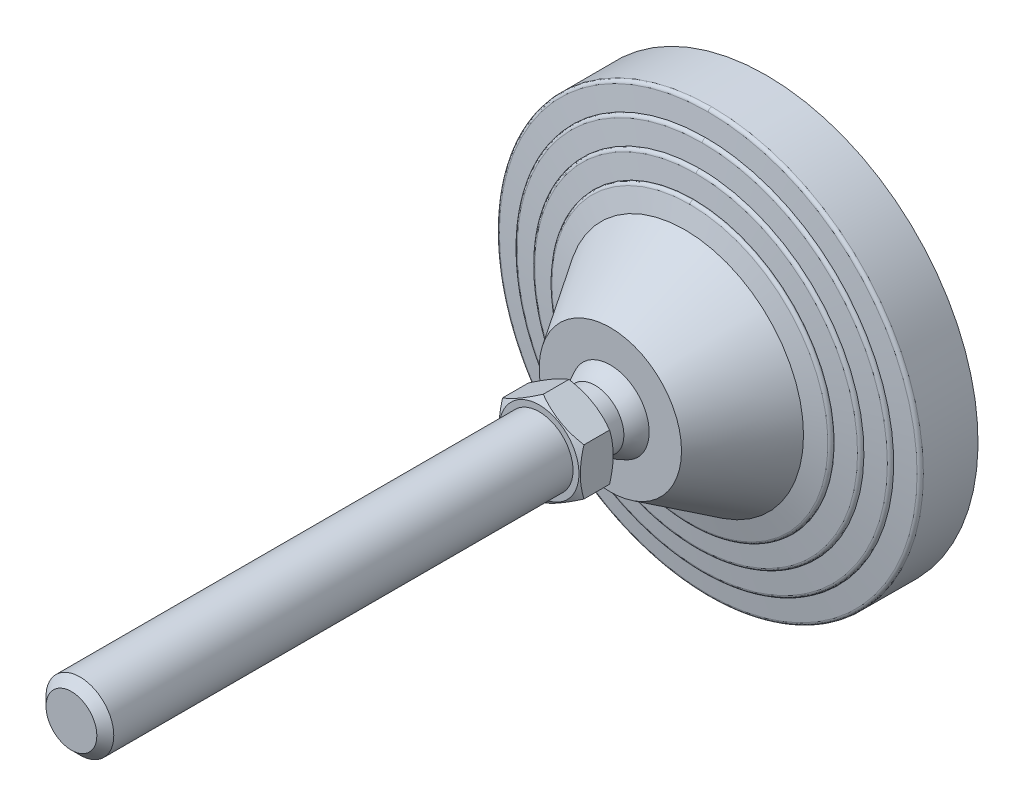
ISO-10303-21;
HEADER;
FILE_DESCRIPTION(('STEP AP214'),'2;1');
FILE_NAME('part.step','',(''),(''),'','','');
FILE_SCHEMA(('AUTOMOTIVE_DESIGN { 1 0 10303 214 1 1 1 1 }'));
ENDSEC;
DATA;
#1=APPLICATION_CONTEXT('core data for automotive mechanical design processes');
#2=APPLICATION_PROTOCOL_DEFINITION('international standard','automotive_design',2000,#1);
#3=PRODUCT_CONTEXT('',#1,'mechanical');
#4=PRODUCT('Part','Part','',(#3));
#5=PRODUCT_RELATED_PRODUCT_CATEGORY('part','',(#4));
#6=PRODUCT_DEFINITION_FORMATION('','',#4);
#7=PRODUCT_DEFINITION_CONTEXT('part definition',#1,'design');
#8=PRODUCT_DEFINITION('design','',#6,#7);
#9=PRODUCT_DEFINITION_SHAPE('','',#8);
#10=(LENGTH_UNIT() NAMED_UNIT(*) SI_UNIT(.MILLI.,.METRE.));
#11=(NAMED_UNIT(*) PLANE_ANGLE_UNIT() SI_UNIT($,.RADIAN.));
#12=(NAMED_UNIT(*) SI_UNIT($,.STERADIAN.) SOLID_ANGLE_UNIT());
#13=UNCERTAINTY_MEASURE_WITH_UNIT(LENGTH_MEASURE(1.E-05),#10,'distance_accuracy_value','');
#14=(GEOMETRIC_REPRESENTATION_CONTEXT(3) GLOBAL_UNCERTAINTY_ASSIGNED_CONTEXT((#13)) GLOBAL_UNIT_ASSIGNED_CONTEXT((#10,
#11,#12)) REPRESENTATION_CONTEXT('',''));
#15=CARTESIAN_POINT('',(0.,0.,0.));
#16=DIRECTION('',(0.,0.,1.));
#17=DIRECTION('',(1.,0.,0.));
#18=AXIS2_PLACEMENT_3D('',#15,#16,#17);
#19=CARTESIAN_POINT('',(-55.851524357,55.66,0.));
#20=DIRECTION('',(0.,0.,1.));
#21=DIRECTION('',(0.,-1.,0.));
#22=AXIS2_PLACEMENT_3D('',#19,#20,#21);
#23=PLANE('',#22);
#24=CARTESIAN_POINT('',(0.,0.,0.));
#25=DIRECTION('',(0.,0.,-1.));
#26=DIRECTION('',(0.,1.,0.));
#27=AXIS2_PLACEMENT_3D('',#24,#25,#26);
#28=CIRCLE('',#27,55.);
#29=CARTESIAN_POINT('',(0.,55.,0.));
#30=VERTEX_POINT('',#29);
#31=EDGE_CURVE('E250',#30,#30,#28,.F.);
#32=ORIENTED_EDGE('',*,*,#31,.F.);
#33=EDGE_LOOP('',(#32));
#34=FACE_BOUND('',#33,.T.);
#35=ADVANCED_FACE('F14',(#34),#23,.F.);
#36=CARTESIAN_POINT('',(0.,0.,3.));
#37=DIRECTION('',(0.,0.,-1.));
#38=DIRECTION('',(0.,1.,0.));
#39=AXIS2_PLACEMENT_3D('',#36,#37,#38);
#40=CYLINDRICAL_SURFACE('',#39,55.);
#41=ORIENTED_EDGE('',*,*,#31,.T.);
#42=EDGE_LOOP('',(#41));
#43=FACE_BOUND('',#42,.T.);
#44=CARTESIAN_POINT('',(0.,0.,3.));
#45=DIRECTION('',(0.,0.,-1.));
#46=DIRECTION('',(0.,1.,0.));
#47=AXIS2_PLACEMENT_3D('',#44,#45,#46);
#48=CIRCLE('',#47,55.);
#49=CARTESIAN_POINT('',(0.,55.,3.));
#50=VERTEX_POINT('',#49);
#51=EDGE_CURVE('E248',#50,#50,#48,.T.);
#52=ORIENTED_EDGE('',*,*,#51,.T.);
#53=EDGE_LOOP('',(#52));
#54=FACE_BOUND('',#53,.T.);
#55=ADVANCED_FACE('F393',(#43,#54),#40,.T.);
#56=CARTESIAN_POINT('',(-63.467641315,63.25,3.));
#57=DIRECTION('',(0.,0.,1.));
#58=DIRECTION('',(0.,-1.,0.));
#59=AXIS2_PLACEMENT_3D('',#56,#57,#58);
#60=PLANE('',#59);
#61=ORIENTED_EDGE('',*,*,#51,.F.);
#62=EDGE_LOOP('',(#61));
#63=FACE_BOUND('',#62,.T.);
#64=CARTESIAN_POINT('',(0.,0.,3.));
#65=DIRECTION('',(0.,0.,-1.));
#66=DIRECTION('',(0.,1.,0.));
#67=AXIS2_PLACEMENT_3D('',#64,#65,#66);
#68=CIRCLE('',#67,62.5);
#69=CARTESIAN_POINT('',(0.,62.5,3.));
#70=VERTEX_POINT('',#69);
#71=EDGE_CURVE('E244',#70,#70,#68,.F.);
#72=ORIENTED_EDGE('',*,*,#71,.F.);
#73=EDGE_LOOP('',(#72));
#74=FACE_BOUND('',#73,.T.);
#75=ADVANCED_FACE('F389',(#63,#74),#60,.F.);
#76=CARTESIAN_POINT('',(0.,0.,19.119206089));
#77=DIRECTION('',(0.,0.,-1.));
#78=DIRECTION('',(0.,1.,0.));
#79=AXIS2_PLACEMENT_3D('',#76,#77,#78);
#80=CYLINDRICAL_SURFACE('',#79,62.5);
#81=ORIENTED_EDGE('',*,*,#71,.T.);
#82=EDGE_LOOP('',(#81));
#83=FACE_BOUND('',#82,.T.);
#84=CARTESIAN_POINT('',(0.,0.,19.119206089));
#85=DIRECTION('',(0.,0.,1.));
#86=DIRECTION('',(0.,-1.,0.));
#87=AXIS2_PLACEMENT_3D('',#84,#85,#86);
#88=CIRCLE('',#87,62.5);
#89=CARTESIAN_POINT('',(-6.4094821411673E-09,-62.5,19.119206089));
#90=VERTEX_POINT('',#89);
#91=CARTESIAN_POINT('',(0.,62.5,19.119206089));
#92=VERTEX_POINT('',#91);
#93=EDGE_CURVE('E531',#90,#92,#88,.T.);
#94=ORIENTED_EDGE('',*,*,#93,.F.);
#95=CARTESIAN_POINT('',(0.,0.,19.119206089));
#96=DIRECTION('',(0.,0.,1.));
#97=DIRECTION('',(0.,-1.,0.));
#98=AXIS2_PLACEMENT_3D('',#95,#96,#97);
#99=CIRCLE('',#98,62.5);
#100=EDGE_CURVE('E247',#92,#90,#99,.T.);
#101=ORIENTED_EDGE('',*,*,#100,.F.);
#102=EDGE_LOOP('',(#94,#101));
#103=FACE_BOUND('',#102,.T.);
#104=ADVANCED_FACE('F392',(#83,#103),#80,.T.);
#105=CARTESIAN_POINT('',(0.,-62.5,19.119206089));
#106=CARTESIAN_POINT('',(-125.,-62.5,19.119206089));
#107=CARTESIAN_POINT('',(-125.,62.5,19.119206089));
#108=CARTESIAN_POINT('',(0.,62.5,19.119206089));
#109=CARTESIAN_POINT('',(0.,-62.5,19.647800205));
#110=CARTESIAN_POINT('',(-125.,-62.5,19.647800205));
#111=CARTESIAN_POINT('',(-125.,62.5,19.647800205));
#112=CARTESIAN_POINT('',(0.,62.5,19.647800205));
#113=CARTESIAN_POINT('',(0.,-62.150618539,20.044466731));
#114=CARTESIAN_POINT('',(-124.301237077,-62.150618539,20.044466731));
#115=CARTESIAN_POINT('',(-124.301237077,62.150618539,20.044466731));
#116=CARTESIAN_POINT('',(0.,62.150618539,20.044466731));
#117=CARTESIAN_POINT('',(0.,-61.62625428,20.111204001));
#118=CARTESIAN_POINT('',(-123.252508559,-61.6262542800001,20.111204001));
#119=CARTESIAN_POINT('',(-123.252508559,61.6262542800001,20.111204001));
#120=CARTESIAN_POINT('',(0.,61.62625428,20.111204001));
#121=(BOUNDED_SURFACE() B_SPLINE_SURFACE(3,3,((#105,#106,#107,#108),(#109,#110,#111,#112),(#113,
#114,#115,#116),(#117,#118,#119,#120)),.UNSPECIFIED.,.F.,.F.,
.F.) B_SPLINE_SURFACE_WITH_KNOTS((4,4),(4,4),(0.,1.),(0.,1.),
.UNSPECIFIED.) GEOMETRIC_REPRESENTATION_ITEM() RATIONAL_B_SPLINE_SURFACE(((1.,0.333333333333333,
0.333333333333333,1.),(0.833611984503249,0.277870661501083,0.277870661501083,0.833611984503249),
(0.833611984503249,0.277870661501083,0.277870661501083,0.833611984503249),(1.,0.333333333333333,
0.333333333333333,1.))) REPRESENTATION_ITEM('') SURFACE());
#122=CARTESIAN_POINT('',(0.,62.5,19.119206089));
#123=CARTESIAN_POINT('',(0.,62.5,19.647800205));
#124=CARTESIAN_POINT('',(0.,62.150618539,20.044466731));
#125=CARTESIAN_POINT('',(0.,61.62625428,20.111204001));
#126=(BOUNDED_CURVE() B_SPLINE_CURVE(3,(#122,#123,#124,#125),.UNSPECIFIED.,.F.,
.F.) B_SPLINE_CURVE_WITH_KNOTS((4,4),(0.,1.),
.UNSPECIFIED.) CURVE() GEOMETRIC_REPRESENTATION_ITEM() RATIONAL_B_SPLINE_CURVE((1.,
0.833611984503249,0.833611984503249,1.)) REPRESENTATION_ITEM(''));
#127=CARTESIAN_POINT('',(0.,61.6262542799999,20.1112040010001));
#128=VERTEX_POINT('',#127);
#129=EDGE_CURVE('E522',#92,#128,#126,.T.);
#130=CARTESIAN_POINT('',(0.,-62.5,19.119206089));
#131=CARTESIAN_POINT('',(0.,-62.5,19.647800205));
#132=CARTESIAN_POINT('',(0.,-62.150618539,20.044466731));
#133=CARTESIAN_POINT('',(0.,-61.62625428,20.111204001));
#134=(BOUNDED_CURVE() B_SPLINE_CURVE(3,(#130,#131,#132,#133),.UNSPECIFIED.,.F.,
.F.) B_SPLINE_CURVE_WITH_KNOTS((4,4),(0.,1.),
.UNSPECIFIED.) CURVE() GEOMETRIC_REPRESENTATION_ITEM() RATIONAL_B_SPLINE_CURVE((1.,
0.833611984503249,0.833611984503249,1.)) REPRESENTATION_ITEM(''));
#135=CARTESIAN_POINT('',(-1.89596340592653E-08,-61.6262542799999,20.1112040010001));
#136=VERTEX_POINT('',#135);
#137=EDGE_CURVE('E536',#136,#90,#134,.F.);
#138=CARTESIAN_POINT('',(0.,0.,20.1112040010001));
#139=DIRECTION('',(0.,0.,-1.));
#140=DIRECTION('',(0.,1.,0.));
#141=AXIS2_PLACEMENT_3D('',#138,#139,#140);
#142=CIRCLE('',#141,61.62625428);
#143=EDGE_CURVE('E515',#128,#136,#142,.F.);
#144=ORIENTED_EDGE('',*,*,#129,.F.);
#145=ORIENTED_EDGE('',*,*,#100,.T.);
#146=ORIENTED_EDGE('',*,*,#137,.F.);
#147=ORIENTED_EDGE('',*,*,#143,.F.);
#148=EDGE_LOOP('',(#144,#145,#146,#147));
#149=FACE_BOUND('',#148,.T.);
#150=ADVANCED_FACE('F716',(#149),#121,.T.);
#151=CARTESIAN_POINT('',(0.,62.5,19.119206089));
#152=CARTESIAN_POINT('',(125.,62.5,19.119206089));
#153=CARTESIAN_POINT('',(125.,-62.5,19.119206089));
#154=CARTESIAN_POINT('',(0.,-62.5,19.119206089));
#155=CARTESIAN_POINT('',(0.,62.5,19.647800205));
#156=CARTESIAN_POINT('',(125.,62.5,19.647800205));
#157=CARTESIAN_POINT('',(125.,-62.5,19.647800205));
#158=CARTESIAN_POINT('',(0.,-62.5,19.647800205));
#159=CARTESIAN_POINT('',(0.,62.150618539,20.044466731));
#160=CARTESIAN_POINT('',(124.301237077,62.150618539,20.044466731));
#161=CARTESIAN_POINT('',(124.301237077,-62.150618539,20.044466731));
#162=CARTESIAN_POINT('',(0.,-62.150618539,20.044466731));
#163=CARTESIAN_POINT('',(0.,61.62625428,20.111204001));
#164=CARTESIAN_POINT('',(123.252508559,61.6262542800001,20.111204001));
#165=CARTESIAN_POINT('',(123.252508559,-61.6262542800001,20.111204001));
#166=CARTESIAN_POINT('',(0.,-61.62625428,20.111204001));
#167=(BOUNDED_SURFACE() B_SPLINE_SURFACE(3,3,((#151,#152,#153,#154),(#155,#156,#157,#158),(#159,
#160,#161,#162),(#163,#164,#165,#166)),.UNSPECIFIED.,.F.,.F.,
.F.) B_SPLINE_SURFACE_WITH_KNOTS((4,4),(4,4),(0.,1.),(0.,1.),
.UNSPECIFIED.) GEOMETRIC_REPRESENTATION_ITEM() RATIONAL_B_SPLINE_SURFACE(((1.,0.333333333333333,
0.333333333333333,1.),(0.833611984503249,0.277870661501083,0.277870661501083,0.833611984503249),
(0.833611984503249,0.277870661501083,0.277870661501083,0.833611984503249),(1.,0.333333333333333,
0.333333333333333,1.))) REPRESENTATION_ITEM('') SURFACE());
#168=CARTESIAN_POINT('',(0.,0.,20.1112040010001));
#169=DIRECTION('',(0.,0.,-1.));
#170=DIRECTION('',(0.,1.,0.));
#171=AXIS2_PLACEMENT_3D('',#168,#169,#170);
#172=CIRCLE('',#171,61.62625428);
#173=EDGE_CURVE('E521',#136,#128,#172,.F.);
#174=ORIENTED_EDGE('',*,*,#93,.T.);
#175=ORIENTED_EDGE('',*,*,#129,.T.);
#176=ORIENTED_EDGE('',*,*,#173,.F.);
#177=ORIENTED_EDGE('',*,*,#137,.T.);
#178=EDGE_LOOP('',(#174,#175,#176,#177));
#179=FACE_BOUND('',#178,.T.);
#180=ADVANCED_FACE('F229',(#179),#167,.T.);
#181=CARTESIAN_POINT('',(0.,0.,20.890909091));
#182=DIRECTION('',(0.,0.,-1.));
#183=DIRECTION('',(1.,0.,0.));
#184=AXIS2_PLACEMENT_3D('',#181,#182,#183);
#185=CONICAL_SURFACE('',#184,55.5,1.44420419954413);
#186=ORIENTED_EDGE('',*,*,#143,.T.);
#187=ORIENTED_EDGE('',*,*,#173,.T.);
#188=EDGE_LOOP('',(#186,#187));
#189=FACE_BOUND('',#188,.T.);
#190=CARTESIAN_POINT('',(-1.13830957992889E-08,-55.5,20.890909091));
#191=CARTESIAN_POINT('',(0.666810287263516,-55.5000058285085,20.890909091));
#192=CARTESIAN_POINT('',(1.33362158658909,-55.4879831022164,20.890909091));
#193=CARTESIAN_POINT('',(2.66828219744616,-55.4398527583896,20.890909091));
#194=CARTESIAN_POINT('',(3.33612903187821,-55.4036764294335,20.890909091));
#195=CARTESIAN_POINT('',(4.67008368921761,-55.3072108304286,20.890909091));
#196=CARTESIAN_POINT('',(5.33619149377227,-55.2469213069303,20.890909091));
#197=CARTESIAN_POINT('',(6.66630694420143,-55.1022519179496,20.890909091));
#198=CARTESIAN_POINT('',(7.33031261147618,-55.0178537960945,20.890909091));
#199=CARTESIAN_POINT('',(8.65488946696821,-54.825094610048,20.890909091));
#200=CARTESIAN_POINT('',(9.31546019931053,-54.7167304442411,20.890909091));
#201=CARTESIAN_POINT('',(11.3032442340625,-54.3535835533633,20.890909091));
#202=CARTESIAN_POINT('',(12.6239565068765,-54.062110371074,20.890909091));
#203=CARTESIAN_POINT('',(15.2407929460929,-53.3834839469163,20.890909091));
#204=CARTESIAN_POINT('',(16.536910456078,-52.9963051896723,20.890909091));
#205=CARTESIAN_POINT('',(19.0989356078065,-52.127842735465,20.890909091));
#206=CARTESIAN_POINT('',(20.3648068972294,-51.6464516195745,20.890909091));
#207=CARTESIAN_POINT('',(22.8579438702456,-50.5924539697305,20.890909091));
#208=CARTESIAN_POINT('',(24.0852091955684,-50.0198465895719,20.890909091));
#209=CARTESIAN_POINT('',(26.6786676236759,-48.6922162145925,20.890909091));
#210=CARTESIAN_POINT('',(28.0374663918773,-47.9226902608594,20.890909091));
#211=CARTESIAN_POINT('',(30.6855194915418,-46.2718474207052,20.890909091));
#212=CARTESIAN_POINT('',(31.974765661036,-45.3905174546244,20.890909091));
#213=CARTESIAN_POINT('',(34.4745529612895,-43.5222940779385,20.890909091));
#214=CARTESIAN_POINT('',(35.6850872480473,-42.5353915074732,20.890909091));
#215=CARTESIAN_POINT('',(38.0186685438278,-40.4631409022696,20.890909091));
#216=CARTESIAN_POINT('',(39.1417181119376,-39.3777957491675,20.890909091));
#217=CARTESIAN_POINT('',(41.2923479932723,-37.1163936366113,20.890909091));
#218=CARTESIAN_POINT('',(42.3199319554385,-35.9403401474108,20.890909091));
#219=CARTESIAN_POINT('',(44.2723789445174,-33.5058382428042,20.890909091));
#220=CARTESIAN_POINT('',(45.1972412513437,-32.2473892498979,20.890909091));
#221=CARTESIAN_POINT('',(46.9376312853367,-29.6570957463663,20.890909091));
#222=CARTESIAN_POINT('',(47.7531628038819,-28.3252537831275,20.890909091));
#223=CARTESIAN_POINT('',(49.2691299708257,-25.5976050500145,20.890909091));
#224=CARTESIAN_POINT('',(49.9695658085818,-24.201798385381,20.890909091));
#225=CARTESIAN_POINT('',(51.2503706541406,-21.3561258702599,20.890909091));
#226=CARTESIAN_POINT('',(51.8307383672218,-19.9062594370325,20.890909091));
#227=CARTESIAN_POINT('',(52.8672716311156,-16.9627885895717,20.890909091));
#228=CARTESIAN_POINT('',(53.3234371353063,-15.4691841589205,20.890909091));
#229=CARTESIAN_POINT('',(54.1083272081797,-12.4488388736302,20.890909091));
#230=CARTESIAN_POINT('',(54.4370503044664,-10.9220976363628,20.890909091));
#231=CARTESIAN_POINT('',(54.964711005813,-7.84634988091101,20.890909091));
#232=CARTESIAN_POINT('',(55.1636486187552,-6.29734336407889,20.890909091));
#233=CARTESIAN_POINT('',(55.4303245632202,-3.18807153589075,20.890909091));
#234=CARTESIAN_POINT('',(55.4980623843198,-1.62780618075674,20.890909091));
#235=CARTESIAN_POINT('',(55.5018556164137,1.49288460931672,20.890909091));
#236=CARTESIAN_POINT('',(55.4379110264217,3.05331004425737,20.890909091));
#237=CARTESIAN_POINT('',(55.1787965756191,6.16319684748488,20.890909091));
#238=CARTESIAN_POINT('',(54.9836292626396,7.71265842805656,20.890909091));
#239=CARTESIAN_POINT('',(54.463459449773,10.7896325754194,20.890909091));
#240=CARTESIAN_POINT('',(54.1384569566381,12.3171451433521,20.890909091));
#241=CARTESIAN_POINT('',(53.3609336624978,15.3393372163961,20.890909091));
#242=CARTESIAN_POINT('',(52.9084149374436,16.8340172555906,20.890909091));
#243=CARTESIAN_POINT('',(51.8790738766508,19.7799443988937,20.890909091));
#244=CARTESIAN_POINT('',(51.3022515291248,21.2311914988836,20.890909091));
#245=CARTESIAN_POINT('',(50.0283709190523,24.0800097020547,20.890909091));
#246=CARTESIAN_POINT('',(49.3313064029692,25.4775780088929,20.890909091));
#247=CARTESIAN_POINT('',(47.8219174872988,28.2090226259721,20.890909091));
#248=CARTESIAN_POINT('',(47.009593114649,29.5428989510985,20.890909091));
#249=CARTESIAN_POINT('',(45.275439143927,32.137509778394,20.890909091));
#250=CARTESIAN_POINT('',(44.3536065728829,33.3982422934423,20.890909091));
#251=CARTESIAN_POINT('',(42.4069961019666,35.8375708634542,20.890909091));
#252=CARTESIAN_POINT('',(41.3822180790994,37.0161668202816,20.890909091));
#253=CARTESIAN_POINT('',(39.2371577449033,39.28269451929,20.890909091));
#254=CARTESIAN_POINT('',(38.11688550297,40.3706357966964,20.890909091));
#255=CARTESIAN_POINT('',(35.7885615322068,42.4483529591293,20.890909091));
#256=CARTESIAN_POINT('',(34.580510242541,43.4381293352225,20.890909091));
#257=CARTESIAN_POINT('',(32.5014047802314,44.999906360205,20.890909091));
#258=CARTESIAN_POINT('',(31.6521856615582,45.6012216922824,20.890909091));
#259=CARTESIAN_POINT('',(29.9212415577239,46.7552239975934,20.890909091));
#260=CARTESIAN_POINT('',(29.0395163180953,47.3079105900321,20.890909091));
#261=CARTESIAN_POINT('',(27.2463975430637,48.3628576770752,20.890909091));
#262=CARTESIAN_POINT('',(26.3350034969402,48.8651173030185,20.890909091));
#263=CARTESIAN_POINT('',(24.4853750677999,49.8176528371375,20.890909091));
#264=CARTESIAN_POINT('',(23.5471392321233,50.2679259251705,20.890909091));
#265=CARTESIAN_POINT('',(21.6468644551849,51.1150215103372,20.890909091));
#266=CARTESIAN_POINT('',(20.6848259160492,51.5118449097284,20.890909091));
#267=CARTESIAN_POINT('',(18.7400290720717,52.2507726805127,20.890909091));
#268=CARTESIAN_POINT('',(17.7572723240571,52.5928811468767,20.890909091));
#269=CARTESIAN_POINT('',(15.8636176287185,53.1929617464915,20.890909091));
#270=CARTESIAN_POINT('',(14.9542390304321,53.4557406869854,20.890909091));
#271=CARTESIAN_POINT('',(13.1232854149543,53.9344479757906,20.890909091));
#272=CARTESIAN_POINT('',(12.2017111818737,54.1503793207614,20.890909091));
#273=CARTESIAN_POINT('',(10.3487557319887,54.5348378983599,20.890909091));
#274=CARTESIAN_POINT('',(9.41737477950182,54.7033664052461,20.890909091));
#275=CARTESIAN_POINT('',(7.54728204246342,54.9925789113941,20.890909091));
#276=CARTESIAN_POINT('',(6.60857079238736,55.1132663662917,20.890909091));
#277=CARTESIAN_POINT('',(4.72616569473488,55.3064952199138,20.890909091));
#278=CARTESIAN_POINT('',(3.78247163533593,55.3790345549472,20.890909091));
#279=CARTESIAN_POINT('',(1.8925192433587,55.4758006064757,20.890909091));
#280=CARTESIAN_POINT('',(0.946260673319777,55.5000226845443,20.890909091));
#281=CARTESIAN_POINT('',(-1.66116564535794E-09,55.5,20.890909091));
#282=B_SPLINE_CURVE_WITH_KNOTS('',3,(#190,#191,#192,#193,#194,#195,#196,#197,#198,#199,#200,
#201,#202,#203,#204,#205,#206,#207,#208,#209,#210,#211,#212,#213,#214,#215,#216,#217,#218,#219,
#220,#221,#222,#223,#224,#225,#226,#227,#228,#229,#230,#231,#232,#233,#234,#235,#236,#237,#238,
#239,#240,#241,#242,#243,#244,#245,#246,#247,#248,#249,#250,#251,#252,#253,#254,#255,#256,#257,
#258,#259,#260,#261,#262,#263,#264,#265,#266,#267,#268,#269,#270,#271,#272,#273,#274,#275,#276,
#277,#278,#279,#280,#281),.UNSPECIFIED.,.F.,.F.,(4,2,2,2,2,2,2,2,2,2,2,2,2,2,2,2,2,2,2,2,2,2,2,
2,2,2,2,2,2,2,2,2,2,2,2,2,2,2,2,2,2,2,2,2,2,4),(0.,2.00032482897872,4.00636450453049,
6.01242526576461,8.02000917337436,10.0278530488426,14.081391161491,18.1360111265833,
22.1952813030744,26.2545891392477,30.9336173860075,35.6131935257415,40.2931760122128,
44.9730215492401,49.6526881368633,54.332387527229,59.0119245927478,63.6914539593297,
68.3710337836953,73.0506153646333,77.7302510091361,82.4098863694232,87.0895399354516,
91.7691935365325,96.4487562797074,101.128318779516,105.807805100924,110.487291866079,
115.167022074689,119.846751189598,124.526607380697,129.206469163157,133.885838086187,
138.565183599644,141.685351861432,144.805544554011,147.9257909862,151.046206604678,
154.166569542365,157.286698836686,160.125236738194,162.963593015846,165.801872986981,
168.63994790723,171.478144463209,174.316613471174),.UNSPECIFIED.);
#283=CARTESIAN_POINT('',(-1.1383239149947E-08,-55.5,20.895966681));
#284=VERTEX_POINT('',#283);
#285=CARTESIAN_POINT('',(-1.66118325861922E-09,55.5,20.895966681));
#286=VERTEX_POINT('',#285);
#287=EDGE_CURVE('E210',#284,#286,#282,.T.);
#288=ORIENTED_EDGE('',*,*,#287,.F.);
#289=CARTESIAN_POINT('',(-1.66117986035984E-09,55.5,20.890909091));
#290=CARTESIAN_POINT('',(-0.666810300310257,55.5000058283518,20.890909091));
#291=CARTESIAN_POINT('',(-1.33362159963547,55.4879831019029,20.890909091));
#292=CARTESIAN_POINT('',(-2.66828221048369,55.4398527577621,20.890909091));
#293=CARTESIAN_POINT('',(-3.33612904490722,55.403676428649,20.890909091));
#294=CARTESIAN_POINT('',(-4.67008370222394,55.3072108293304,20.890909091));
#295=CARTESIAN_POINT('',(-5.33619150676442,55.2469213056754,20.890909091));
#296=CARTESIAN_POINT('',(-6.66630695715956,55.1022519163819,20.890909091));
#297=CARTESIAN_POINT('',(-7.33031262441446,55.0178537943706,20.890909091));
#298=CARTESIAN_POINT('',(-8.65488947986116,54.8250946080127,20.890909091));
#299=CARTESIAN_POINT('',(-9.315460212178,54.7167304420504,20.890909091));
#300=CARTESIAN_POINT('',(-11.3032442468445,54.3535835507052,20.890909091));
#301=CARTESIAN_POINT('',(-12.62395651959,54.0621103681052,20.890909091));
#302=CARTESIAN_POINT('',(-15.2407929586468,53.3834839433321,20.890909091));
#303=CARTESIAN_POINT('',(-16.5369104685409,52.9963051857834,20.890909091));
#304=CARTESIAN_POINT('',(-19.0989356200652,52.1278427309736,20.890909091));
#305=CARTESIAN_POINT('',(-20.3648069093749,51.6464516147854,20.890909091));
#306=CARTESIAN_POINT('',(-22.8579438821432,50.5924539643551,20.890909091));
#307=CARTESIAN_POINT('',(-24.0852092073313,50.0198465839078,20.890909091));
#308=CARTESIAN_POINT('',(-26.6786676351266,48.6922162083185,20.890909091));
#309=CARTESIAN_POINT('',(-28.037466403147,47.9226902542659,20.890909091));
#310=CARTESIAN_POINT('',(-30.6855195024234,46.271847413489,20.890909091));
#311=CARTESIAN_POINT('',(-31.9747656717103,45.390517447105,20.890909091));
#312=CARTESIAN_POINT('',(-34.4745529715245,43.5222940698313,20.890909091));
#313=CARTESIAN_POINT('',(-35.6850872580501,42.5353914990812,20.890909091));
#314=CARTESIAN_POINT('',(-38.0186685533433,40.4631408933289,20.890909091));
#315=CARTESIAN_POINT('',(-39.1417181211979,39.3777957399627,20.890909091));
#316=CARTESIAN_POINT('',(-41.2923480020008,37.1163936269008,20.890909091));
#317=CARTESIAN_POINT('',(-42.3199319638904,35.9403401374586,20.890909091));
#318=CARTESIAN_POINT('',(-44.2723789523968,33.5058382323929,20.890909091));
#319=CARTESIAN_POINT('',(-45.1972412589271,32.247389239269,20.890909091));
#320=CARTESIAN_POINT('',(-46.937631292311,29.6570957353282,20.890909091));
#321=CARTESIAN_POINT('',(-47.753162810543,28.3252537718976,20.890909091));
#322=CARTESIAN_POINT('',(-49.2691299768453,25.597605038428,20.890909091));
#323=CARTESIAN_POINT('',(-49.9695658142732,24.2017983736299,20.890909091));
#324=CARTESIAN_POINT('',(-51.2503706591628,21.3561258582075,20.890909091));
#325=CARTESIAN_POINT('',(-51.8307383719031,19.9062594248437,20.890909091));
#326=CARTESIAN_POINT('',(-52.8672716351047,16.9627885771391,20.890909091));
#327=CARTESIAN_POINT('',(-53.3234371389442,15.4691841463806,20.890909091));
#328=CARTESIAN_POINT('',(-54.1083272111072,12.4488388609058,20.890909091));
#329=CARTESIAN_POINT('',(-54.437050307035,10.9220976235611,20.890909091));
#330=CARTESIAN_POINT('',(-54.9647110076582,7.84634986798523,20.890909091));
#331=CARTESIAN_POINT('',(-55.1636486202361,6.29734335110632,20.890909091));
#332=CARTESIAN_POINT('',(-55.4303245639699,3.1880715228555,20.890909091));
#333=CARTESIAN_POINT('',(-55.4980623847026,1.62780616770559,20.890909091));
#334=CARTESIAN_POINT('',(-55.5018556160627,-1.4928846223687,20.890909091));
#335=CARTESIAN_POINT('',(-55.4379110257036,-3.05331005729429,20.890909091));
#336=CARTESIAN_POINT('',(-55.1787965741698,-6.16319686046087,20.890909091));
#337=CARTESIAN_POINT('',(-54.9836292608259,-7.71265844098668,20.890909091));
#338=CARTESIAN_POINT('',(-54.4634594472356,-10.7896325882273,20.890909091));
#339=CARTESIAN_POINT('',(-54.1384569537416,-12.3171451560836,20.890909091));
#340=CARTESIAN_POINT('',(-53.3609336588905,-15.3393372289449,20.890909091));
#341=CARTESIAN_POINT('',(-52.9084149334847,-16.8340172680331,20.890909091));
#342=CARTESIAN_POINT('',(-51.8790738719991,-19.7799444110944,20.890909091));
#343=CARTESIAN_POINT('',(-51.3022515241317,-21.2311915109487,20.890909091));
#344=CARTESIAN_POINT('',(-50.0283709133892,-24.0800097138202,20.890909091));
#345=CARTESIAN_POINT('',(-49.3313063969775,-25.4775780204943,20.890909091));
#346=CARTESIAN_POINT('',(-47.8219174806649,-28.2090226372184,20.890909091));
#347=CARTESIAN_POINT('',(-47.0095931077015,-29.5428989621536,20.890909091));
#348=CARTESIAN_POINT('',(-45.2754391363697,-32.1375097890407,20.890909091));
#349=CARTESIAN_POINT('',(-44.3536065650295,-33.3982423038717,20.890909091));
#350=CARTESIAN_POINT('',(-42.4069960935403,-35.837570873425,20.890909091));
#351=CARTESIAN_POINT('',(-41.3822180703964,-37.0161668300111,20.890909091));
#352=CARTESIAN_POINT('',(-39.2371577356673,-39.2826945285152,20.890909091));
#353=CARTESIAN_POINT('',(-38.1168854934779,-40.3706358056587,20.890909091));
#354=CARTESIAN_POINT('',(-35.7885615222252,-42.4483529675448,20.890909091));
#355=CARTESIAN_POINT('',(-34.5805102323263,-43.4381293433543,20.890909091));
#356=CARTESIAN_POINT('',(-32.5014047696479,-44.9999063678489,20.890909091));
#357=CARTESIAN_POINT('',(-31.6521856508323,-45.6012216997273,20.890909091));
#358=CARTESIAN_POINT('',(-29.9212415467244,-46.7552240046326,20.890909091));
#359=CARTESIAN_POINT('',(-29.0395163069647,-47.3079105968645,20.890909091));
#360=CARTESIAN_POINT('',(-27.2463975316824,-48.3628576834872,20.890909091));
#361=CARTESIAN_POINT('',(-26.3350034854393,-48.8651173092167,20.890909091));
#362=CARTESIAN_POINT('',(-24.4853750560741,-49.8176528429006,20.890909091));
#363=CARTESIAN_POINT('',(-23.5471392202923,-50.2679259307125,20.890909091));
#364=CARTESIAN_POINT('',(-21.6468644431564,-51.1150215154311,20.890909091));
#365=CARTESIAN_POINT('',(-20.6848259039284,-51.5118449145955,20.890909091));
#366=CARTESIAN_POINT('',(-18.74002905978,-52.2507726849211,20.890909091));
#367=CARTESIAN_POINT('',(-17.7572723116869,-52.5928811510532,20.890909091));
#368=CARTESIAN_POINT('',(-15.8636176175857,-53.192961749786,20.890909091));
#369=CARTESIAN_POINT('',(-14.9542390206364,-53.4557406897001,20.890909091));
#370=CARTESIAN_POINT('',(-13.1232854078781,-53.934447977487,20.890909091));
#371=CARTESIAN_POINT('',(-12.20171117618,-54.1503793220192,20.890909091));
#372=CARTESIAN_POINT('',(-10.3487557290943,-54.5348378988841,20.890909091));
#373=CARTESIAN_POINT('',(-9.41737477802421,-54.7033664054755,20.890909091));
#374=CARTESIAN_POINT('',(-7.54728204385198,-54.9925789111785,20.890909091));
#375=CARTESIAN_POINT('',(-6.60857079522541,-55.1132663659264,20.890909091));
#376=CARTESIAN_POINT('',(-4.72616570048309,-55.3064952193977,20.890909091));
#377=CARTESIAN_POINT('',(-3.7824716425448,-55.37903455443,20.890909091));
#378=CARTESIAN_POINT('',(-1.89251925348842,-55.4758006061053,20.890909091));
#379=CARTESIAN_POINT('',(-0.946260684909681,-55.5000226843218,20.890909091));
#380=CARTESIAN_POINT('',(-1.13832350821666E-08,-55.5,20.890909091));
#381=B_SPLINE_CURVE_WITH_KNOTS('',3,(#289,#290,#291,#292,#293,#294,#295,#296,#297,#298,#299,
#300,#301,#302,#303,#304,#305,#306,#307,#308,#309,#310,#311,#312,#313,#314,#315,#316,#317,#318,
#319,#320,#321,#322,#323,#324,#325,#326,#327,#328,#329,#330,#331,#332,#333,#334,#335,#336,#337,
#338,#339,#340,#341,#342,#343,#344,#345,#346,#347,#348,#349,#350,#351,#352,#353,#354,#355,#356,
#357,#358,#359,#360,#361,#362,#363,#364,#365,#366,#367,#368,#369,#370,#371,#372,#373,#374,#375,
#376,#377,#378,#379,#380),.UNSPECIFIED.,.F.,.F.,(4,2,2,2,2,2,2,2,2,2,2,2,2,2,2,2,2,2,2,2,2,2,2,
2,2,2,2,2,2,2,2,2,2,2,2,2,2,2,2,2,2,2,2,2,2,4),(0.,2.00032482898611,4.00636450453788,
6.01242526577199,8.02000917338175,10.02785304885,14.0813911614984,18.1360111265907,
22.1952813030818,26.2545891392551,30.933617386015,35.6131935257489,40.2931760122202,
44.9730215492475,49.6526881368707,54.3323875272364,59.0119245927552,63.6914539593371,
68.3710337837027,73.0506153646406,77.7302510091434,82.4098863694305,87.0895399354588,
91.7691935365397,96.4487562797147,101.128318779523,105.807805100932,110.487291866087,
115.167022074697,119.846751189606,124.526607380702,129.206469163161,133.885838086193,
138.565183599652,141.685351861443,144.805544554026,147.92579098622,151.046206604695,
154.166569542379,157.286698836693,160.125236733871,162.96359300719,165.801872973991,
168.639947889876,171.478144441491,174.316613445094),.UNSPECIFIED.);
#382=EDGE_CURVE('E222',#286,#284,#381,.T.);
#383=ORIENTED_EDGE('',*,*,#382,.F.);
#384=EDGE_LOOP('',(#288,#383));
#385=FACE_BOUND('',#384,.T.);
#386=ADVANCED_FACE('F224',(#189,#385),#185,.T.);
#387=CARTESIAN_POINT('',(0.,-55.5,20.887804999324));
#388=CARTESIAN_POINT('',(-111.,-55.5000000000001,20.887804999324));
#389=CARTESIAN_POINT('',(-111.,55.5000000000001,20.887804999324));
#390=CARTESIAN_POINT('',(0.,55.5,20.887804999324));
#391=CARTESIAN_POINT('',(0.,-55.5,20.892211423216));
#392=CARTESIAN_POINT('',(-111.,-55.5000000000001,20.892211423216));
#393=CARTESIAN_POINT('',(-111.,55.5000000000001,20.892211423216));
#394=CARTESIAN_POINT('',(0.,55.5,20.892211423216));
#395=CARTESIAN_POINT('',(0.,-55.5,20.896617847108));
#396=CARTESIAN_POINT('',(-111.,-55.5000000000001,20.896617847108));
#397=CARTESIAN_POINT('',(-111.,55.5000000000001,20.896617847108));
#398=CARTESIAN_POINT('',(0.,55.5,20.896617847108));
#399=CARTESIAN_POINT('',(0.,-55.5,20.901024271));
#400=CARTESIAN_POINT('',(-111.,-55.5000000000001,20.901024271));
#401=CARTESIAN_POINT('',(-111.,55.5000000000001,20.901024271));
#402=CARTESIAN_POINT('',(0.,55.5,20.901024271));
#403=CARTESIAN_POINT('',(0.,-55.5,21.429618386));
#404=CARTESIAN_POINT('',(-111.,-55.5,21.429618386));
#405=CARTESIAN_POINT('',(-111.,55.5,21.429618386));
#406=CARTESIAN_POINT('',(0.,55.5,21.429618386));
#407=CARTESIAN_POINT('',(0.,-55.150618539,21.826284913));
#408=CARTESIAN_POINT('',(-110.301237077,-55.1506185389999,21.826284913));
#409=CARTESIAN_POINT('',(-110.301237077,55.1506185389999,21.826284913));
#410=CARTESIAN_POINT('',(0.,55.150618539,21.826284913));
#411=CARTESIAN_POINT('',(0.,-54.62625428,21.893022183));
#412=CARTESIAN_POINT('',(-109.252508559,-54.62625428,21.893022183));
#413=CARTESIAN_POINT('',(-109.252508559,54.62625428,21.893022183));
#414=CARTESIAN_POINT('',(0.,54.62625428,21.893022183));
#415=(BOUNDED_SURFACE() B_SPLINE_SURFACE(3,3,((#387,#388,#389,#390),(#391,#392,#393,#394),(#395,
#396,#397,#398),(#399,#400,#401,#402),(#403,#404,#405,#406),(#407,#408,#409,#410),(#411,#412,
#413,#414)),.UNSPECIFIED.,.F.,.F.,.F.) B_SPLINE_SURFACE_WITH_KNOTS((4,3,4),(4,4),(-0.01,0.,1.),
(0.,1.),.UNSPECIFIED.) GEOMETRIC_REPRESENTATION_ITEM() RATIONAL_B_SPLINE_SURFACE(((1.,
0.333333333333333,0.333333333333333,1.),(1.,0.333333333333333,0.333333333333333,1.),(1.,
0.333333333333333,0.333333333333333,1.),(1.,0.333333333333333,0.333333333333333,1.),
(0.833611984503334,0.277870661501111,0.277870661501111,0.833611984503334),(0.833611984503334,
0.277870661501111,0.277870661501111,0.833611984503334),(1.,0.333333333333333,0.333333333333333,1.))) REPRESENTATION_ITEM('') SURFACE());
#416=CARTESIAN_POINT('',(0.,55.5,20.901024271));
#417=CARTESIAN_POINT('',(0.,55.5,21.429618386));
#418=CARTESIAN_POINT('',(0.,55.150618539,21.826284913));
#419=CARTESIAN_POINT('',(0.,54.62625428,21.893022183));
#420=(BOUNDED_CURVE() B_SPLINE_CURVE(3,(#416,#417,#418,#419),.UNSPECIFIED.,.F.,
.F.) B_SPLINE_CURVE_WITH_KNOTS((4,4),(0.,1.),
.UNSPECIFIED.) CURVE() GEOMETRIC_REPRESENTATION_ITEM() RATIONAL_B_SPLINE_CURVE((1.,
0.833611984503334,0.833611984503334,1.)) REPRESENTATION_ITEM(''));
#421=CARTESIAN_POINT('',(0.,54.6262542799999,21.893022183));
#422=VERTEX_POINT('',#421);
#423=EDGE_CURVE('E213',#286,#422,#420,.T.);
#424=CARTESIAN_POINT('',(0.,-55.5,20.901024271));
#425=CARTESIAN_POINT('',(0.,-55.5,21.429618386));
#426=CARTESIAN_POINT('',(0.,-55.150618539,21.826284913));
#427=CARTESIAN_POINT('',(0.,-54.62625428,21.893022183));
#428=(BOUNDED_CURVE() B_SPLINE_CURVE(3,(#424,#425,#426,#427),.UNSPECIFIED.,.F.,
.F.) B_SPLINE_CURVE_WITH_KNOTS((4,4),(0.,1.),
.UNSPECIFIED.) CURVE() GEOMETRIC_REPRESENTATION_ITEM() RATIONAL_B_SPLINE_CURVE((1.,
0.833611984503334,0.833611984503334,1.)) REPRESENTATION_ITEM(''));
#429=CARTESIAN_POINT('',(-1.68060480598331E-08,-54.6262542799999,21.893022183));
#430=VERTEX_POINT('',#429);
#431=EDGE_CURVE('E214',#430,#284,#428,.F.);
#432=CARTESIAN_POINT('',(0.,0.,21.893022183));
#433=DIRECTION('',(0.,0.,-1.));
#434=DIRECTION('',(0.,1.,0.));
#435=AXIS2_PLACEMENT_3D('',#432,#433,#434);
#436=CIRCLE('',#435,54.62625428);
#437=EDGE_CURVE('E487',#422,#430,#436,.F.);
#438=ORIENTED_EDGE('',*,*,#423,.F.);
#439=ORIENTED_EDGE('',*,*,#382,.T.);
#440=ORIENTED_EDGE('',*,*,#431,.F.);
#441=ORIENTED_EDGE('',*,*,#437,.F.);
#442=EDGE_LOOP('',(#438,#439,#440,#441));
#443=FACE_BOUND('',#442,.T.);
#444=ADVANCED_FACE('F228',(#443),#415,.T.);
#445=CARTESIAN_POINT('',(0.,55.5,20.887804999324));
#446=CARTESIAN_POINT('',(111.,55.5000000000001,20.887804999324));
#447=CARTESIAN_POINT('',(111.,-55.5000000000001,20.887804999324));
#448=CARTESIAN_POINT('',(0.,-55.5,20.887804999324));
#449=CARTESIAN_POINT('',(0.,55.5,20.892211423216));
#450=CARTESIAN_POINT('',(111.,55.5000000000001,20.892211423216));
#451=CARTESIAN_POINT('',(111.,-55.5000000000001,20.892211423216));
#452=CARTESIAN_POINT('',(0.,-55.5,20.892211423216));
#453=CARTESIAN_POINT('',(0.,55.5,20.896617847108));
#454=CARTESIAN_POINT('',(111.,55.5000000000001,20.896617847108));
#455=CARTESIAN_POINT('',(111.,-55.5000000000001,20.896617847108));
#456=CARTESIAN_POINT('',(0.,-55.5,20.896617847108));
#457=CARTESIAN_POINT('',(0.,55.5,20.901024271));
#458=CARTESIAN_POINT('',(111.,55.5000000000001,20.901024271));
#459=CARTESIAN_POINT('',(111.,-55.5000000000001,20.901024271));
#460=CARTESIAN_POINT('',(0.,-55.5,20.901024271));
#461=CARTESIAN_POINT('',(0.,55.5,21.429618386));
#462=CARTESIAN_POINT('',(111.,55.5,21.429618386));
#463=CARTESIAN_POINT('',(111.,-55.5,21.429618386));
#464=CARTESIAN_POINT('',(0.,-55.5,21.429618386));
#465=CARTESIAN_POINT('',(0.,55.150618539,21.826284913));
#466=CARTESIAN_POINT('',(110.301237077,55.1506185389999,21.826284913));
#467=CARTESIAN_POINT('',(110.301237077,-55.1506185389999,21.826284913));
#468=CARTESIAN_POINT('',(0.,-55.150618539,21.826284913));
#469=CARTESIAN_POINT('',(0.,54.62625428,21.893022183));
#470=CARTESIAN_POINT('',(109.252508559,54.62625428,21.893022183));
#471=CARTESIAN_POINT('',(109.252508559,-54.62625428,21.893022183));
#472=CARTESIAN_POINT('',(0.,-54.62625428,21.893022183));
#473=(BOUNDED_SURFACE() B_SPLINE_SURFACE(3,3,((#445,#446,#447,#448),(#449,#450,#451,#452),(#453,
#454,#455,#456),(#457,#458,#459,#460),(#461,#462,#463,#464),(#465,#466,#467,#468),(#469,#470,
#471,#472)),.UNSPECIFIED.,.F.,.F.,.F.) B_SPLINE_SURFACE_WITH_KNOTS((4,3,4),(4,4),(-0.01,0.,1.),
(0.,1.),.UNSPECIFIED.) GEOMETRIC_REPRESENTATION_ITEM() RATIONAL_B_SPLINE_SURFACE(((1.,
0.333333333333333,0.333333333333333,1.),(1.,0.333333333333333,0.333333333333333,1.),(1.,
0.333333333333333,0.333333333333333,1.),(1.,0.333333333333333,0.333333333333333,1.),
(0.833611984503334,0.277870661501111,0.277870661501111,0.833611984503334),(0.833611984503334,
0.277870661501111,0.277870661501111,0.833611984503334),(1.,0.333333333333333,0.333333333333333,1.))) REPRESENTATION_ITEM('') SURFACE());
#474=CARTESIAN_POINT('',(0.,0.,21.893022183));
#475=DIRECTION('',(0.,0.,-1.));
#476=DIRECTION('',(0.,1.,0.));
#477=AXIS2_PLACEMENT_3D('',#474,#475,#476);
#478=CIRCLE('',#477,54.62625428);
#479=EDGE_CURVE('E493',#430,#422,#478,.F.);
#480=ORIENTED_EDGE('',*,*,#287,.T.);
#481=ORIENTED_EDGE('',*,*,#423,.T.);
#482=ORIENTED_EDGE('',*,*,#479,.F.);
#483=ORIENTED_EDGE('',*,*,#431,.T.);
#484=EDGE_LOOP('',(#480,#481,#482,#483));
#485=FACE_BOUND('',#484,.T.);
#486=ADVANCED_FACE('F194',(#485),#473,.T.);
#487=CARTESIAN_POINT('',(0.,0.,22.672727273));
#488=DIRECTION('',(0.,0.,-1.));
#489=DIRECTION('',(0.,1.,0.));
#490=AXIS2_PLACEMENT_3D('',#487,#488,#489);
#491=CONICAL_SURFACE('',#490,48.5,1.44420419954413);
#492=ORIENTED_EDGE('',*,*,#437,.T.);
#493=ORIENTED_EDGE('',*,*,#479,.T.);
#494=EDGE_LOOP('',(#492,#493));
#495=FACE_BOUND('',#494,.T.);
#496=CARTESIAN_POINT('',(-9.9473684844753E-09,-48.5,22.672727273));
#497=CARTESIAN_POINT('',(0.333415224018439,-48.4999999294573,22.672727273));
#498=CARTESIAN_POINT('',(0.666820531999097,-48.4965617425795,22.672727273));
#499=CARTESIAN_POINT('',(1.33352786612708,-48.4828103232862,22.672727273));
#500=CARTESIAN_POINT('',(1.66682987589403,-48.4724962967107,22.672727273));
#501=CARTESIAN_POINT('',(2.66872204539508,-48.4311451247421,22.672727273));
#502=CARTESIAN_POINT('',(3.33691272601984,-48.3896987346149,22.672727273));
#503=CARTESIAN_POINT('',(4.67104276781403,-48.2791827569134,22.672727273));
#504=CARTESIAN_POINT('',(5.33698191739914,-48.2101106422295,22.672727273));
#505=CARTESIAN_POINT('',(6.66612914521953,-48.0443714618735,22.672727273));
#506=CARTESIAN_POINT('',(7.32933372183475,-47.9476761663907,22.672727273));
#507=CARTESIAN_POINT('',(8.65121670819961,-47.7268868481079,22.672727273));
#508=CARTESIAN_POINT('',(9.30989445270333,-47.602788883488,22.672727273));
#509=CARTESIAN_POINT('',(11.2942742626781,-47.186132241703,22.672727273));
#510=CARTESIAN_POINT('',(12.6113745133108,-46.8513167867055,22.672727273));
#511=CARTESIAN_POINT('',(15.2131663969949,-46.0722804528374,22.672727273));
#512=CARTESIAN_POINT('',(16.4978453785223,-45.6280175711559,22.672727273));
#513=CARTESIAN_POINT('',(19.0268967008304,-44.6326754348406,22.672727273));
#514=CARTESIAN_POINT('',(20.2712210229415,-44.081474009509,22.672727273));
#515=CARTESIAN_POINT('',(22.7090353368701,-42.8765478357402,22.672727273));
#516=CARTESIAN_POINT('',(23.902530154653,-42.2228328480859,22.672727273));
#517=CARTESIAN_POINT('',(26.233906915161,-40.8153372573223,22.672727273));
#518=CARTESIAN_POINT('',(27.3716102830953,-40.0612608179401,22.672727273));
#519=CARTESIAN_POINT('',(29.5794657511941,-38.4599142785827,22.672727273));
#520=CARTESIAN_POINT('',(30.6496160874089,-37.6126417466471,22.672727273));
#521=CARTESIAN_POINT('',(32.7144313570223,-35.8311972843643,22.672727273));
#522=CARTESIAN_POINT('',(33.7091176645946,-34.8970501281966,22.672727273));
#523=CARTESIAN_POINT('',(35.6162650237,-32.9482983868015,22.672727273));
#524=CARTESIAN_POINT('',(36.5287266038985,-31.933694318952,22.672727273));
#525=CARTESIAN_POINT('',(38.2650470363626,-29.8311130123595,22.672727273));
#526=CARTESIAN_POINT('',(39.0888956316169,-28.7431273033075,22.672727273));
#527=CARTESIAN_POINT('',(40.6420135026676,-26.5016202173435,22.672727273));
#528=CARTESIAN_POINT('',(41.3712826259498,-25.3480987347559,22.672727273));
#529=CARTESIAN_POINT('',(42.73008789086,-22.9836659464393,22.672727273));
#530=CARTESIAN_POINT('',(43.359619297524,-21.7727519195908,22.672727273));
#531=CARTESIAN_POINT('',(44.5144313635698,-19.3021944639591,22.672727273));
#532=CARTESIAN_POINT('',(45.039712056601,-18.0425510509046,22.672727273));
#533=CARTESIAN_POINT('',(45.9822772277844,-15.4835203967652,22.672727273));
#534=CARTESIAN_POINT('',(46.3995642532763,-14.1841340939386,22.672727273));
#535=CARTESIAN_POINT('',(47.1231916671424,-11.5548271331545,22.672727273));
#536=CARTESIAN_POINT('',(47.4295320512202,-10.2249064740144,22.672727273));
#537=CARTESIAN_POINT('',(47.9290880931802,-7.54398668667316,22.672727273));
#538=CARTESIAN_POINT('',(48.1223038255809,-6.19298757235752,22.672727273));
#539=CARTESIAN_POINT('',(48.3942372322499,-3.47951480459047,22.672727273));
#540=CARTESIAN_POINT('',(48.4729549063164,-2.11704115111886,22.672727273));
#541=CARTESIAN_POINT('',(48.5153327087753,0.609703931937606,22.672727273));
#542=CARTESIAN_POINT('',(48.4789920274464,1.97397537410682,22.672727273));
#543=CARTESIAN_POINT('',(48.2915097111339,4.69460717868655,22.672727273));
#544=CARTESIAN_POINT('',(48.1403680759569,6.05096754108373,22.672727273));
#545=CARTESIAN_POINT('',(47.7243611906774,8.74611604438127,22.672727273));
#546=CARTESIAN_POINT('',(47.45949746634,10.0849044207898,22.672727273));
#547=CARTESIAN_POINT('',(46.8179296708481,12.7354096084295,22.672727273));
#548=CARTESIAN_POINT('',(46.4412256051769,14.0471264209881,22.672727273));
#549=CARTESIAN_POINT('',(45.5786575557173,16.6341561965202,22.672727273));
#550=CARTESIAN_POINT('',(45.0927941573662,17.9094693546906,22.672727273));
#551=CARTESIAN_POINT('',(44.0153602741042,20.4146329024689,22.672727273));
#552=CARTESIAN_POINT('',(43.4237897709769,21.6444832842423,22.672727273));
#553=CARTESIAN_POINT('',(42.1391318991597,24.0500069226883,22.672727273));
#554=CARTESIAN_POINT('',(41.4460420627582,25.2256788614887,22.672727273));
#555=CARTESIAN_POINT('',(39.9632836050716,27.5144547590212,22.672727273));
#556=CARTESIAN_POINT('',(39.1736150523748,28.627558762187,22.672727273));
#557=CARTESIAN_POINT('',(37.5033313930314,30.7832641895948,22.672727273));
#558=CARTESIAN_POINT('',(36.6227180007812,31.8258669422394,22.672727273));
#559=CARTESIAN_POINT('',(34.7767800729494,33.8331893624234,22.672727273));
#560=CARTESIAN_POINT('',(33.8114552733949,34.7979087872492,22.672727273));
#561=CARTESIAN_POINT('',(31.8029804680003,36.6425966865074,22.672727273));
#562=CARTESIAN_POINT('',(30.759829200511,37.5225637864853,22.672727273));
#563=CARTESIAN_POINT('',(28.6030073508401,39.1915394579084,22.672727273));
#564=CARTESIAN_POINT('',(27.4893376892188,39.9805492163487,22.672727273));
#565=CARTESIAN_POINT('',(25.581215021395,41.2150302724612,22.672727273));
#566=CARTESIAN_POINT('',(24.8040020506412,41.6873877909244,22.672727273));
#567=CARTESIAN_POINT('',(23.2241951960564,42.5877109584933,22.672727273));
#568=CARTESIAN_POINT('',(22.4216008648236,43.015675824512,22.672727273));
#569=CARTESIAN_POINT('',(20.7935946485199,43.8258285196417,22.672727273));
#570=CARTESIAN_POINT('',(19.9681815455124,44.2080138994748,22.672727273));
#571=CARTESIAN_POINT('',(18.2974514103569,44.92526459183,22.672727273));
#572=CARTESIAN_POINT('',(17.4521411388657,45.2603456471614,22.672727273));
#573=CARTESIAN_POINT('',(15.7440847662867,45.8824576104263,22.672727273));
#574=CARTESIAN_POINT('',(14.8813396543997,46.1694912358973,22.672727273));
#575=CARTESIAN_POINT('',(13.1412443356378,46.694574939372,22.672727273));
#576=CARTESIAN_POINT('',(12.2638974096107,46.9326358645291,22.672727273));
#577=CARTESIAN_POINT('',(10.759715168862,47.2957357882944,22.672727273));
#578=CARTESIAN_POINT('',(10.1358813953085,47.4333417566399,22.672727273));
#579=CARTESIAN_POINT('',(8.88335895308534,47.6837886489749,22.672727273));
#580=CARTESIAN_POINT('',(8.25467114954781,47.7966338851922,22.672727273));
#581=CARTESIAN_POINT('',(6.99338768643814,47.997398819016,22.672727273));
#582=CARTESIAN_POINT('',(6.36079236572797,48.0853206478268,22.672727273));
#583=CARTESIAN_POINT('',(5.09345547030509,48.2360176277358,22.672727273));
#584=CARTESIAN_POINT('',(4.45871780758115,48.298825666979,22.672727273));
#585=CARTESIAN_POINT('',(3.18720376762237,48.3993639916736,22.672727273));
#586=CARTESIAN_POINT('',(2.5504272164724,48.4370920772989,22.672727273));
#587=CARTESIAN_POINT('',(1.27576743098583,48.4874158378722,22.672727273));
#588=CARTESIAN_POINT('',(0.637884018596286,48.5000070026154,22.672727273));
#589=CARTESIAN_POINT('',(-1.45164571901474E-09,48.5,22.672727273));
#590=B_SPLINE_CURVE_WITH_KNOTS('',3,(#496,#497,#498,#499,#500,#501,#502,#503,#504,#505,#506,
#507,#508,#509,#510,#511,#512,#513,#514,#515,#516,#517,#518,#519,#520,#521,#522,#523,#524,#525,
#526,#527,#528,#529,#530,#531,#532,#533,#534,#535,#536,#537,#538,#539,#540,#541,#542,#543,#544,
#545,#546,#547,#548,#549,#550,#551,#552,#553,#554,#555,#556,#557,#558,#559,#560,#561,#562,#563,
#564,#565,#566,#567,#568,#569,#570,#571,#572,#573,#574,#575,#576,#577,#578,#579,#580,#581,#582,
#583,#584,#585,#586,#587,#588,#589),.UNSPECIFIED.,.F.,.F.,(4,2,2,2,2,2,2,2,2,2,2,2,2,2,2,2,2,2,
2,2,2,2,2,2,2,2,2,2,2,2,2,2,2,2,2,2,2,2,2,2,2,2,2,2,2,2,4),(0.,1.00020813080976,2.0005318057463,
4.00833049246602,6.01631288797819,8.02635474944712,10.0366859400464,14.1084255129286,
18.1817301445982,22.2597159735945,26.3373137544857,30.4272089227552,34.5172108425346,
38.6060499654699,42.6948627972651,46.7841484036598,50.8734406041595,54.9629268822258,
59.0524118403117,63.1418003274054,67.23118897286,71.3205749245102,75.4099608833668,
79.4993756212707,83.5887903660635,87.6781502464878,91.7675099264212,95.8568476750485,
99.9461861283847,104.035624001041,108.125058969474,112.214416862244,116.303787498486,
120.393224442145,124.482608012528,127.209786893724,129.937013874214,132.664386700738,
135.390845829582,138.117150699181,140.842851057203,142.758881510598,144.674578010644,
146.590110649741,148.503126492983,150.416310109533,152.329836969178),.UNSPECIFIED.);
#591=CARTESIAN_POINT('',(-9.94750910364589E-09,-48.5,22.677784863));
#592=VERTEX_POINT('',#591);
#593=CARTESIAN_POINT('',(-1.45166365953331E-09,48.5,22.677784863));
#594=VERTEX_POINT('',#593);
#595=EDGE_CURVE('E168',#592,#594,#590,.T.);
#596=ORIENTED_EDGE('',*,*,#595,.F.);
#597=CARTESIAN_POINT('',(-1.45166167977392E-09,48.5,22.672727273));
#598=CARTESIAN_POINT('',(-0.33341523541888,48.4999999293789,22.672727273));
#599=CARTESIAN_POINT('',(-0.666820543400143,48.4965617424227,22.672727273));
#600=CARTESIAN_POINT('',(-1.33352787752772,48.4828103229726,22.672727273));
#601=CARTESIAN_POINT('',(-1.66682988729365,48.4724962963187,22.672727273));
#602=CARTESIAN_POINT('',(-2.66872205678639,48.4311451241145,22.672727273));
#603=CARTESIAN_POINT('',(-3.3369127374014,48.38969873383,22.672727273));
#604=CARTESIAN_POINT('',(-4.67104277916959,48.2791827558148,22.672727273));
#605=CARTESIAN_POINT('',(-5.33698192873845,48.2101106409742,22.672727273));
#606=CARTESIAN_POINT('',(-6.66612915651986,48.0443714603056,22.672727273));
#607=CARTESIAN_POINT('',(-7.32933373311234,47.9476761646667,22.672727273));
#608=CARTESIAN_POINT('',(-8.65121671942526,47.726886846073,22.672727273));
#609=CARTESIAN_POINT('',(-9.30989446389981,47.6027888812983,22.672727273));
#610=CARTESIAN_POINT('',(-11.2942742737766,47.1861322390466,22.672727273));
#611=CARTESIAN_POINT('',(-12.6113745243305,46.8513167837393,22.672727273));
#612=CARTESIAN_POINT('',(-15.2131664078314,46.0722804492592,22.672727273));
#613=CARTESIAN_POINT('',(-16.4978453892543,45.6280175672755,22.672727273));
#614=CARTESIAN_POINT('',(-19.0268967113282,44.6326754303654,22.672727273));
#615=CARTESIAN_POINT('',(-20.2712210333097,44.0814740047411,22.672727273));
#616=CARTESIAN_POINT('',(-22.7090353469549,42.8765478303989,22.672727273));
#617=CARTESIAN_POINT('',(-23.9025301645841,42.2228328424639,22.672727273));
#618=CARTESIAN_POINT('',(-26.2339069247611,40.815337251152,22.672727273));
#619=CARTESIAN_POINT('',(-27.3716102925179,40.0612608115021,22.672727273));
#620=CARTESIAN_POINT('',(-29.5794657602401,38.4599142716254,22.672727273));
#621=CARTESIAN_POINT('',(-30.6496160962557,37.6126417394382,22.672727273));
#622=CARTESIAN_POINT('',(-32.71443136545,35.8311972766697,22.672727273));
#623=CARTESIAN_POINT('',(-33.7091176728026,34.897050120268,22.672727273));
#624=CARTESIAN_POINT('',(-35.6162650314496,32.9482983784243,22.672727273));
#625=CARTESIAN_POINT('',(-36.5287266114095,31.9336943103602,22.672727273));
#626=CARTESIAN_POINT('',(-38.265047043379,29.8311130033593,22.672727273));
#627=CARTESIAN_POINT('',(-39.0888956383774,28.7431272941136,22.672727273));
#628=CARTESIAN_POINT('',(-40.642013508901,26.5016202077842,22.672727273));
#629=CARTESIAN_POINT('',(-41.3712826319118,25.3480987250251,22.672727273));
#630=CARTESIAN_POINT('',(-42.7300878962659,22.9836659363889,22.672727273));
#631=CARTESIAN_POINT('',(-43.3596193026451,21.7727519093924,22.672727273));
#632=CARTESIAN_POINT('',(-44.5144313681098,19.3021944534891,22.672727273));
#633=CARTESIAN_POINT('',(-45.0397120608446,18.042551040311,22.672727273));
#634=CARTESIAN_POINT('',(-45.9822772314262,15.4835203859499,22.672727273));
#635=CARTESIAN_POINT('',(-46.3995642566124,14.1841340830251,22.672727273));
#636=CARTESIAN_POINT('',(-47.1231916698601,11.5548271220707,22.672727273));
#637=CARTESIAN_POINT('',(-47.4295320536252,10.2249064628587,22.672727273));
#638=CARTESIAN_POINT('',(-47.9290880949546,7.54398667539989,22.672727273));
#639=CARTESIAN_POINT('',(-48.1223038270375,6.1929875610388,22.672727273));
#640=CARTESIAN_POINT('',(-48.3942372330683,3.4795147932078,22.672727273));
#641=CARTESIAN_POINT('',(-48.4729549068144,2.11704113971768,22.672727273));
#642=CARTESIAN_POINT('',(-48.5153327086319,-0.609703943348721,22.672727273));
#643=CARTESIAN_POINT('',(-48.4789920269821,-1.97397538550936,22.672727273));
#644=CARTESIAN_POINT('',(-48.2915097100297,-4.69460719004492,22.672727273));
#645=CARTESIAN_POINT('',(-48.1403680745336,-6.05096755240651,22.672727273));
#646=CARTESIAN_POINT('',(-47.7243611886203,-8.74611605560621,22.672727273));
#647=CARTESIAN_POINT('',(-47.459497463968,-10.0849044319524,22.672727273));
#648=CARTESIAN_POINT('',(-46.8179296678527,-12.7354096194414,22.672727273));
#649=CARTESIAN_POINT('',(-46.441225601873,-14.0471264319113,22.672727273));
#650=CARTESIAN_POINT('',(-45.5786575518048,-16.6341562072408,22.672727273));
#651=CARTESIAN_POINT('',(-45.0927941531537,-17.909469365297,22.672727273));
#652=CARTESIAN_POINT('',(-44.0153602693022,-20.4146329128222,22.672727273));
#653=CARTESIAN_POINT('',(-43.4237897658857,-21.6444832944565,22.672727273));
#654=CARTESIAN_POINT('',(-42.1391318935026,-24.0500069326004,22.672727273));
#655=CARTESIAN_POINT('',(-41.4460420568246,-25.2256788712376,22.672727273));
#656=CARTESIAN_POINT('',(-39.9632835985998,-27.514454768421,22.672727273));
#657=CARTESIAN_POINT('',(-39.1736150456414,-28.627558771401,22.672727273));
#658=CARTESIAN_POINT('',(-37.5033313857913,-30.7832641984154,22.672727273));
#659=CARTESIAN_POINT('',(-36.6227179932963,-31.8258669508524,22.672727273));
#660=CARTESIAN_POINT('',(-34.7767800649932,-33.8331893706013,22.672727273));
#661=CARTESIAN_POINT('',(-33.8114552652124,-34.7979087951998,22.672727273));
#662=CARTESIAN_POINT('',(-31.802980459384,-36.6425966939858,22.672727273));
#663=CARTESIAN_POINT('',(-30.7598291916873,-37.5225637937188,22.672727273));
#664=CARTESIAN_POINT('',(-28.6030073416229,-39.1915394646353,22.672727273));
#665=CARTESIAN_POINT('',(-27.4893376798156,-39.9805492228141,22.672727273));
#666=CARTESIAN_POINT('',(-25.5812150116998,-41.2150302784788,22.672727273));
#667=CARTESIAN_POINT('',(-24.8040020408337,-41.6873877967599,22.672727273));
#668=CARTESIAN_POINT('',(-23.2241951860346,-42.5877109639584,22.672727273));
#669=CARTESIAN_POINT('',(-22.4216008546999,-43.0156758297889,22.672727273));
#670=CARTESIAN_POINT('',(-20.7935946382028,-43.8258285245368,22.672727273));
#671=CARTESIAN_POINT('',(-19.9681815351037,-44.2080139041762,22.672727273));
#672=CARTESIAN_POINT('',(-18.2974513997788,-44.9252645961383,22.672727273));
#673=CARTESIAN_POINT('',(-17.4521411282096,-45.2603456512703,22.672727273));
#674=CARTESIAN_POINT('',(-15.7440847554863,-45.8824576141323,22.672727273));
#675=CARTESIAN_POINT('',(-14.881339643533,-46.1694912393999,22.672727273));
#676=CARTESIAN_POINT('',(-13.1412443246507,-46.6945749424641,22.672727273));
#677=CARTESIAN_POINT('',(-12.2638973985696,-46.9326358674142,22.672727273));
#678=CARTESIAN_POINT('',(-10.7597151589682,-47.2957357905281,22.672727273));
#679=CARTESIAN_POINT('',(-10.1358813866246,-47.4333417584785,22.672727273));
#680=CARTESIAN_POINT('',(-8.88335894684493,-47.6837886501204,22.672727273));
#681=CARTESIAN_POINT('',(-8.25467114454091,-47.79663388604,22.672727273));
#682=CARTESIAN_POINT('',(-6.99338768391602,-47.9973988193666,22.672727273));
#683=CARTESIAN_POINT('',(-6.3607923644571,-48.0853206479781,22.672727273));
#684=CARTESIAN_POINT('',(-5.09345547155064,-48.2360176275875,22.672727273));
#685=CARTESIAN_POINT('',(-4.45871781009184,-48.2988256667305,22.672727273));
#686=CARTESIAN_POINT('',(-3.18720377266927,-48.3993639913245,22.672727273));
#687=CARTESIAN_POINT('',(-2.55042722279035,-48.4370920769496,22.672727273));
#688=CARTESIAN_POINT('',(-1.27576743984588,-48.4874158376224,22.672727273));
#689=CARTESIAN_POINT('',(-0.637884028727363,-48.5000070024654,22.672727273));
#690=CARTESIAN_POINT('',(-9.94750946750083E-09,-48.5,22.672727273));
#691=B_SPLINE_CURVE_WITH_KNOTS('',3,(#597,#598,#599,#600,#601,#602,#603,#604,#605,#606,#607,
#608,#609,#610,#611,#612,#613,#614,#615,#616,#617,#618,#619,#620,#621,#622,#623,#624,#625,#626,
#627,#628,#629,#630,#631,#632,#633,#634,#635,#636,#637,#638,#639,#640,#641,#642,#643,#644,#645,
#646,#647,#648,#649,#650,#651,#652,#653,#654,#655,#656,#657,#658,#659,#660,#661,#662,#663,#664,
#665,#666,#667,#668,#669,#670,#671,#672,#673,#674,#675,#676,#677,#678,#679,#680,#681,#682,#683,
#684,#685,#686,#687,#688,#689,#690),.UNSPECIFIED.,.F.,.F.,(4,2,2,2,2,2,2,2,2,2,2,2,2,2,2,2,2,2,
2,2,2,2,2,2,2,2,2,2,2,2,2,2,2,2,2,2,2,2,2,2,2,2,2,2,2,2,4),(0.,1.00020813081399,
2.00053180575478,4.00833049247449,6.01631288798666,8.02635474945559,10.0366859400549,
14.1084255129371,18.1817301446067,22.259715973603,26.3373137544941,30.4272089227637,
34.517210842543,38.6060499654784,42.6948627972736,46.7841484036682,50.8734406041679,
54.9629268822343,59.0524118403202,63.1418003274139,67.2311889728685,71.3205749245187,
75.4099608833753,79.4993756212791,83.5887903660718,87.6781502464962,91.7675099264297,
95.8568476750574,99.9461861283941,104.03562400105,108.125058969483,112.214416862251,
116.303787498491,120.393224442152,124.482608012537,127.209786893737,129.937013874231,
132.66438670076,135.390845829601,138.117150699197,140.842851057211,142.758881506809,
144.674578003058,146.590110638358,148.503126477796,150.416310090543,152.329836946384),.UNSPECIFIED.);
#692=EDGE_CURVE('E181',#594,#592,#691,.T.);
#693=ORIENTED_EDGE('',*,*,#692,.F.);
#694=EDGE_LOOP('',(#596,#693));
#695=FACE_BOUND('',#694,.T.);
#696=ADVANCED_FACE('F189',(#495,#695),#491,.T.);
#697=CARTESIAN_POINT('',(0.,-48.5,22.669623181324));
#698=CARTESIAN_POINT('',(-97.,-48.5,22.669623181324));
#699=CARTESIAN_POINT('',(-97.,48.5,22.669623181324));
#700=CARTESIAN_POINT('',(0.,48.5,22.669623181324));
#701=CARTESIAN_POINT('',(0.,-48.5,22.6740296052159));
#702=CARTESIAN_POINT('',(-97.,-48.5,22.674029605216));
#703=CARTESIAN_POINT('',(-97.,48.5,22.674029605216));
#704=CARTESIAN_POINT('',(0.,48.5,22.6740296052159));
#705=CARTESIAN_POINT('',(0.,-48.5,22.678436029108));
#706=CARTESIAN_POINT('',(-97.,-48.5,22.678436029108));
#707=CARTESIAN_POINT('',(-97.,48.5,22.678436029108));
#708=CARTESIAN_POINT('',(0.,48.5,22.678436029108));
#709=CARTESIAN_POINT('',(0.,-48.5,22.682842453));
#710=CARTESIAN_POINT('',(-97.,-48.5,22.682842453));
#711=CARTESIAN_POINT('',(-97.,48.5,22.682842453));
#712=CARTESIAN_POINT('',(0.,48.5,22.682842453));
#713=CARTESIAN_POINT('',(0.,-48.5,23.211436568));
#714=CARTESIAN_POINT('',(-97.0000000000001,-48.5,23.211436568));
#715=CARTESIAN_POINT('',(-97.0000000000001,48.5,23.211436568));
#716=CARTESIAN_POINT('',(0.,48.5,23.211436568));
#717=CARTESIAN_POINT('',(0.,-48.150618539,23.608103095));
#718=CARTESIAN_POINT('',(-96.3012370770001,-48.150618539,23.608103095));
#719=CARTESIAN_POINT('',(-96.3012370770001,48.150618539,23.608103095));
#720=CARTESIAN_POINT('',(0.,48.150618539,23.608103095));
#721=CARTESIAN_POINT('',(0.,-47.62625428,23.674840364));
#722=CARTESIAN_POINT('',(-95.252508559,-47.6262542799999,23.674840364));
#723=CARTESIAN_POINT('',(-95.252508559,47.6262542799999,23.674840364));
#724=CARTESIAN_POINT('',(0.,47.62625428,23.674840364));
#725=(BOUNDED_SURFACE() B_SPLINE_SURFACE(3,3,((#697,#698,#699,#700),(#701,#702,#703,#704),(#705,
#706,#707,#708),(#709,#710,#711,#712),(#713,#714,#715,#716),(#717,#718,#719,#720),(#721,#722,
#723,#724)),.UNSPECIFIED.,.F.,.F.,.F.) B_SPLINE_SURFACE_WITH_KNOTS((4,3,4),(4,4),(-0.01,0.,1.),
(0.,1.),.UNSPECIFIED.) GEOMETRIC_REPRESENTATION_ITEM() RATIONAL_B_SPLINE_SURFACE(((1.,
0.333333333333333,0.333333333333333,1.),(1.,0.333333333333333,0.333333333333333,1.),(1.,
0.333333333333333,0.333333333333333,1.),(1.,0.333333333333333,0.333333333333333,1.),
(0.833611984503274,0.277870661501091,0.277870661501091,0.833611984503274),(0.833611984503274,
0.277870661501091,0.277870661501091,0.833611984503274),(1.,0.333333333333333,0.333333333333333,1.))) REPRESENTATION_ITEM('') SURFACE());
#726=CARTESIAN_POINT('',(0.,48.5,22.682842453));
#727=CARTESIAN_POINT('',(0.,48.5,23.211436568));
#728=CARTESIAN_POINT('',(0.,48.150618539,23.608103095));
#729=CARTESIAN_POINT('',(0.,47.62625428,23.674840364));
#730=(BOUNDED_CURVE() B_SPLINE_CURVE(3,(#726,#727,#728,#729),.UNSPECIFIED.,.F.,
.F.) B_SPLINE_CURVE_WITH_KNOTS((4,4),(0.,1.),
.UNSPECIFIED.) CURVE() GEOMETRIC_REPRESENTATION_ITEM() RATIONAL_B_SPLINE_CURVE((1.,
0.833611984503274,0.833611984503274,1.)) REPRESENTATION_ITEM(''));
#731=CARTESIAN_POINT('',(0.,47.6262542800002,23.674840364));
#732=VERTEX_POINT('',#731);
#733=EDGE_CURVE('E171',#594,#732,#730,.T.);
#734=CARTESIAN_POINT('',(0.,-48.5,22.682842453));
#735=CARTESIAN_POINT('',(0.,-48.5,23.211436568));
#736=CARTESIAN_POINT('',(0.,-48.150618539,23.608103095));
#737=CARTESIAN_POINT('',(0.,-47.62625428,23.674840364));
#738=(BOUNDED_CURVE() B_SPLINE_CURVE(3,(#734,#735,#736,#737),.UNSPECIFIED.,.F.,
.F.) B_SPLINE_CURVE_WITH_KNOTS((4,4),(0.,1.),
.UNSPECIFIED.) CURVE() GEOMETRIC_REPRESENTATION_ITEM() RATIONAL_B_SPLINE_CURVE((1.,
0.833611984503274,0.833611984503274,1.)) REPRESENTATION_ITEM(''));
#739=CARTESIAN_POINT('',(-1.4652462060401E-08,-47.6262542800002,23.674840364));
#740=VERTEX_POINT('',#739);
#741=EDGE_CURVE('E172',#740,#592,#738,.F.);
#742=CARTESIAN_POINT('',(0.,0.,23.6748403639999));
#743=DIRECTION('',(0.,0.,-1.));
#744=DIRECTION('',(0.,1.,0.));
#745=AXIS2_PLACEMENT_3D('',#742,#743,#744);
#746=CIRCLE('',#745,47.62625428);
#747=EDGE_CURVE('E452',#732,#740,#746,.F.);
#748=ORIENTED_EDGE('',*,*,#733,.F.);
#749=ORIENTED_EDGE('',*,*,#692,.T.);
#750=ORIENTED_EDGE('',*,*,#741,.F.);
#751=ORIENTED_EDGE('',*,*,#747,.F.);
#752=EDGE_LOOP('',(#748,#749,#750,#751));
#753=FACE_BOUND('',#752,.T.);
#754=ADVANCED_FACE('F193',(#753),#725,.T.);
#755=CARTESIAN_POINT('',(0.,48.5,22.669623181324));
#756=CARTESIAN_POINT('',(97.,48.5,22.669623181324));
#757=CARTESIAN_POINT('',(97.,-48.5,22.669623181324));
#758=CARTESIAN_POINT('',(0.,-48.5,22.669623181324));
#759=CARTESIAN_POINT('',(0.,48.5,22.6740296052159));
#760=CARTESIAN_POINT('',(97.,48.5,22.674029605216));
#761=CARTESIAN_POINT('',(97.,-48.5,22.674029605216));
#762=CARTESIAN_POINT('',(0.,-48.5,22.6740296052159));
#763=CARTESIAN_POINT('',(0.,48.5,22.678436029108));
#764=CARTESIAN_POINT('',(97.,48.5,22.678436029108));
#765=CARTESIAN_POINT('',(97.,-48.5,22.678436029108));
#766=CARTESIAN_POINT('',(0.,-48.5,22.678436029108));
#767=CARTESIAN_POINT('',(0.,48.5,22.682842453));
#768=CARTESIAN_POINT('',(97.,48.5,22.682842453));
#769=CARTESIAN_POINT('',(97.,-48.5,22.682842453));
#770=CARTESIAN_POINT('',(0.,-48.5,22.682842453));
#771=CARTESIAN_POINT('',(0.,48.5,23.211436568));
#772=CARTESIAN_POINT('',(97.0000000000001,48.5,23.211436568));
#773=CARTESIAN_POINT('',(97.0000000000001,-48.5,23.211436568));
#774=CARTESIAN_POINT('',(0.,-48.5,23.211436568));
#775=CARTESIAN_POINT('',(0.,48.150618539,23.608103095));
#776=CARTESIAN_POINT('',(96.3012370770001,48.150618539,23.608103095));
#777=CARTESIAN_POINT('',(96.3012370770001,-48.150618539,23.608103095));
#778=CARTESIAN_POINT('',(0.,-48.150618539,23.608103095));
#779=CARTESIAN_POINT('',(0.,47.62625428,23.674840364));
#780=CARTESIAN_POINT('',(95.252508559,47.6262542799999,23.674840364));
#781=CARTESIAN_POINT('',(95.252508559,-47.6262542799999,23.674840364));
#782=CARTESIAN_POINT('',(0.,-47.62625428,23.674840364));
#783=(BOUNDED_SURFACE() B_SPLINE_SURFACE(3,3,((#755,#756,#757,#758),(#759,#760,#761,#762),(#763,
#764,#765,#766),(#767,#768,#769,#770),(#771,#772,#773,#774),(#775,#776,#777,#778),(#779,#780,
#781,#782)),.UNSPECIFIED.,.F.,.F.,.F.) B_SPLINE_SURFACE_WITH_KNOTS((4,3,4),(4,4),(-0.01,0.,1.),
(0.,1.),.UNSPECIFIED.) GEOMETRIC_REPRESENTATION_ITEM() RATIONAL_B_SPLINE_SURFACE(((1.,
0.333333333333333,0.333333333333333,1.),(1.,0.333333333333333,0.333333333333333,1.),(1.,
0.333333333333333,0.333333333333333,1.),(1.,0.333333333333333,0.333333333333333,1.),
(0.833611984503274,0.277870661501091,0.277870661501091,0.833611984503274),(0.833611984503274,
0.277870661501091,0.277870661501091,0.833611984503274),(1.,0.333333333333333,0.333333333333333,1.))) REPRESENTATION_ITEM('') SURFACE());
#784=CARTESIAN_POINT('',(0.,0.,23.6748403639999));
#785=DIRECTION('',(0.,0.,-1.));
#786=DIRECTION('',(0.,1.,0.));
#787=AXIS2_PLACEMENT_3D('',#784,#785,#786);
#788=CIRCLE('',#787,47.62625428);
#789=EDGE_CURVE('E458',#740,#732,#788,.F.);
#790=ORIENTED_EDGE('',*,*,#595,.T.);
#791=ORIENTED_EDGE('',*,*,#733,.T.);
#792=ORIENTED_EDGE('',*,*,#789,.F.);
#793=ORIENTED_EDGE('',*,*,#741,.T.);
#794=EDGE_LOOP('',(#790,#791,#792,#793));
#795=FACE_BOUND('',#794,.T.);
#796=ADVANCED_FACE('F183',(#795),#783,.T.);
#797=CARTESIAN_POINT('',(0.,0.,24.454545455));
#798=DIRECTION('',(0.,0.,-1.));
#799=DIRECTION('',(0.,1.,0.));
#800=AXIS2_PLACEMENT_3D('',#797,#798,#799);
#801=CONICAL_SURFACE('',#800,41.5,1.4442041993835);
#802=ORIENTED_EDGE('',*,*,#747,.T.);
#803=ORIENTED_EDGE('',*,*,#789,.T.);
#804=EDGE_LOOP('',(#802,#803));
#805=FACE_BOUND('',#804,.T.);
#806=CARTESIAN_POINT('',(0.,0.,24.454545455));
#807=DIRECTION('',(0.,0.,-1.));
#808=DIRECTION('',(0.,1.,0.));
#809=AXIS2_PLACEMENT_3D('',#806,#807,#808);
#810=CIRCLE('',#809,41.5);
#811=CARTESIAN_POINT('',(0.,41.5,24.454545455));
#812=VERTEX_POINT('',#811);
#813=EDGE_CURVE('E456',#812,#812,#810,.F.);
#814=ORIENTED_EDGE('',*,*,#813,.F.);
#815=EDGE_LOOP('',(#814));
#816=FACE_BOUND('',#815,.T.);
#817=ADVANCED_FACE('F440',(#805,#816),#801,.T.);
#818=CARTESIAN_POINT('',(0.,0.,24.568111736));
#819=DIRECTION('',(0.,0.,-1.));
#820=DIRECTION('',(0.,1.,0.));
#821=AXIS2_PLACEMENT_3D('',#818,#819,#820);
#822=CYLINDRICAL_SURFACE('',#821,41.5);
#823=ORIENTED_EDGE('',*,*,#813,.T.);
#824=EDGE_LOOP('',(#823));
#825=FACE_BOUND('',#824,.T.);
#826=CARTESIAN_POINT('',(0.,0.,24.568111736));
#827=DIRECTION('',(0.,0.,1.));
#828=DIRECTION('',(0.,-1.,0.));
#829=AXIS2_PLACEMENT_3D('',#826,#827,#828);
#830=CIRCLE('',#829,41.5);
#831=CARTESIAN_POINT('',(-4.25589614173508E-09,-41.5,24.568111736));
#832=VERTEX_POINT('',#831);
#833=CARTESIAN_POINT('',(0.,41.5,24.568111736));
#834=VERTEX_POINT('',#833);
#835=EDGE_CURVE('E596',#832,#834,#830,.T.);
#836=ORIENTED_EDGE('',*,*,#835,.F.);
#837=CARTESIAN_POINT('',(0.,0.,24.568111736));
#838=DIRECTION('',(0.,0.,1.));
#839=DIRECTION('',(0.,-1.,0.));
#840=AXIS2_PLACEMENT_3D('',#837,#838,#839);
#841=CIRCLE('',#840,41.5);
#842=EDGE_CURVE('E457',#834,#832,#841,.T.);
#843=ORIENTED_EDGE('',*,*,#842,.F.);
#844=EDGE_LOOP('',(#836,#843));
#845=FACE_BOUND('',#844,.T.);
#846=ADVANCED_FACE('F432',(#825,#845),#822,.T.);
#847=CARTESIAN_POINT('',(0.,-41.5,24.568111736));
#848=CARTESIAN_POINT('',(-83.,-41.5,24.568111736));
#849=CARTESIAN_POINT('',(-83.,41.5,24.568111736));
#850=CARTESIAN_POINT('',(0.,41.5,24.568111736));
#851=CARTESIAN_POINT('',(0.,-41.5,25.044046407));
#852=CARTESIAN_POINT('',(-83.,-41.5,25.044046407));
#853=CARTESIAN_POINT('',(-83.,41.5,25.044046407));
#854=CARTESIAN_POINT('',(0.,41.5,25.044046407));
#855=CARTESIAN_POINT('',(0.,-41.207906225,25.419805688));
#856=CARTESIAN_POINT('',(-82.4158124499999,-41.207906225,25.419805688));
#857=CARTESIAN_POINT('',(-82.4158124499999,41.207906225,25.419805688));
#858=CARTESIAN_POINT('',(0.,41.207906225,25.419805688));
#859=CARTESIAN_POINT('',(0.,-40.746679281,25.53720891));
#860=CARTESIAN_POINT('',(-81.493358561,-40.746679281,25.53720891));
#861=CARTESIAN_POINT('',(-81.493358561,40.746679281,25.53720891));
#862=CARTESIAN_POINT('',(0.,40.746679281,25.53720891));
#863=(BOUNDED_SURFACE() B_SPLINE_SURFACE(3,3,((#847,#848,#849,#850),(#851,#852,#853,#854),(#855,
#856,#857,#858),(#859,#860,#861,#862)),.UNSPECIFIED.,.F.,.F.,
.F.) B_SPLINE_SURFACE_WITH_KNOTS((4,4),(4,4),(0.,1.),(0.,1.),
.UNSPECIFIED.) GEOMETRIC_REPRESENTATION_ITEM() RATIONAL_B_SPLINE_SURFACE(((1.,0.333333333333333,
0.333333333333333,1.),(0.859679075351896,0.286559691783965,0.286559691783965,0.859679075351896),
(0.859679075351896,0.286559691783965,0.286559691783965,0.859679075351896),(1.,0.333333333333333,
0.333333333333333,1.))) REPRESENTATION_ITEM('') SURFACE());
#864=CARTESIAN_POINT('',(0.,41.5,24.568111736));
#865=CARTESIAN_POINT('',(0.,41.5,25.044046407));
#866=CARTESIAN_POINT('',(0.,41.207906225,25.419805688));
#867=CARTESIAN_POINT('',(0.,40.746679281,25.53720891));
#868=(BOUNDED_CURVE() B_SPLINE_CURVE(3,(#864,#865,#866,#867),.UNSPECIFIED.,.F.,
.F.) B_SPLINE_CURVE_WITH_KNOTS((4,4),(0.,1.),
.UNSPECIFIED.) CURVE() GEOMETRIC_REPRESENTATION_ITEM() RATIONAL_B_SPLINE_CURVE((1.,
0.859679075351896,0.859679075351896,1.)) REPRESENTATION_ITEM(''));
#869=CARTESIAN_POINT('',(0.,40.7466792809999,25.5372089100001));
#870=VERTEX_POINT('',#869);
#871=EDGE_CURVE('E587',#834,#870,#868,.T.);
#872=CARTESIAN_POINT('',(0.,-41.5,24.568111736));
#873=CARTESIAN_POINT('',(0.,-41.5,25.044046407));
#874=CARTESIAN_POINT('',(0.,-41.207906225,25.419805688));
#875=CARTESIAN_POINT('',(0.,-40.746679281,25.53720891));
#876=(BOUNDED_CURVE() B_SPLINE_CURVE(3,(#872,#873,#874,#875),.UNSPECIFIED.,.F.,
.F.) B_SPLINE_CURVE_WITH_KNOTS((4,4),(0.,1.),
.UNSPECIFIED.) CURVE() GEOMETRIC_REPRESENTATION_ITEM() RATIONAL_B_SPLINE_CURVE((1.,
0.859679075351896,0.859679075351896,1.)) REPRESENTATION_ITEM(''));
#877=CARTESIAN_POINT('',(-1.25359254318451E-08,-40.7466792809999,25.5372089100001));
#878=VERTEX_POINT('',#877);
#879=EDGE_CURVE('E460',#878,#832,#876,.F.);
#880=CARTESIAN_POINT('',(0.,0.,25.5372089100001));
#881=DIRECTION('',(0.,0.,-1.));
#882=DIRECTION('',(0.,1.,0.));
#883=AXIS2_PLACEMENT_3D('',#880,#881,#882);
#884=CIRCLE('',#883,40.746679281);
#885=EDGE_CURVE('E584',#870,#878,#884,.F.);
#886=ORIENTED_EDGE('',*,*,#871,.F.);
#887=ORIENTED_EDGE('',*,*,#842,.T.);
#888=ORIENTED_EDGE('',*,*,#879,.F.);
#889=ORIENTED_EDGE('',*,*,#885,.F.);
#890=EDGE_LOOP('',(#886,#887,#888,#889));
#891=FACE_BOUND('',#890,.T.);
#892=ADVANCED_FACE('F421',(#891),#863,.T.);
#893=CARTESIAN_POINT('',(0.,41.5,24.568111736));
#894=CARTESIAN_POINT('',(83.,41.5,24.568111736));
#895=CARTESIAN_POINT('',(83.,-41.5,24.568111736));
#896=CARTESIAN_POINT('',(0.,-41.5,24.568111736));
#897=CARTESIAN_POINT('',(0.,41.5,25.044046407));
#898=CARTESIAN_POINT('',(83.,41.5,25.044046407));
#899=CARTESIAN_POINT('',(83.,-41.5,25.044046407));
#900=CARTESIAN_POINT('',(0.,-41.5,25.044046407));
#901=CARTESIAN_POINT('',(0.,41.207906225,25.419805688));
#902=CARTESIAN_POINT('',(82.4158124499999,41.207906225,25.419805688));
#903=CARTESIAN_POINT('',(82.4158124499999,-41.207906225,25.419805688));
#904=CARTESIAN_POINT('',(0.,-41.207906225,25.419805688));
#905=CARTESIAN_POINT('',(0.,40.746679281,25.53720891));
#906=CARTESIAN_POINT('',(81.493358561,40.746679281,25.53720891));
#907=CARTESIAN_POINT('',(81.493358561,-40.746679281,25.53720891));
#908=CARTESIAN_POINT('',(0.,-40.746679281,25.53720891));
#909=(BOUNDED_SURFACE() B_SPLINE_SURFACE(3,3,((#893,#894,#895,#896),(#897,#898,#899,#900),(#901,
#902,#903,#904),(#905,#906,#907,#908)),.UNSPECIFIED.,.F.,.F.,
.F.) B_SPLINE_SURFACE_WITH_KNOTS((4,4),(4,4),(0.,1.),(0.,1.),
.UNSPECIFIED.) GEOMETRIC_REPRESENTATION_ITEM() RATIONAL_B_SPLINE_SURFACE(((1.,0.333333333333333,
0.333333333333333,1.),(0.859679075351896,0.286559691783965,0.286559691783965,0.859679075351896),
(0.859679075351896,0.286559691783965,0.286559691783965,0.859679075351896),(1.,0.333333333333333,
0.333333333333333,1.))) REPRESENTATION_ITEM('') SURFACE());
#910=CARTESIAN_POINT('',(0.,0.,25.5372089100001));
#911=DIRECTION('',(0.,0.,-1.));
#912=DIRECTION('',(0.,1.,0.));
#913=AXIS2_PLACEMENT_3D('',#910,#911,#912);
#914=CIRCLE('',#913,40.746679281);
#915=EDGE_CURVE('E583',#878,#870,#914,.F.);
#916=ORIENTED_EDGE('',*,*,#835,.T.);
#917=ORIENTED_EDGE('',*,*,#871,.T.);
#918=ORIENTED_EDGE('',*,*,#915,.F.);
#919=ORIENTED_EDGE('',*,*,#879,.T.);
#920=EDGE_LOOP('',(#916,#917,#918,#919));
#921=FACE_BOUND('',#920,.T.);
#922=ADVANCED_FACE('F415',(#921),#909,.T.);
#923=CARTESIAN_POINT('',(0.,0.,27.));
#924=DIRECTION('',(0.,0.,-1.));
#925=DIRECTION('',(1.,0.,0.));
#926=AXIS2_PLACEMENT_3D('',#923,#924,#925);
#927=CONICAL_SURFACE('',#926,35.,1.32154418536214);
#928=ORIENTED_EDGE('',*,*,#885,.T.);
#929=ORIENTED_EDGE('',*,*,#915,.T.);
#930=EDGE_LOOP('',(#928,#929));
#931=FACE_BOUND('',#930,.T.);
#932=CARTESIAN_POINT('',(0.,0.,27.));
#933=DIRECTION('',(0.,0.,-1.));
#934=DIRECTION('',(0.,1.,0.));
#935=AXIS2_PLACEMENT_3D('',#932,#933,#934);
#936=CIRCLE('',#935,35.);
#937=CARTESIAN_POINT('',(0.,35.,27.0000000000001));
#938=VERTEX_POINT('',#937);
#939=EDGE_CURVE('E167',#938,#938,#936,.F.);
#940=ORIENTED_EDGE('',*,*,#939,.F.);
#941=EDGE_LOOP('',(#940));
#942=FACE_BOUND('',#941,.T.);
#943=ADVANCED_FACE('F411',(#931,#942),#927,.T.);
#944=CARTESIAN_POINT('',(0.,0.,49.));
#945=DIRECTION('',(0.,0.,-1.));
#946=DIRECTION('',(1.,0.,0.));
#947=AXIS2_PLACEMENT_3D('',#944,#945,#946);
#948=CONICAL_SURFACE('',#947,21.,0.566729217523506);
#949=ORIENTED_EDGE('',*,*,#939,.T.);
#950=EDGE_LOOP('',(#949));
#951=FACE_BOUND('',#950,.T.);
#952=CARTESIAN_POINT('',(0.,0.,49.));
#953=DIRECTION('',(0.,0.,-1.));
#954=DIRECTION('',(1.,0.,0.));
#955=AXIS2_PLACEMENT_3D('',#952,#953,#954);
#956=CIRCLE('',#955,21.);
#957=CARTESIAN_POINT('',(21.,0.,49.));
#958=VERTEX_POINT('',#957);
#959=EDGE_CURVE('E164',#958,#958,#956,.T.);
#960=ORIENTED_EDGE('',*,*,#959,.T.);
#961=EDGE_LOOP('',(#960));
#962=FACE_BOUND('',#961,.T.);
#963=ADVANCED_FACE('F387',(#951,#962),#948,.T.);
#964=CARTESIAN_POINT('',(-21.325127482,-21.252,49.));
#965=DIRECTION('',(0.,0.,-1.));
#966=DIRECTION('',(0.,1.,0.));
#967=AXIS2_PLACEMENT_3D('',#964,#965,#966);
#968=PLANE('',#967);
#969=CARTESIAN_POINT('',(0.,0.,49.));
#970=DIRECTION('',(0.,0.,-1.));
#971=DIRECTION('',(0.,1.,0.));
#972=AXIS2_PLACEMENT_3D('',#969,#970,#971);
#973=CIRCLE('',#972,11.4593152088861);
#974=CARTESIAN_POINT('',(0.,11.4593152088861,49.));
#975=VERTEX_POINT('',#974);
#976=EDGE_CURVE('E161',#975,#975,#973,.F.);
#977=ORIENTED_EDGE('',*,*,#976,.F.);
#978=EDGE_LOOP('',(#977));
#979=FACE_BOUND('',#978,.T.);
#980=ORIENTED_EDGE('',*,*,#959,.F.);
#981=EDGE_LOOP('',(#980));
#982=FACE_BOUND('',#981,.T.);
#983=ADVANCED_FACE('F384',(#979,#982),#968,.F.);
#984=CARTESIAN_POINT('',(0.,0.,44.670266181));
#985=DIRECTION('',(0.,0.,-1.));
#986=DIRECTION('',(1.,0.,0.));
#987=AXIS2_PLACEMENT_3D('',#984,#985,#986);
#988=SPHERICAL_SURFACE('',#987,12.25);
#989=ORIENTED_EDGE('',*,*,#976,.T.);
#990=EDGE_LOOP('',(#989));
#991=FACE_BOUND('',#990,.T.);
#992=CARTESIAN_POINT('',(0.,0.,53.5));
#993=DIRECTION('',(0.,0.,-1.));
#994=DIRECTION('',(0.,1.,0.));
#995=AXIS2_PLACEMENT_3D('',#992,#993,#994);
#996=CIRCLE('',#995,8.49107182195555);
#997=CARTESIAN_POINT('',(0.,8.49107182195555,53.5));
#998=VERTEX_POINT('',#997);
#999=EDGE_CURVE('E158',#998,#998,#996,.T.);
#1000=ORIENTED_EDGE('',*,*,#999,.T.);
#1001=EDGE_LOOP('',(#1000));
#1002=FACE_BOUND('',#1001,.T.);
#1003=ADVANCED_FACE('F382',(#991,#1002),#988,.T.);
#1004=CARTESIAN_POINT('',(-8.631599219,8.622532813,53.5));
#1005=DIRECTION('',(0.,0.,1.));
#1006=DIRECTION('',(0.,-1.,0.));
#1007=AXIS2_PLACEMENT_3D('',#1004,#1005,#1006);
#1008=PLANE('',#1007);
#1009=ORIENTED_EDGE('',*,*,#999,.F.);
#1010=EDGE_LOOP('',(#1009));
#1011=FACE_BOUND('',#1010,.T.);
#1012=CARTESIAN_POINT('',(0.,0.,53.5));
#1013=DIRECTION('',(0.,0.,-1.));
#1014=DIRECTION('',(1.,0.,0.));
#1015=AXIS2_PLACEMENT_3D('',#1012,#1013,#1014);
#1016=CIRCLE('',#1015,8.5);
#1017=CARTESIAN_POINT('',(8.5,0.,53.5));
#1018=VERTEX_POINT('',#1017);
#1019=EDGE_CURVE('E155',#1018,#1018,#1016,.F.);
#1020=ORIENTED_EDGE('',*,*,#1019,.F.);
#1021=EDGE_LOOP('',(#1020));
#1022=FACE_BOUND('',#1021,.T.);
#1023=ADVANCED_FACE('F374',(#1011,#1022),#1008,.F.);
#1024=CARTESIAN_POINT('',(0.,0.,60.));
#1025=DIRECTION('',(0.,0.,-1.));
#1026=DIRECTION('',(1.,0.,0.));
#1027=AXIS2_PLACEMENT_3D('',#1024,#1025,#1026);
#1028=CYLINDRICAL_SURFACE('',#1027,8.5);
#1029=ORIENTED_EDGE('',*,*,#1019,.T.);
#1030=EDGE_LOOP('',(#1029));
#1031=FACE_BOUND('',#1030,.T.);
#1032=CARTESIAN_POINT('',(0.,0.,60.));
#1033=DIRECTION('',(0.,0.,-1.));
#1034=DIRECTION('',(1.,0.,0.));
#1035=AXIS2_PLACEMENT_3D('',#1032,#1033,#1034);
#1036=CIRCLE('',#1035,8.5);
#1037=CARTESIAN_POINT('',(8.5,0.,60.));
#1038=VERTEX_POINT('',#1037);
#1039=EDGE_CURVE('E152',#1038,#1038,#1036,.T.);
#1040=ORIENTED_EDGE('',*,*,#1039,.T.);
#1041=EDGE_LOOP('',(#1040));
#1042=FACE_BOUND('',#1041,.T.);
#1043=ADVANCED_FACE('F368',(#1031,#1042),#1028,.T.);
#1044=CARTESIAN_POINT('',(-12.,14.022683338,60.));
#1045=DIRECTION('',(0.,0.,1.));
#1046=DIRECTION('',(0.,-1.,0.));
#1047=AXIS2_PLACEMENT_3D('',#1044,#1045,#1046);
#1048=PLANE('',#1047);
#1049=CARTESIAN_POINT('',(0.,0.,60.));
#1050=DIRECTION('',(0.,0.,-1.));
#1051=DIRECTION('',(-1.,0.,0.));
#1052=AXIS2_PLACEMENT_3D('',#1049,#1050,#1051);
#1053=CIRCLE('',#1052,11.75);
#1054=CARTESIAN_POINT('',(-11.75,0.,60.));
#1055=VERTEX_POINT('',#1054);
#1056=EDGE_CURVE('E569',#1055,#1055,#1053,.T.);
#1057=ORIENTED_EDGE('',*,*,#1056,.T.);
#1058=EDGE_LOOP('',(#1057));
#1059=FACE_BOUND('',#1058,.T.);
#1060=ORIENTED_EDGE('',*,*,#1039,.F.);
#1061=EDGE_LOOP('',(#1060));
#1062=FACE_BOUND('',#1061,.T.);
#1063=ADVANCED_FACE('F299',(#1059,#1062),#1048,.F.);
#1064=CARTESIAN_POINT('',(0.,0.,63.114567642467));
#1065=DIRECTION('',(0.,0.,1.));
#1066=DIRECTION('',(1.,0.,0.));
#1067=AXIS2_PLACEMENT_3D('',#1064,#1065,#1066);
#1068=CONICAL_SURFACE('',#1067,17.1445894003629,1.0471975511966);
#1069=CARTESIAN_POINT('',(-12.,-18.6190301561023,66.0050394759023));
#1070=CARTESIAN_POINT('',(-12.,-18.3569442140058,65.877853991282));
#1071=CARTESIAN_POINT('',(-12.,-18.0945509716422,65.7513020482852));
#1072=CARTESIAN_POINT('',(-12.,-17.5690857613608,65.4996087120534));
#1073=CARTESIAN_POINT('',(-12.,-17.3060137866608,65.374467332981));
#1074=CARTESIAN_POINT('',(-12.,-16.5156136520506,65.0013413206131));
#1075=CARTESIAN_POINT('',(-12.,-15.9871786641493,64.7556924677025));
#1076=CARTESIAN_POINT('',(-12.,-14.9239040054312,64.2707865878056));
#1077=CARTESIAN_POINT('',(-12.,-14.3890451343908,64.0315715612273));
#1078=CARTESIAN_POINT('',(-12.,-13.3150770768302,63.5629149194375));
#1079=CARTESIAN_POINT('',(-12.,-12.7759680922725,63.3334728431));
#1080=CARTESIAN_POINT('',(-12.,-11.6751974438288,62.8797575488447));
#1081=CARTESIAN_POINT('',(-12.,-11.1133683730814,62.6558883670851));
#1082=CARTESIAN_POINT('',(-12.,-9.98313653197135,62.2250705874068));
#1083=CARTESIAN_POINT('',(-12.,-9.4147330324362,62.0181238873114));
#1084=CARTESIAN_POINT('',(-12.,-8.27152757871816,61.6265803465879));
#1085=CARTESIAN_POINT('',(-12.,-7.69674121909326,61.4419383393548));
#1086=CARTESIAN_POINT('',(-12.,-6.53886889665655,61.1009127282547));
#1087=CARTESIAN_POINT('',(-12.,-5.95578560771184,60.9445202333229));
#1088=CARTESIAN_POINT('',(-12.,-5.07645047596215,60.737201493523));
#1089=CARTESIAN_POINT('',(-12.,-4.78336124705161,60.6727794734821));
#1090=CARTESIAN_POINT('',(-12.,-4.19517843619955,60.5537918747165));
#1091=CARTESIAN_POINT('',(-12.,-3.90008489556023,60.499226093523));
#1092=CARTESIAN_POINT('',(-12.,-3.30809609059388,60.4009135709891));
#1093=CARTESIAN_POINT('',(-12.,-3.01120085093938,60.3571666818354));
#1094=CARTESIAN_POINT('',(-12.,-2.41592276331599,60.2813643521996));
#1095=CARTESIAN_POINT('',(-12.,-2.11753997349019,60.2493084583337));
#1096=CARTESIAN_POINT('',(-12.,-1.52360350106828,60.1979273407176));
#1097=CARTESIAN_POINT('',(-12.,-1.22806382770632,60.1784411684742));
#1098=CARTESIAN_POINT('',(-12.,-0.636425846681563,60.151984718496));
#1099=CARTESIAN_POINT('',(-12.,-0.340327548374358,60.1450142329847));
#1100=CARTESIAN_POINT('',(-12.,0.251899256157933,60.1437549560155));
#1101=CARTESIAN_POINT('',(-12.,0.548027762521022,60.1494662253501));
#1102=CARTESIAN_POINT('',(-12.,1.13978030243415,60.173431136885));
#1103=CARTESIAN_POINT('',(-12.,1.43540431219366,60.1916853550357));
#1104=CARTESIAN_POINT('',(-12.,2.14560457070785,60.2502184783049));
#1105=CARTESIAN_POINT('',(-12.,2.55970022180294,60.2964331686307));
#1106=CARTESIAN_POINT('',(-12.,3.38482668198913,60.4109583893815));
#1107=CARTESIAN_POINT('',(-12.,3.79585706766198,60.4792719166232));
#1108=CARTESIAN_POINT('',(-12.,4.61445822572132,60.6355646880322));
#1109=CARTESIAN_POINT('',(-12.,5.02202604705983,60.7235592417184));
#1110=CARTESIAN_POINT('',(-12.,5.83307735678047,60.9165283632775));
#1111=CARTESIAN_POINT('',(-12.,6.23656090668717,61.0215026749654));
#1112=CARTESIAN_POINT('',(-12.,7.04832472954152,61.2483597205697));
#1113=CARTESIAN_POINT('',(-12.,7.45651439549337,61.3705644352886));
#1114=CARTESIAN_POINT('',(-12.,8.2688726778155,61.6276109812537));
#1115=CARTESIAN_POINT('',(-12.,8.67304126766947,61.7624528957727));
#1116=CARTESIAN_POINT('',(-12.,9.47755700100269,62.0426318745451));
#1117=CARTESIAN_POINT('',(-12.,9.87790536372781,62.1879654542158));
#1118=CARTESIAN_POINT('',(-12.,10.6752839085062,62.4874168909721));
#1119=CARTESIAN_POINT('',(-12.,11.0723141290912,62.6415346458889));
#1120=CARTESIAN_POINT('',(-12.,12.0078357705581,63.0146974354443));
#1121=CARTESIAN_POINT('',(-12.,12.5450627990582,63.2369075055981));
#1122=CARTESIAN_POINT('',(-12.,13.6149556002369,63.6920809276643));
#1123=CARTESIAN_POINT('',(-12.,14.1476210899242,63.9250449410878));
#1124=CARTESIAN_POINT('',(-12.,15.2092389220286,64.3995757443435));
#1125=CARTESIAN_POINT('',(-12.,15.7381904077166,64.6411444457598));
#1126=CARTESIAN_POINT('',(-12.,16.7928803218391,65.1311510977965));
#1127=CARTESIAN_POINT('',(-12.,17.3186188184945,65.3795889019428));
#1128=CARTESIAN_POINT('',(-12.,18.3679886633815,65.8823257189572));
#1129=CARTESIAN_POINT('',(-12.,18.891617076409,66.1366308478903));
#1130=CARTESIAN_POINT('',(-12.,19.9366157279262,66.6498383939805));
#1131=CARTESIAN_POINT('',(-12.,20.4579859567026,66.9087408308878));
#1132=CARTESIAN_POINT('',(-12.,21.4987477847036,67.430322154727));
#1133=CARTESIAN_POINT('',(-12.,22.0181396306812,67.6930005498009));
#1134=CARTESIAN_POINT('',(-12.,23.0552974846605,68.2215494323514));
#1135=CARTESIAN_POINT('',(-12.,23.5730634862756,68.4874199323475));
#1136=CARTESIAN_POINT('',(-12.,25.0376524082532,69.2442859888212));
#1137=CARTESIAN_POINT('',(-12.,25.9828412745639,69.7384434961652));
#1138=CARTESIAN_POINT('',(-12.,27.8697028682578,70.7334908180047));
#1139=CARTESIAN_POINT('',(-12.,28.811375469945,71.2343808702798));
#1140=CARTESIAN_POINT('',(-12.,30.6896188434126,72.2400634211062));
#1141=CARTESIAN_POINT('',(-12.,31.62619647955,72.744843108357));
#1142=CARTESIAN_POINT('',(-12.,33.0294037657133,73.5050105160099));
#1143=CARTESIAN_POINT('',(-12.,33.49685039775,73.7588924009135));
#1144=CARTESIAN_POINT('',(-12.,34.43125316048,74.2675555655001));
#1145=CARTESIAN_POINT('',(-12.,34.8982092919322,74.5223368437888));
#1146=CARTESIAN_POINT('',(-12.,35.3649479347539,74.7775160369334));
#1147=B_SPLINE_CURVE_WITH_KNOTS('',3,(#1069,#1070,#1071,#1072,#1073,#1074,#1075,#1076,#1077,
#1078,#1079,#1080,#1081,#1082,#1083,#1084,#1085,#1086,#1087,#1088,#1089,#1090,#1091,#1092,#1093,
#1094,#1095,#1096,#1097,#1098,#1099,#1100,#1101,#1102,#1103,#1104,#1105,#1106,#1107,#1108,#1109,
#1110,#1111,#1112,#1113,#1114,#1115,#1116,#1117,#1118,#1119,#1120,#1121,#1122,#1123,#1124,#1125,
#1126,#1127,#1128,#1129,#1130,#1131,#1132,#1133,#1134,#1135,#1136,#1137,#1138,#1139,#1140,#1141,
#1142,#1143,#1144,#1145,#1146),.UNSPECIFIED.,.F.,.F.,(4,2,2,2,2,2,2,2,2,2,2,2,2,2,2,2,2,2,2,2,2,
2,2,2,2,2,2,2,2,2,2,2,2,2,2,2,2,2,4),(0.,0.873947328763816,1.74790342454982,3.49607377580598,
5.25374631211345,7.01133582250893,8.8254936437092,10.639854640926,12.450477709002,
14.2605299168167,15.1606484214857,16.060748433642,16.9608361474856,17.8608889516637,
18.7491754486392,19.637447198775,20.5257232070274,21.4140400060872,22.663348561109,
23.9128266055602,25.1632799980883,26.4137145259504,27.6917403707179,28.9697746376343,
30.2473863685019,31.5249832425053,33.2689320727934,35.0129883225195,36.7574344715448,
38.5018434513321,40.2481612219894,41.9944864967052,43.7405863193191,45.4866929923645,
48.6863648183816,51.8861499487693,55.0779732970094,56.673798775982,58.2696217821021),.UNSPECIFIED.);
#1148=CARTESIAN_POINT('',(-12.,-6.92820323,61.2161343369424));
#1149=VERTEX_POINT('',#1148);
#1150=CARTESIAN_POINT('',(-12.,6.92820323,61.2161343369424));
#1151=VERTEX_POINT('',#1150);
#1152=EDGE_CURVE('E121',#1149,#1151,#1147,.T.);
#1153=ORIENTED_EDGE('',*,*,#1152,.T.);
#1154=CARTESIAN_POINT('',(-21.8847514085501,1.22123934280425,65.8709591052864));
#1155=CARTESIAN_POINT('',(-21.6530143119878,1.35503281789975,65.7416801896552));
#1156=CARTESIAN_POINT('',(-21.4209917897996,1.48899108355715,65.6130837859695));
#1157=CARTESIAN_POINT('',(-20.9563144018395,1.7572726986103,65.3574156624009));
#1158=CARTESIAN_POINT('',(-20.7236595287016,1.8915960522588,65.2303439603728));
#1159=CARTESIAN_POINT('',(-20.0245804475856,2.29520954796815,64.8516155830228));
#1160=CARTESIAN_POINT('',(-19.5571231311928,2.56509615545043,64.6024911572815));
#1161=CARTESIAN_POINT('',(-18.6159592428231,3.10847737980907,64.1111123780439));
#1162=CARTESIAN_POINT('',(-18.1422318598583,3.38198401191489,63.8689110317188));
#1163=CARTESIAN_POINT('',(-17.1907744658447,3.93130819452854,63.3952688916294));
#1164=CARTESIAN_POINT('',(-16.7130446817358,4.20712561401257,63.1638274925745));
#1165=CARTESIAN_POINT('',(-15.7478973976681,4.76435365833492,62.7123792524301));
#1166=CARTESIAN_POINT('',(-15.2604307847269,5.04579263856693,62.4925116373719));
#1167=CARTESIAN_POINT('',(-14.2795731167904,5.61209107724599,62.0707830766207));
#1168=CARTESIAN_POINT('',(-13.7861813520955,5.89695094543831,61.8689243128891));
#1169=CARTESIAN_POINT('',(-12.7938264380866,6.46988732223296,61.4890201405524));
#1170=CARTESIAN_POINT('',(-12.2948795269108,6.75795445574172,61.3109186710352));
#1171=CARTESIAN_POINT('',(-11.2897126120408,7.33828784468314,60.9846938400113));
#1172=CARTESIAN_POINT('',(-10.7834952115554,7.63055259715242,60.836560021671));
#1173=CARTESIAN_POINT('',(-10.0240300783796,8.06902999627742,60.6439952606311));
#1174=CARTESIAN_POINT('',(-9.77349010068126,8.21367931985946,60.5852153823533));
#1175=CARTESIAN_POINT('',(-9.27079847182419,8.50390846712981,60.4776453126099));
#1176=CARTESIAN_POINT('',(-9.01864685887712,8.64948826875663,60.4288548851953));
#1177=CARTESIAN_POINT('',(-8.51291466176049,8.94147288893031,60.3421441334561));
#1178=CARTESIAN_POINT('',(-8.25933394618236,9.08787778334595,60.3042248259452));
#1179=CARTESIAN_POINT('',(-7.75107034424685,9.38132391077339,60.2400299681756));
#1180=CARTESIAN_POINT('',(-7.49638749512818,9.52836512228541,60.213754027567));
#1181=CARTESIAN_POINT('',(-6.9877825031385,9.82200835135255,60.1735392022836));
#1182=CARTESIAN_POINT('',(-6.73386460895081,9.9686079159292,60.1595291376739));
#1183=CARTESIAN_POINT('',(-6.22574484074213,10.2619710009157,60.1439062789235));
#1184=CARTESIAN_POINT('',(-5.97154297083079,10.4087345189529,60.1422933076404));
#1185=CARTESIAN_POINT('',(-5.46337304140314,10.7021265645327,60.1515019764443));
#1186=CARTESIAN_POINT('',(-5.20940493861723,10.8487551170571,60.162320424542));
#1187=CARTESIAN_POINT('',(-4.70207381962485,11.1416628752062,60.1961333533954));
#1188=CARTESIAN_POINT('',(-4.44871083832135,11.2879420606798,60.2191285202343));
#1189=CARTESIAN_POINT('',(-3.82607444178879,11.6474213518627,60.2901354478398));
#1190=CARTESIAN_POINT('',(-3.45735956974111,11.8602989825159,60.344797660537));
#1191=CARTESIAN_POINT('',(-2.72299998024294,12.284281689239,60.4767913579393));
#1192=CARTESIAN_POINT('',(-2.35735576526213,12.4953864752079,60.5541264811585));
#1193=CARTESIAN_POINT('',(-1.26430082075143,13.1264620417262,60.816237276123));
#1194=CARTESIAN_POINT('',(-0.542218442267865,13.5433564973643,61.030932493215));
#1195=CARTESIAN_POINT('',(0.537473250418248,14.1667167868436,61.3985005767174));
#1196=CARTESIAN_POINT('',(0.90077471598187,14.3764689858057,61.5303227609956));
#1197=CARTESIAN_POINT('',(1.62386828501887,14.7939472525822,61.8064522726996));
#1198=CARTESIAN_POINT('',(1.98366008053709,15.0016731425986,61.9507606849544));
#1199=CARTESIAN_POINT('',(2.69793296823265,15.4140587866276,62.2488381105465));
#1200=CARTESIAN_POINT('',(3.05243268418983,15.6187292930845,62.4025481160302));
#1201=CARTESIAN_POINT('',(3.58198204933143,15.9244647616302,62.6394456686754));
#1202=CARTESIAN_POINT('',(3.75810426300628,16.0261489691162,62.7194538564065));
#1203=CARTESIAN_POINT('',(4.10967563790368,16.2291287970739,62.8814080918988));
#1204=CARTESIAN_POINT('',(4.2851248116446,16.3304244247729,62.9633541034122));
#1205=CARTESIAN_POINT('',(4.46026145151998,16.4315396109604,63.0461805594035));
#1206=B_SPLINE_CURVE_WITH_KNOTS('',3,(#1154,#1155,#1156,#1157,#1158,#1159,#1160,#1161,#1162,
#1163,#1164,#1165,#1166,#1167,#1168,#1169,#1170,#1171,#1172,#1173,#1174,#1175,#1176,#1177,#1178,
#1179,#1180,#1181,#1182,#1183,#1184,#1185,#1186,#1187,#1188,#1189,#1190,#1191,#1192,#1193,#1194,
#1195,#1196,#1197,#1198,#1199,#1200,#1201,#1202,#1203,#1204,#1205),.UNSPECIFIED.,.F.,.F.,(4,2,2,
2,2,2,2,2,2,2,2,2,2,2,2,2,2,2,2,2,2,2,2,2,2,4),(0.,0.891537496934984,1.78308542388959,
3.56649441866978,5.36111000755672,7.15562451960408,8.96827784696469,10.7811504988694,
12.5896665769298,14.3975505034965,15.2830352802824,16.1684991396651,17.0540457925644,
17.9395627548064,18.8199062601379,19.7002371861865,20.5803421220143,21.4604966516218,
22.7475084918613,24.0347269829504,26.6141977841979,27.9332885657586,29.2524940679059,
30.5641333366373,31.2197466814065,31.8753477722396),.UNSPECIFIED.);
#1207=CARTESIAN_POINT('',(0.,13.856406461,61.2161343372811));
#1208=VERTEX_POINT('',#1207);
#1209=EDGE_CURVE('E133',#1151,#1208,#1206,.T.);
#1210=ORIENTED_EDGE('',*,*,#1209,.T.);
#1211=CARTESIAN_POINT('',(-1.6289854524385,14.7969016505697,61.8107429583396));
#1212=CARTESIAN_POINT('',(-1.33372319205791,14.6264319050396,61.6942868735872));
#1213=CARTESIAN_POINT('',(-1.03727850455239,14.4552794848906,61.5817035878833));
#1214=CARTESIAN_POINT('',(-0.441784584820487,14.1114709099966,61.3656779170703));
#1215=CARTESIAN_POINT('',(-0.142734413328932,13.9388142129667,61.2622389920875));
#1216=CARTESIAN_POINT('',(0.459242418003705,13.5912627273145,61.0655774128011));
#1217=CARTESIAN_POINT('',(0.762180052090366,13.4163616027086,60.9723992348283));
#1218=CARTESIAN_POINT('',(1.37069240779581,13.0650368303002,60.7984222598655));
#1219=CARTESIAN_POINT('',(1.67626684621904,12.8886133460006,60.7176221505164));
#1220=CARTESIAN_POINT('',(2.28045304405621,12.5397862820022,60.5724058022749));
#1221=CARTESIAN_POINT('',(2.57898667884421,12.3674278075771,60.5075590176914));
#1222=CARTESIAN_POINT('',(3.17820203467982,12.0214706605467,60.3926465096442));
#1223=CARTESIAN_POINT('',(3.47888378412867,11.8478719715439,60.3425809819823));
#1224=CARTESIAN_POINT('',(4.08136894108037,11.5000270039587,60.2586891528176));
#1225=CARTESIAN_POINT('',(4.38316907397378,11.325782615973,60.2248317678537));
#1226=CARTESIAN_POINT('',(4.98784661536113,10.9766718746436,60.1742477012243));
#1227=CARTESIAN_POINT('',(5.29072398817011,10.8018055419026,60.1575204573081));
#1228=CARTESIAN_POINT('',(5.87829834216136,10.4625693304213,60.1422190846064));
#1229=CARTESIAN_POINT('',(6.16297504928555,10.298211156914,60.1425979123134));
#1230=CARTESIAN_POINT('',(6.73199099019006,9.96968965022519,60.1589167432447));
#1231=CARTESIAN_POINT('',(7.01633022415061,9.80552631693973,60.1748567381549));
#1232=CARTESIAN_POINT('',(7.5845240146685,9.47747947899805,60.2218818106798));
#1233=CARTESIAN_POINT('',(7.86837705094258,9.31359685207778,60.2529912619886));
#1234=CARTESIAN_POINT('',(8.43460367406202,8.98668575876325,60.3295132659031));
#1235=CARTESIAN_POINT('',(8.71697727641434,8.82365728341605,60.3749256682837));
#1236=CARTESIAN_POINT('',(9.57799506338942,8.32654843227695,60.5340678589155));
#1237=CARTESIAN_POINT('',(10.1537396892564,7.99414211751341,60.6692190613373));
#1238=CARTESIAN_POINT('',(11.0092565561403,7.50020922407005,60.9052379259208));
#1239=CARTESIAN_POINT('',(11.2926904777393,7.33656857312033,60.9893196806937));
#1240=CARTESIAN_POINT('',(11.8571139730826,7.01069851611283,61.1672138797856));
#1241=CARTESIAN_POINT('',(12.138104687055,6.84846845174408,61.2610214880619));
#1242=CARTESIAN_POINT('',(12.4180033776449,6.68686886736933,61.3590458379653));
#1243=B_SPLINE_CURVE_WITH_KNOTS('',3,(#1211,#1212,#1213,#1214,#1215,#1216,#1217,#1218,#1219,
#1220,#1221,#1222,#1223,#1224,#1225,#1226,#1227,#1228,#1229,#1230,#1231,#1232,#1233,#1234,#1235,
#1236,#1237,#1238,#1239,#1240,#1241,#1242),.UNSPECIFIED.,.F.,.F.,(4,2,2,2,2,2,2,2,2,2,2,2,2,2,2,
4),(0.,1.08087701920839,2.16216129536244,3.24796192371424,4.33364735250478,5.38564840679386,
6.4376633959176,7.48765270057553,8.53760754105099,9.52338833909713,10.5091686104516,
11.4965380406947,12.4838971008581,14.516782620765,15.5304115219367,16.5435388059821),.UNSPECIFIED.);
#1244=CARTESIAN_POINT('',(12.,6.92820323,61.2161343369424));
#1245=VERTEX_POINT('',#1244);
#1246=EDGE_CURVE('E319',#1208,#1245,#1243,.T.);
#1247=ORIENTED_EDGE('',*,*,#1246,.T.);
#1248=CARTESIAN_POINT('',(12.,-18.6190301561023,66.0050394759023));
#1249=CARTESIAN_POINT('',(12.,-18.3569442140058,65.877853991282));
#1250=CARTESIAN_POINT('',(12.,-18.0945509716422,65.7513020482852));
#1251=CARTESIAN_POINT('',(12.,-17.5690857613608,65.4996087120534));
#1252=CARTESIAN_POINT('',(12.,-17.3060137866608,65.374467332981));
#1253=CARTESIAN_POINT('',(12.,-16.5156136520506,65.0013413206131));
#1254=CARTESIAN_POINT('',(12.,-15.9871786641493,64.7556924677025));
#1255=CARTESIAN_POINT('',(12.,-14.9239040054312,64.2707865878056));
#1256=CARTESIAN_POINT('',(12.,-14.3890451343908,64.0315715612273));
#1257=CARTESIAN_POINT('',(12.,-13.3150770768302,63.5629149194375));
#1258=CARTESIAN_POINT('',(12.,-12.7759680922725,63.3334728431));
#1259=CARTESIAN_POINT('',(12.,-11.6751974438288,62.8797575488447));
#1260=CARTESIAN_POINT('',(12.,-11.1133683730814,62.6558883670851));
#1261=CARTESIAN_POINT('',(12.,-9.98313653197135,62.2250705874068));
#1262=CARTESIAN_POINT('',(12.,-9.4147330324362,62.0181238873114));
#1263=CARTESIAN_POINT('',(12.,-8.27152757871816,61.6265803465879));
#1264=CARTESIAN_POINT('',(12.,-7.69674121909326,61.4419383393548));
#1265=CARTESIAN_POINT('',(12.,-6.53886889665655,61.1009127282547));
#1266=CARTESIAN_POINT('',(12.,-5.95578560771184,60.9445202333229));
#1267=CARTESIAN_POINT('',(12.,-5.07645047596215,60.737201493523));
#1268=CARTESIAN_POINT('',(12.,-4.78336124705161,60.6727794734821));
#1269=CARTESIAN_POINT('',(12.,-4.19517843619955,60.5537918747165));
#1270=CARTESIAN_POINT('',(12.,-3.90008489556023,60.499226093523));
#1271=CARTESIAN_POINT('',(12.,-3.30809609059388,60.4009135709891));
#1272=CARTESIAN_POINT('',(12.,-3.01120085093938,60.3571666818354));
#1273=CARTESIAN_POINT('',(12.,-2.41592276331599,60.2813643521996));
#1274=CARTESIAN_POINT('',(12.,-2.11753997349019,60.2493084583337));
#1275=CARTESIAN_POINT('',(12.,-1.52360350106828,60.1979273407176));
#1276=CARTESIAN_POINT('',(12.,-1.22806382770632,60.1784411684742));
#1277=CARTESIAN_POINT('',(12.,-0.636425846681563,60.151984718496));
#1278=CARTESIAN_POINT('',(12.,-0.340327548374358,60.1450142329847));
#1279=CARTESIAN_POINT('',(12.,0.251899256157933,60.1437549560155));
#1280=CARTESIAN_POINT('',(12.,0.548027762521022,60.1494662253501));
#1281=CARTESIAN_POINT('',(12.,1.13978030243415,60.173431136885));
#1282=CARTESIAN_POINT('',(12.,1.43540431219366,60.1916853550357));
#1283=CARTESIAN_POINT('',(12.,2.14560457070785,60.2502184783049));
#1284=CARTESIAN_POINT('',(12.,2.55970022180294,60.2964331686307));
#1285=CARTESIAN_POINT('',(12.,3.38482668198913,60.4109583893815));
#1286=CARTESIAN_POINT('',(12.,3.79585706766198,60.4792719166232));
#1287=CARTESIAN_POINT('',(12.,4.61445822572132,60.6355646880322));
#1288=CARTESIAN_POINT('',(12.,5.02202604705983,60.7235592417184));
#1289=CARTESIAN_POINT('',(12.,5.83307735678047,60.9165283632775));
#1290=CARTESIAN_POINT('',(12.,6.23656090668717,61.0215026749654));
#1291=CARTESIAN_POINT('',(12.,7.04832472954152,61.2483597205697));
#1292=CARTESIAN_POINT('',(12.,7.45651439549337,61.3705644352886));
#1293=CARTESIAN_POINT('',(12.,8.2688726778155,61.6276109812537));
#1294=CARTESIAN_POINT('',(12.,8.67304126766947,61.7624528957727));
#1295=CARTESIAN_POINT('',(12.,9.47755700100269,62.0426318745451));
#1296=CARTESIAN_POINT('',(12.,9.87790536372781,62.1879654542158));
#1297=CARTESIAN_POINT('',(12.,10.6752839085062,62.4874168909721));
#1298=CARTESIAN_POINT('',(12.,11.0723141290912,62.6415346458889));
#1299=CARTESIAN_POINT('',(12.,12.0078357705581,63.0146974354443));
#1300=CARTESIAN_POINT('',(12.,12.5450627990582,63.2369075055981));
#1301=CARTESIAN_POINT('',(12.,13.6149556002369,63.6920809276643));
#1302=CARTESIAN_POINT('',(12.,14.1476210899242,63.9250449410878));
#1303=CARTESIAN_POINT('',(12.,15.2092389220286,64.3995757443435));
#1304=CARTESIAN_POINT('',(12.,15.7381904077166,64.6411444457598));
#1305=CARTESIAN_POINT('',(12.,16.7928803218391,65.1311510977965));
#1306=CARTESIAN_POINT('',(12.,17.3186188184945,65.3795889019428));
#1307=CARTESIAN_POINT('',(12.,18.3679886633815,65.8823257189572));
#1308=CARTESIAN_POINT('',(12.,18.891617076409,66.1366308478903));
#1309=CARTESIAN_POINT('',(12.,19.9366157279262,66.6498383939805));
#1310=CARTESIAN_POINT('',(12.,20.4579859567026,66.9087408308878));
#1311=CARTESIAN_POINT('',(12.,21.4987477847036,67.430322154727));
#1312=CARTESIAN_POINT('',(12.,22.0181396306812,67.6930005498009));
#1313=CARTESIAN_POINT('',(12.,23.0552974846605,68.2215494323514));
#1314=CARTESIAN_POINT('',(12.,23.5730634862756,68.4874199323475));
#1315=CARTESIAN_POINT('',(12.,25.0376524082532,69.2442859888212));
#1316=CARTESIAN_POINT('',(12.,25.9828412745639,69.7384434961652));
#1317=CARTESIAN_POINT('',(12.,27.8697028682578,70.7334908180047));
#1318=CARTESIAN_POINT('',(12.,28.811375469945,71.2343808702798));
#1319=CARTESIAN_POINT('',(12.,30.6896188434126,72.2400634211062));
#1320=CARTESIAN_POINT('',(12.,31.62619647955,72.744843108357));
#1321=CARTESIAN_POINT('',(12.,33.0294037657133,73.5050105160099));
#1322=CARTESIAN_POINT('',(12.,33.49685039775,73.7588924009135));
#1323=CARTESIAN_POINT('',(12.,34.43125316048,74.2675555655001));
#1324=CARTESIAN_POINT('',(12.,34.8982092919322,74.5223368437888));
#1325=CARTESIAN_POINT('',(12.,35.3649479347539,74.7775160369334));
#1326=B_SPLINE_CURVE_WITH_KNOTS('',3,(#1248,#1249,#1250,#1251,#1252,#1253,#1254,#1255,#1256,
#1257,#1258,#1259,#1260,#1261,#1262,#1263,#1264,#1265,#1266,#1267,#1268,#1269,#1270,#1271,#1272,
#1273,#1274,#1275,#1276,#1277,#1278,#1279,#1280,#1281,#1282,#1283,#1284,#1285,#1286,#1287,#1288,
#1289,#1290,#1291,#1292,#1293,#1294,#1295,#1296,#1297,#1298,#1299,#1300,#1301,#1302,#1303,#1304,
#1305,#1306,#1307,#1308,#1309,#1310,#1311,#1312,#1313,#1314,#1315,#1316,#1317,#1318,#1319,#1320,
#1321,#1322,#1323,#1324,#1325),.UNSPECIFIED.,.F.,.F.,(4,2,2,2,2,2,2,2,2,2,2,2,2,2,2,2,2,2,2,2,2,
2,2,2,2,2,2,2,2,2,2,2,2,2,2,2,2,2,4),(0.,0.873947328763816,1.74790342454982,3.49607377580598,
5.25374631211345,7.01133582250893,8.8254936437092,10.639854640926,12.450477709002,
14.2605299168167,15.1606484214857,16.060748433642,16.9608361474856,17.8608889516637,
18.7491754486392,19.637447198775,20.5257232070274,21.4140400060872,22.663348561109,
23.9128266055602,25.1632799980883,26.4137145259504,27.6917403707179,28.9697746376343,
30.2473863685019,31.5249832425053,33.2689320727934,35.0129883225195,36.7574344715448,
38.5018434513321,40.2481612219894,41.9944864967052,43.7405863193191,45.4866929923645,
48.6863648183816,51.8861499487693,55.0779732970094,56.673798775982,58.2696217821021),.UNSPECIFIED.);
#1327=CARTESIAN_POINT('',(12.,-6.92820323,61.2161343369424));
#1328=VERTEX_POINT('',#1327);
#1329=EDGE_CURVE('E313',#1245,#1328,#1326,.F.);
#1330=ORIENTED_EDGE('',*,*,#1329,.T.);
#1331=CARTESIAN_POINT('',(-9.89890848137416,-19.5715439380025,65.8788581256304));
#1332=CARTESIAN_POINT('',(-9.6672170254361,-19.4377768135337,65.7495701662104));
#1333=CARTESIAN_POINT('',(-9.43524074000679,-19.3038452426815,65.6209631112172));
#1334=CARTESIAN_POINT('',(-8.97065718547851,-19.0356178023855,65.3652699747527));
#1335=CARTESIAN_POINT('',(-8.73804990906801,-18.9013219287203,65.2381839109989));
#1336=CARTESIAN_POINT('',(-8.03911631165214,-18.4977924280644,64.859406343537));
#1337=CARTESIAN_POINT('',(-7.57175913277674,-18.2279636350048,64.6102407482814));
#1338=CARTESIAN_POINT('',(-6.63081862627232,-17.6847113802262,64.1187648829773));
#1339=CARTESIAN_POINT('',(-6.15721464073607,-17.411275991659,63.8765072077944));
#1340=CARTESIAN_POINT('',(-5.2060132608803,-16.8620996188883,63.4027214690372));
#1341=CARTESIAN_POINT('',(-4.72841609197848,-16.5863587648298,63.1711928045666));
#1342=CARTESIAN_POINT('',(-3.7634496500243,-16.0292351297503,62.7194821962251));
#1343=CARTESIAN_POINT('',(-3.27603039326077,-15.7478234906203,62.4994418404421));
#1344=CARTESIAN_POINT('',(-2.2952775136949,-15.1815855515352,62.0773192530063));
#1345=CARTESIAN_POINT('',(-1.80194318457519,-14.8967588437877,61.8752391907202));
#1346=CARTESIAN_POINT('',(-0.809705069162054,-14.3238899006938,61.494827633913));
#1347=CARTESIAN_POINT('',(-0.310817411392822,-14.0358569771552,61.3164405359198));
#1348=CARTESIAN_POINT('',(0.694227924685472,-13.455593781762,60.9895681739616));
#1349=CARTESIAN_POINT('',(1.20038301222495,-13.1633650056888,60.8410725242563));
#1350=CARTESIAN_POINT('',(1.9598922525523,-12.7248621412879,60.6478735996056));
#1351=CARTESIAN_POINT('',(2.21053655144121,-12.5801525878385,60.5888576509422));
#1352=CARTESIAN_POINT('',(2.71344199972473,-12.2897999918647,60.4808072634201));
#1353=CARTESIAN_POINT('',(2.96570311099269,-12.1441569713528,60.431772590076));
#1354=CARTESIAN_POINT('',(3.4716608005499,-11.8520421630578,60.3445683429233));
#1355=CARTESIAN_POINT('',(3.72535750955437,-11.7055702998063,60.3063997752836));
#1356=CARTESIAN_POINT('',(4.23386108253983,-11.4119856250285,60.2417057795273));
#1357=CARTESIAN_POINT('',(4.48866790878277,-11.2648728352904,60.2151799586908));
#1358=CARTESIAN_POINT('',(4.99751683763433,-10.9710887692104,60.174472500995));
#1359=CARTESIAN_POINT('',(5.25155460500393,-10.8244199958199,60.1602190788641));
#1360=CARTESIAN_POINT('',(5.75992297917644,-10.5309133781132,60.1441186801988));
#1361=CARTESIAN_POINT('',(6.01425358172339,-10.3840755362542,60.1422715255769));
#1362=CARTESIAN_POINT('',(6.52268878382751,-10.0905303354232,60.1510265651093));
#1363=CARTESIAN_POINT('',(6.77679342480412,-9.94382295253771,60.1616255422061));
#1364=CARTESIAN_POINT('',(7.28440452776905,-9.65075354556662,60.1950188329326));
#1365=CARTESIAN_POINT('',(7.53791095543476,-9.50439154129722,60.2178138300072));
#1366=CARTESIAN_POINT('',(8.16020620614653,-9.14510921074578,60.2882764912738));
#1367=CARTESIAN_POINT('',(8.52844339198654,-8.93250737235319,60.3425601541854));
#1368=CARTESIAN_POINT('',(9.26186554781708,-8.50906589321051,60.4737687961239));
#1369=CARTESIAN_POINT('',(9.6270500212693,-8.29822653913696,60.5506973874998));
#1370=CARTESIAN_POINT('',(10.7187445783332,-7.66793639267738,60.8115690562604));
#1371=CARTESIAN_POINT('',(11.4399487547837,-7.25154896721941,61.0254138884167));
#1372=CARTESIAN_POINT('',(12.5183660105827,-6.62892447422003,61.3917242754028));
#1373=CARTESIAN_POINT('',(12.8812607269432,-6.41940711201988,61.5231323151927));
#1374=CARTESIAN_POINT('',(13.603544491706,-6.00239638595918,61.7984437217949));
#1375=CARTESIAN_POINT('',(13.9629332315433,-5.79490320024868,61.9423481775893));
#1376=CARTESIAN_POINT('',(14.6764063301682,-5.38297931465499,62.2396324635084));
#1377=CARTESIAN_POINT('',(15.0305092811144,-5.17853788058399,62.3929532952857));
#1378=CARTESIAN_POINT('',(15.5594633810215,-4.87314608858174,62.6292753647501));
#1379=CARTESIAN_POINT('',(15.7353871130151,-4.77157647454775,62.7090930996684));
#1380=CARTESIAN_POINT('',(16.0865614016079,-4.56882590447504,62.8706690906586));
#1381=CARTESIAN_POINT('',(16.261811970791,-4.46764494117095,62.9524273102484));
#1382=CARTESIAN_POINT('',(16.436749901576,-4.36664447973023,63.0350672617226));
#1383=B_SPLINE_CURVE_WITH_KNOTS('',3,(#1331,#1332,#1333,#1334,#1335,#1336,#1337,#1338,#1339,
#1340,#1341,#1342,#1343,#1344,#1345,#1346,#1347,#1348,#1349,#1350,#1351,#1352,#1353,#1354,#1355,
#1356,#1357,#1358,#1359,#1360,#1361,#1362,#1363,#1364,#1365,#1366,#1367,#1368,#1369,#1370,#1371,
#1372,#1373,#1374,#1375,#1376,#1377,#1378,#1379,#1380,#1381,#1382),.UNSPECIFIED.,.F.,.F.,(4,2,2,
2,2,2,2,2,2,2,2,2,2,2,2,2,2,2,2,2,2,2,2,2,2,4),(0.,0.891406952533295,1.78282427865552,
3.5659703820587,5.36026401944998,7.15445704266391,8.96714739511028,10.7800563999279,
12.5886326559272,14.3965794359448,15.2825598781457,16.1685195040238,17.0545611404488,
17.940572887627,18.8213661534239,19.7021467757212,20.5826997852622,21.4633021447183,
22.7485299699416,24.0339629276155,26.6098497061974,27.9272234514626,29.2447121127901,
30.5546539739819,31.2094183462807,31.8641704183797),.UNSPECIFIED.);
#1384=CARTESIAN_POINT('',(0.,-13.856406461,61.2161343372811));
#1385=VERTEX_POINT('',#1384);
#1386=EDGE_CURVE('E33',#1328,#1385,#1383,.F.);
#1387=ORIENTED_EDGE('',*,*,#1386,.T.);
#1388=CARTESIAN_POINT('',(0.431884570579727,-14.1057551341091,61.3639121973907));
#1389=CARTESIAN_POINT('',(0.151833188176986,-13.9440673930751,61.2656809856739));
#1390=CARTESIAN_POINT('',(-0.129310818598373,-13.7817488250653,61.171662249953));
#1391=CARTESIAN_POINT('',(-0.694043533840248,-13.4557002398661,60.9933381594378));
#1392=CARTESIAN_POINT('',(-0.97763338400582,-13.2919695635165,60.909037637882));
#1393=CARTESIAN_POINT('',(-1.83363295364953,-12.7977579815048,60.6723491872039));
#1394=CARTESIAN_POINT('',(-2.4097103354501,-12.4651595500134,60.536737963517));
#1395=CARTESIAN_POINT('',(-3.27123571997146,-11.9677576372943,60.3769168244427));
#1396=CARTESIAN_POINT('',(-3.55377273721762,-11.8046348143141,60.3312836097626));
#1397=CARTESIAN_POINT('',(-4.12033419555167,-11.4775304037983,60.2543254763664));
#1398=CARTESIAN_POINT('',(-4.40435865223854,-11.3135488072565,60.2230007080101));
#1399=CARTESIAN_POINT('',(-4.97290239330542,-10.9852999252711,60.1755568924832));
#1400=CARTESIAN_POINT('',(-5.25742013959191,-10.8210335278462,60.1594133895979));
#1401=CARTESIAN_POINT('',(-5.82680127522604,-10.492301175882,60.1427050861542));
#1402=CARTESIAN_POINT('',(-6.11166466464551,-10.3278352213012,60.1421402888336));
#1403=CARTESIAN_POINT('',(-6.69916897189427,-9.9886394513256,60.1570695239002));
#1404=CARTESIAN_POINT('',(-7.00179058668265,-9.81392078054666,60.1735851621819));
#1405=CARTESIAN_POINT('',(-7.60596643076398,-9.46509969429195,60.2237255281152));
#1406=CARTESIAN_POINT('',(-7.9075206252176,-9.29099729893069,60.257350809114));
#1407=CARTESIAN_POINT('',(-8.50952203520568,-8.94343162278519,60.3407651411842));
#1408=CARTESIAN_POINT('',(-8.80996600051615,-8.76997021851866,60.3905851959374));
#1409=CARTESIAN_POINT('',(-9.40871427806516,-8.42428273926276,60.5050008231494));
#1410=CARTESIAN_POINT('',(-9.70701861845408,-8.25205664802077,60.5695962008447));
#1411=CARTESIAN_POINT('',(-10.3107378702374,-7.90349917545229,60.7142992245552));
#1412=CARTESIAN_POINT('',(-10.6160749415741,-7.72721273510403,60.7948370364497));
#1413=CARTESIAN_POINT('',(-11.2241178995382,-7.37615896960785,60.9682922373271));
#1414=CARTESIAN_POINT('',(-11.5268235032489,-7.201391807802,61.0612109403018));
#1415=CARTESIAN_POINT('',(-12.1283444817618,-6.85410350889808,61.2573612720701));
#1416=CARTESIAN_POINT('',(-12.4271707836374,-6.68157606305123,61.3605485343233));
#1417=CARTESIAN_POINT('',(-13.0222190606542,-6.3380247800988,61.5760776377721));
#1418=CARTESIAN_POINT('',(-13.3184419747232,-6.16700040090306,61.6884160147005));
#1419=CARTESIAN_POINT('',(-13.6134828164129,-5.99665849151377,61.8046310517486));
#1420=B_SPLINE_CURVE_WITH_KNOTS('',3,(#1388,#1389,#1390,#1391,#1392,#1393,#1394,#1395,#1396,
#1397,#1398,#1399,#1400,#1401,#1402,#1403,#1404,#1405,#1406,#1407,#1408,#1409,#1410,#1411,#1412,
#1413,#1414,#1415,#1416,#1417,#1418,#1419),.UNSPECIFIED.,.F.,.F.,(4,2,2,2,2,2,2,2,2,2,2,2,2,2,2,
4),(0.,1.01381373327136,2.02812951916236,4.06242197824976,5.05043321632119,6.03845483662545,
7.024882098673,8.01130956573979,9.06035027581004,10.10942491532,11.1605198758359,
12.2116009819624,13.2963091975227,14.381132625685,15.461457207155,16.5413747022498),.UNSPECIFIED.);
#1421=EDGE_CURVE('E9',#1385,#1149,#1420,.T.);
#1422=ORIENTED_EDGE('',*,*,#1421,.T.);
#1423=EDGE_LOOP('',(#1153,#1210,#1247,#1330,#1387,#1422));
#1424=FACE_BOUND('',#1423,.T.);
#1425=ORIENTED_EDGE('',*,*,#1056,.F.);
#1426=EDGE_LOOP('',(#1425));
#1427=FACE_BOUND('',#1426,.T.);
#1428=ADVANCED_FACE('F119',(#1424,#1427),#1068,.T.);
#1429=CARTESIAN_POINT('',(-7.616116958,-7.59,208.));
#1430=DIRECTION('',(0.,0.,-1.));
#1431=DIRECTION('',(0.,1.,0.));
#1432=AXIS2_PLACEMENT_3D('',#1429,#1430,#1431);
#1433=PLANE('',#1432);
#1434=CARTESIAN_POINT('',(0.,0.,208.));
#1435=DIRECTION('',(0.,0.,-1.));
#1436=DIRECTION('',(1.,0.,0.));
#1437=AXIS2_PLACEMENT_3D('',#1434,#1435,#1436);
#1438=CIRCLE('',#1437,7.5);
#1439=CARTESIAN_POINT('',(7.5,0.,208.));
#1440=VERTEX_POINT('',#1439);
#1441=EDGE_CURVE('E140',#1440,#1440,#1438,.T.);
#1442=ORIENTED_EDGE('',*,*,#1441,.F.);
#1443=EDGE_LOOP('',(#1442));
#1444=FACE_BOUND('',#1443,.T.);
#1445=ADVANCED_FACE('F280',(#1444),#1433,.F.);
#1446=CARTESIAN_POINT('',(0.,0.,208.));
#1447=DIRECTION('',(0.,0.,-1.));
#1448=DIRECTION('',(1.,0.,0.));
#1449=AXIS2_PLACEMENT_3D('',#1446,#1447,#1448);
#1450=CONICAL_SURFACE('',#1449,7.5,0.785398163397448);
#1451=CARTESIAN_POINT('',(0.,0.,205.5));
#1452=DIRECTION('',(0.,0.,-1.));
#1453=DIRECTION('',(0.,1.,0.));
#1454=AXIS2_PLACEMENT_3D('',#1451,#1452,#1453);
#1455=CIRCLE('',#1454,10.);
#1456=CARTESIAN_POINT('',(0.,10.,205.5));
#1457=VERTEX_POINT('',#1456);
#1458=EDGE_CURVE('E149',#1457,#1457,#1455,.T.);
#1459=ORIENTED_EDGE('',*,*,#1458,.F.);
#1460=EDGE_LOOP('',(#1459));
#1461=FACE_BOUND('',#1460,.T.);
#1462=ORIENTED_EDGE('',*,*,#1441,.T.);
#1463=EDGE_LOOP('',(#1462));
#1464=FACE_BOUND('',#1463,.T.);
#1465=ADVANCED_FACE('F401',(#1461,#1464),#1450,.T.);
#1466=CARTESIAN_POINT('',(0.,0.,205.5));
#1467=DIRECTION('',(0.,0.,-1.));
#1468=DIRECTION('',(0.,1.,0.));
#1469=AXIS2_PLACEMENT_3D('',#1466,#1467,#1468);
#1470=CYLINDRICAL_SURFACE('',#1469,10.);
#1471=CARTESIAN_POINT('',(0.,0.,70.));
#1472=DIRECTION('',(0.,0.,-1.));
#1473=DIRECTION('',(0.,1.,0.));
#1474=AXIS2_PLACEMENT_3D('',#1471,#1472,#1473);
#1475=CIRCLE('',#1474,10.);
#1476=CARTESIAN_POINT('',(0.,10.,70.));
#1477=VERTEX_POINT('',#1476);
#1478=EDGE_CURVE('E27',#1477,#1477,#1475,.F.);
#1479=ORIENTED_EDGE('',*,*,#1478,.T.);
#1480=EDGE_LOOP('',(#1479));
#1481=FACE_BOUND('',#1480,.T.);
#1482=ORIENTED_EDGE('',*,*,#1458,.T.);
#1483=EDGE_LOOP('',(#1482));
#1484=FACE_BOUND('',#1483,.T.);
#1485=ADVANCED_FACE('F398',(#1481,#1484),#1470,.T.);
#1486=CARTESIAN_POINT('',(-12.,-14.022683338,70.));
#1487=DIRECTION('',(0.,0.,-1.));
#1488=DIRECTION('',(0.,1.,0.));
#1489=AXIS2_PLACEMENT_3D('',#1486,#1487,#1488);
#1490=PLANE('',#1489);
#1491=CARTESIAN_POINT('',(0.,0.,70.));
#1492=DIRECTION('',(0.,0.,-1.));
#1493=DIRECTION('',(-1.,0.,0.));
#1494=AXIS2_PLACEMENT_3D('',#1491,#1492,#1493);
#1495=CIRCLE('',#1494,11.75);
#1496=CARTESIAN_POINT('',(-11.75,0.,70.));
#1497=VERTEX_POINT('',#1496);
#1498=EDGE_CURVE('E132',#1497,#1497,#1495,.T.);
#1499=ORIENTED_EDGE('',*,*,#1498,.F.);
#1500=EDGE_LOOP('',(#1499));
#1501=FACE_BOUND('',#1500,.T.);
#1502=ORIENTED_EDGE('',*,*,#1478,.F.);
#1503=EDGE_LOOP('',(#1502));
#1504=FACE_BOUND('',#1503,.T.);
#1505=ADVANCED_FACE('F16',(#1501,#1504),#1490,.F.);
#1506=CARTESIAN_POINT('',(0.,0.,70.));
#1507=DIRECTION('',(0.,0.,-1.));
#1508=DIRECTION('',(-1.,0.,0.));
#1509=AXIS2_PLACEMENT_3D('',#1506,#1507,#1508);
#1510=CONICAL_SURFACE('',#1509,11.75,1.0471975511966);
#1511=CARTESIAN_POINT('',(-12.,-18.6190301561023,63.9949605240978));
#1512=CARTESIAN_POINT('',(-12.,-18.3569442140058,64.122146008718));
#1513=CARTESIAN_POINT('',(-12.,-18.0945509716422,64.2486979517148));
#1514=CARTESIAN_POINT('',(-12.,-17.5690857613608,64.5003912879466));
#1515=CARTESIAN_POINT('',(-12.,-17.3060137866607,64.625532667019));
#1516=CARTESIAN_POINT('',(-12.,-16.5156136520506,64.9986586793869));
#1517=CARTESIAN_POINT('',(-12.,-15.9871786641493,65.2443075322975));
#1518=CARTESIAN_POINT('',(-12.,-14.9239040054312,65.7292134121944));
#1519=CARTESIAN_POINT('',(-12.,-14.3890451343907,65.9684284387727));
#1520=CARTESIAN_POINT('',(-12.,-13.3150770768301,66.4370850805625));
#1521=CARTESIAN_POINT('',(-12.,-12.7759680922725,66.6665271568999));
#1522=CARTESIAN_POINT('',(-12.,-11.6751974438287,67.1202424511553));
#1523=CARTESIAN_POINT('',(-12.,-11.1133683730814,67.3441116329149));
#1524=CARTESIAN_POINT('',(-12.,-9.98313653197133,67.7749294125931));
#1525=CARTESIAN_POINT('',(-12.,-9.41473303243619,67.9818761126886));
#1526=CARTESIAN_POINT('',(-12.,-8.27152757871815,68.3734196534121));
#1527=CARTESIAN_POINT('',(-12.,-7.69674121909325,68.5580616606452));
#1528=CARTESIAN_POINT('',(-12.,-6.53886889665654,68.8990872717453));
#1529=CARTESIAN_POINT('',(-12.,-5.95578560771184,69.0554797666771));
#1530=CARTESIAN_POINT('',(-12.,-5.07645047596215,69.262798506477));
#1531=CARTESIAN_POINT('',(-12.,-4.78336124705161,69.3272205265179));
#1532=CARTESIAN_POINT('',(-12.,-4.19517843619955,69.4462081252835));
#1533=CARTESIAN_POINT('',(-12.,-3.90008489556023,69.500773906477));
#1534=CARTESIAN_POINT('',(-12.,-3.30809609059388,69.5990864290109));
#1535=CARTESIAN_POINT('',(-12.,-3.01120085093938,69.6428333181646));
#1536=CARTESIAN_POINT('',(-12.,-2.41592276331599,69.7186356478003));
#1537=CARTESIAN_POINT('',(-12.,-2.11753997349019,69.7506915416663));
#1538=CARTESIAN_POINT('',(-12.,-1.52360350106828,69.8020726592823));
#1539=CARTESIAN_POINT('',(-12.,-1.22806382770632,69.8215588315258));
#1540=CARTESIAN_POINT('',(-12.,-0.636425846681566,69.848015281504));
#1541=CARTESIAN_POINT('',(-12.,-0.340327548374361,69.8549857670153));
#1542=CARTESIAN_POINT('',(-12.,0.251899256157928,69.8562450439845));
#1543=CARTESIAN_POINT('',(-12.,0.548027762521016,69.8505337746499));
#1544=CARTESIAN_POINT('',(-12.,1.13978030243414,69.8265688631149));
#1545=CARTESIAN_POINT('',(-12.,1.43540431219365,69.8083146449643));
#1546=CARTESIAN_POINT('',(-12.,2.14560457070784,69.7497815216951));
#1547=CARTESIAN_POINT('',(-12.,2.55970022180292,69.7035668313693));
#1548=CARTESIAN_POINT('',(-12.,3.38482668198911,69.5890416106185));
#1549=CARTESIAN_POINT('',(-12.,3.79585706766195,69.5207280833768));
#1550=CARTESIAN_POINT('',(-12.,4.6144582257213,69.3644353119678));
#1551=CARTESIAN_POINT('',(-12.,5.0220260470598,69.2764407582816));
#1552=CARTESIAN_POINT('',(-12.,5.83307735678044,69.0834716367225));
#1553=CARTESIAN_POINT('',(-12.,6.23656090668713,68.9784973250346));
#1554=CARTESIAN_POINT('',(-12.,7.04832472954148,68.7516402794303));
#1555=CARTESIAN_POINT('',(-12.,7.45651439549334,68.6294355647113));
#1556=CARTESIAN_POINT('',(-12.,8.26887267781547,68.3723890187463));
#1557=CARTESIAN_POINT('',(-12.,8.67304126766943,68.2375471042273));
#1558=CARTESIAN_POINT('',(-12.,9.47755700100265,67.9573681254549));
#1559=CARTESIAN_POINT('',(-12.,9.87790536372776,67.8120345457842));
#1560=CARTESIAN_POINT('',(-12.,10.6752839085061,67.512583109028));
#1561=CARTESIAN_POINT('',(-12.,11.0723141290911,67.3584653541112));
#1562=CARTESIAN_POINT('',(-12.,12.0078357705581,66.9853025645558));
#1563=CARTESIAN_POINT('',(-12.,12.5450627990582,66.7630924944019));
#1564=CARTESIAN_POINT('',(-12.,13.6149556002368,66.3079190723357));
#1565=CARTESIAN_POINT('',(-12.,14.1476210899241,66.0749550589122));
#1566=CARTESIAN_POINT('',(-12.,15.2092389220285,65.6004242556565));
#1567=CARTESIAN_POINT('',(-12.,15.7381904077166,65.3588555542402));
#1568=CARTESIAN_POINT('',(-12.,16.792880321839,64.8688489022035));
#1569=CARTESIAN_POINT('',(-12.,17.3186188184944,64.6204110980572));
#1570=CARTESIAN_POINT('',(-12.,18.3679886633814,64.1176742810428));
#1571=CARTESIAN_POINT('',(-12.,18.8916170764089,63.8633691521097));
#1572=CARTESIAN_POINT('',(-12.,19.9366157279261,63.3501616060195));
#1573=CARTESIAN_POINT('',(-12.,20.4579859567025,63.0912591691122));
#1574=CARTESIAN_POINT('',(-12.,21.4987477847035,62.569677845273));
#1575=CARTESIAN_POINT('',(-12.,22.0181396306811,62.3069994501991));
#1576=CARTESIAN_POINT('',(-12.,23.0552974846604,61.7784505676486));
#1577=CARTESIAN_POINT('',(-12.,23.5730634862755,61.5125800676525));
#1578=CARTESIAN_POINT('',(-12.,25.0376524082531,60.7557140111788));
#1579=CARTESIAN_POINT('',(-12.,25.9828412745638,60.2615565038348));
#1580=CARTESIAN_POINT('',(-12.,27.8697028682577,59.2665091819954));
#1581=CARTESIAN_POINT('',(-12.,28.8113754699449,58.7656191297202));
#1582=CARTESIAN_POINT('',(-12.,30.6896188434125,57.7599365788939));
#1583=CARTESIAN_POINT('',(-12.,31.6261964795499,57.255156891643));
#1584=CARTESIAN_POINT('',(-12.,33.0294037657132,56.4949894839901));
#1585=CARTESIAN_POINT('',(-12.,33.4968503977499,56.2411075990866));
#1586=CARTESIAN_POINT('',(-12.,34.4312531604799,55.7324444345));
#1587=CARTESIAN_POINT('',(-12.,34.8982092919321,55.4776631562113));
#1588=CARTESIAN_POINT('',(-12.,35.3649479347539,55.2224839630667));
#1589=B_SPLINE_CURVE_WITH_KNOTS('',3,(#1511,#1512,#1513,#1514,#1515,#1516,#1517,#1518,#1519,
#1520,#1521,#1522,#1523,#1524,#1525,#1526,#1527,#1528,#1529,#1530,#1531,#1532,#1533,#1534,#1535,
#1536,#1537,#1538,#1539,#1540,#1541,#1542,#1543,#1544,#1545,#1546,#1547,#1548,#1549,#1550,#1551,
#1552,#1553,#1554,#1555,#1556,#1557,#1558,#1559,#1560,#1561,#1562,#1563,#1564,#1565,#1566,#1567,
#1568,#1569,#1570,#1571,#1572,#1573,#1574,#1575,#1576,#1577,#1578,#1579,#1580,#1581,#1582,#1583,
#1584,#1585,#1586,#1587,#1588),.UNSPECIFIED.,.F.,.F.,(4,2,2,2,2,2,2,2,2,2,2,2,2,2,2,2,2,2,2,2,2,
2,2,2,2,2,2,2,2,2,2,2,2,2,2,2,2,2,4),(0.,0.873947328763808,1.74790342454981,3.49607377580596,
5.25374631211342,7.01133582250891,8.82549364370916,10.639854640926,12.4504777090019,
14.2605299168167,15.1606484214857,16.0607484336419,16.9608361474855,17.8608889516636,
18.7491754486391,19.6374471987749,20.5257232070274,21.4140400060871,22.663348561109,
23.9128266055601,25.1632799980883,26.4137145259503,27.6917403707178,28.9697746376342,
30.2473863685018,31.5249832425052,33.2689320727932,35.0129883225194,36.7574344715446,
38.5018434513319,40.2481612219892,41.994486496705,43.740586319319,45.4866929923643,
48.6863648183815,51.8861499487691,55.0779732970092,56.6737987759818,58.269621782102),.UNSPECIFIED.);
#1590=CARTESIAN_POINT('',(-12.,6.92820323,68.7838656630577));
#1591=VERTEX_POINT('',#1590);
#1592=CARTESIAN_POINT('',(-12.,-6.92820323,68.7838656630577));
#1593=VERTEX_POINT('',#1592);
#1594=EDGE_CURVE('E41',#1591,#1593,#1589,.F.);
#1595=ORIENTED_EDGE('',*,*,#1594,.T.);
#1596=CARTESIAN_POINT('',(-13.6134828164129,-5.99665849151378,68.1953689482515));
#1597=CARTESIAN_POINT('',(-13.3184419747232,-6.16700040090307,68.3115839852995));
#1598=CARTESIAN_POINT('',(-13.0222190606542,-6.33802478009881,68.4239223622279));
#1599=CARTESIAN_POINT('',(-12.4271707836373,-6.68157606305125,68.6394514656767));
#1600=CARTESIAN_POINT('',(-12.1283444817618,-6.85410350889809,68.7426387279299));
#1601=CARTESIAN_POINT('',(-11.5268235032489,-7.20139180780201,68.9387890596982));
#1602=CARTESIAN_POINT('',(-11.2241178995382,-7.37615896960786,69.0317077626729));
#1603=CARTESIAN_POINT('',(-10.6160749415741,-7.72721273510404,69.2051629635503));
#1604=CARTESIAN_POINT('',(-10.3107378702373,-7.9034991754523,69.2857007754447));
#1605=CARTESIAN_POINT('',(-9.70701861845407,-8.25205664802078,69.4304037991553));
#1606=CARTESIAN_POINT('',(-9.40871427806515,-8.42428273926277,69.4949991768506));
#1607=CARTESIAN_POINT('',(-8.80996600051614,-8.76997021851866,69.6094148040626));
#1608=CARTESIAN_POINT('',(-8.50952203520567,-8.9434316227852,69.6592348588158));
#1609=CARTESIAN_POINT('',(-7.90752062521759,-9.29099729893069,69.742649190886));
#1610=CARTESIAN_POINT('',(-7.60596643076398,-9.46509969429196,69.7762744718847));
#1611=CARTESIAN_POINT('',(-7.00179058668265,-9.81392078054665,69.8264148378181));
#1612=CARTESIAN_POINT('',(-6.69916897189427,-9.98863945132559,69.8429304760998));
#1613=CARTESIAN_POINT('',(-6.11166466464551,-10.3278352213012,69.8578597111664));
#1614=CARTESIAN_POINT('',(-5.82680127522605,-10.492301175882,69.8572949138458));
#1615=CARTESIAN_POINT('',(-5.25742013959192,-10.8210335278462,69.8405866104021));
#1616=CARTESIAN_POINT('',(-4.97290239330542,-10.9852999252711,69.8244431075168));
#1617=CARTESIAN_POINT('',(-4.40435865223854,-11.3135488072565,69.7769992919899));
#1618=CARTESIAN_POINT('',(-4.12033419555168,-11.4775304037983,69.7456745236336));
#1619=CARTESIAN_POINT('',(-3.55377273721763,-11.8046348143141,69.6687163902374));
#1620=CARTESIAN_POINT('',(-3.27123571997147,-11.9677576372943,69.6230831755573));
#1621=CARTESIAN_POINT('',(-2.40971033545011,-12.4651595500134,69.463262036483));
#1622=CARTESIAN_POINT('',(-1.83363295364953,-12.7977579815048,69.3276508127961));
#1623=CARTESIAN_POINT('',(-0.977633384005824,-13.2919695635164,69.090962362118));
#1624=CARTESIAN_POINT('',(-0.694043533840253,-13.4557002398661,69.0066618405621));
#1625=CARTESIAN_POINT('',(-0.129310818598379,-13.7817488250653,68.828337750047));
#1626=CARTESIAN_POINT('',(0.151833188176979,-13.9440673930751,68.7343190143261));
#1627=CARTESIAN_POINT('',(0.431884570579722,-14.1057551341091,68.6360878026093));
#1628=B_SPLINE_CURVE_WITH_KNOTS('',3,(#1596,#1597,#1598,#1599,#1600,#1601,#1602,#1603,#1604,
#1605,#1606,#1607,#1608,#1609,#1610,#1611,#1612,#1613,#1614,#1615,#1616,#1617,#1618,#1619,#1620,
#1621,#1622,#1623,#1624,#1625,#1626,#1627),.UNSPECIFIED.,.F.,.F.,(4,2,2,2,2,2,2,2,2,2,2,2,2,2,2,
4),(0.,1.07991749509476,2.16024207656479,3.2450655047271,4.32977372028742,5.38085482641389,
6.43194978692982,7.48102442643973,8.53006513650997,9.51649260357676,10.5029198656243,
11.4909414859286,12.478952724,14.5132451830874,15.5275609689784,16.5413747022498),.UNSPECIFIED.);
#1629=CARTESIAN_POINT('',(0.,-13.856406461,68.7838656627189));
#1630=VERTEX_POINT('',#1629);
#1631=EDGE_CURVE('E136',#1593,#1630,#1628,.T.);
#1632=ORIENTED_EDGE('',*,*,#1631,.T.);
#1633=CARTESIAN_POINT('',(-9.89890848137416,-19.5715439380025,64.1211418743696));
#1634=CARTESIAN_POINT('',(-9.66721702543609,-19.4377768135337,64.2504298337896));
#1635=CARTESIAN_POINT('',(-9.43524074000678,-19.3038452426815,64.3790368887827));
#1636=CARTESIAN_POINT('',(-8.9706571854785,-19.0356178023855,64.6347300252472));
#1637=CARTESIAN_POINT('',(-8.738049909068,-18.9013219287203,64.7618160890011));
#1638=CARTESIAN_POINT('',(-8.03911631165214,-18.4977924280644,65.140593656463));
#1639=CARTESIAN_POINT('',(-7.57175913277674,-18.2279636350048,65.3897592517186));
#1640=CARTESIAN_POINT('',(-6.63081862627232,-17.6847113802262,65.8812351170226));
#1641=CARTESIAN_POINT('',(-6.15721464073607,-17.411275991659,66.1234927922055));
#1642=CARTESIAN_POINT('',(-5.2060132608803,-16.8620996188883,66.5972785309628));
#1643=CARTESIAN_POINT('',(-4.72841609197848,-16.5863587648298,66.8288071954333));
#1644=CARTESIAN_POINT('',(-3.7634496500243,-16.0292351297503,67.2805178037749));
#1645=CARTESIAN_POINT('',(-3.27603039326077,-15.7478234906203,67.5005581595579));
#1646=CARTESIAN_POINT('',(-2.2952775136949,-15.1815855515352,67.9226807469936));
#1647=CARTESIAN_POINT('',(-1.80194318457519,-14.8967588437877,68.1247608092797));
#1648=CARTESIAN_POINT('',(-0.80970506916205,-14.3238899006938,68.5051723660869));
#1649=CARTESIAN_POINT('',(-0.310817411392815,-14.0358569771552,68.6835594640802));
#1650=CARTESIAN_POINT('',(0.694227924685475,-13.455593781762,69.0104318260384));
#1651=CARTESIAN_POINT('',(1.20038301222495,-13.1633650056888,69.1589274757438));
#1652=CARTESIAN_POINT('',(1.9598922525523,-12.7248621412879,69.3521264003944));
#1653=CARTESIAN_POINT('',(2.21053655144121,-12.5801525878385,69.4111423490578));
#1654=CARTESIAN_POINT('',(2.71344199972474,-12.2897999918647,69.5191927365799));
#1655=CARTESIAN_POINT('',(2.9657031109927,-12.1441569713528,69.568227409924));
#1656=CARTESIAN_POINT('',(3.4716608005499,-11.8520421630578,69.6554316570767));
#1657=CARTESIAN_POINT('',(3.72535750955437,-11.7055702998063,69.6936002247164));
#1658=CARTESIAN_POINT('',(4.23386108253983,-11.4119856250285,69.7582942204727));
#1659=CARTESIAN_POINT('',(4.48866790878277,-11.2648728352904,69.7848200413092));
#1660=CARTESIAN_POINT('',(4.99751683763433,-10.9710887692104,69.825527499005));
#1661=CARTESIAN_POINT('',(5.25155460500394,-10.8244199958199,69.8397809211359));
#1662=CARTESIAN_POINT('',(5.75992297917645,-10.5309133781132,69.8558813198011));
#1663=CARTESIAN_POINT('',(6.01425358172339,-10.3840755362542,69.8577284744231));
#1664=CARTESIAN_POINT('',(6.52268878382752,-10.0905303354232,69.8489734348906));
#1665=CARTESIAN_POINT('',(6.77679342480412,-9.94382295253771,69.8383744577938));
#1666=CARTESIAN_POINT('',(7.28440452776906,-9.65075354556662,69.8049811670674));
#1667=CARTESIAN_POINT('',(7.53791095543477,-9.50439154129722,69.7821861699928));
#1668=CARTESIAN_POINT('',(8.16020620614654,-9.14510921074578,69.7117235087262));
#1669=CARTESIAN_POINT('',(8.52844339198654,-8.93250737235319,69.6574398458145));
#1670=CARTESIAN_POINT('',(9.26186554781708,-8.50906589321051,69.526231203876));
#1671=CARTESIAN_POINT('',(9.6270500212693,-8.29822653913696,69.4493026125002));
#1672=CARTESIAN_POINT('',(10.7187445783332,-7.66793639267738,69.1884309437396));
#1673=CARTESIAN_POINT('',(11.4399487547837,-7.25154896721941,68.9745861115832));
#1674=CARTESIAN_POINT('',(12.5183660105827,-6.62892447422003,68.6082757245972));
#1675=CARTESIAN_POINT('',(12.8812607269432,-6.41940711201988,68.4768676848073));
#1676=CARTESIAN_POINT('',(13.603544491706,-6.00239638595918,68.2015562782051));
#1677=CARTESIAN_POINT('',(13.9629332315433,-5.79490320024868,68.0576518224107));
#1678=CARTESIAN_POINT('',(14.6764063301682,-5.38297931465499,67.7603675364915));
#1679=CARTESIAN_POINT('',(15.0305092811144,-5.17853788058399,67.6070467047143));
#1680=CARTESIAN_POINT('',(15.5594633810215,-4.87314608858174,67.3707246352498));
#1681=CARTESIAN_POINT('',(15.7353871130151,-4.77157647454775,67.2909069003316));
#1682=CARTESIAN_POINT('',(16.0865614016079,-4.56882590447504,67.1293309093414));
#1683=CARTESIAN_POINT('',(16.261811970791,-4.46764494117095,67.0475726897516));
#1684=CARTESIAN_POINT('',(16.436749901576,-4.36664447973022,66.9649327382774));
#1685=B_SPLINE_CURVE_WITH_KNOTS('',3,(#1633,#1634,#1635,#1636,#1637,#1638,#1639,#1640,#1641,
#1642,#1643,#1644,#1645,#1646,#1647,#1648,#1649,#1650,#1651,#1652,#1653,#1654,#1655,#1656,#1657,
#1658,#1659,#1660,#1661,#1662,#1663,#1664,#1665,#1666,#1667,#1668,#1669,#1670,#1671,#1672,#1673,
#1674,#1675,#1676,#1677,#1678,#1679,#1680,#1681,#1682,#1683,#1684),.UNSPECIFIED.,.F.,.F.,(4,2,2,
2,2,2,2,2,2,2,2,2,2,2,2,2,2,2,2,2,2,2,2,2,2,4),(0.,0.891406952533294,1.78282427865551,
3.56597038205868,5.36026401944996,7.1544570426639,8.96714739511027,10.7800563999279,
12.5886326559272,14.3965794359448,15.2825598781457,16.1685195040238,17.0545611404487,
17.940572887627,18.8213661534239,19.7021467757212,20.5826997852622,21.4633021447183,
22.7485299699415,24.0339629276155,26.6098497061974,27.9272234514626,29.2447121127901,
30.5546539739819,31.2094183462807,31.8641704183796),.UNSPECIFIED.);
#1686=CARTESIAN_POINT('',(12.,-6.92820323,68.7838656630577));
#1687=VERTEX_POINT('',#1686);
#1688=EDGE_CURVE('E344',#1630,#1687,#1685,.T.);
#1689=ORIENTED_EDGE('',*,*,#1688,.T.);
#1690=CARTESIAN_POINT('',(12.,-18.6190301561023,63.9949605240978));
#1691=CARTESIAN_POINT('',(12.,-18.3569442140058,64.122146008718));
#1692=CARTESIAN_POINT('',(12.,-18.0945509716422,64.2486979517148));
#1693=CARTESIAN_POINT('',(12.,-17.5690857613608,64.5003912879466));
#1694=CARTESIAN_POINT('',(12.,-17.3060137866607,64.625532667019));
#1695=CARTESIAN_POINT('',(12.,-16.5156136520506,64.9986586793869));
#1696=CARTESIAN_POINT('',(12.,-15.9871786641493,65.2443075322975));
#1697=CARTESIAN_POINT('',(12.,-14.9239040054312,65.7292134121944));
#1698=CARTESIAN_POINT('',(12.,-14.3890451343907,65.9684284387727));
#1699=CARTESIAN_POINT('',(12.,-13.3150770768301,66.4370850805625));
#1700=CARTESIAN_POINT('',(12.,-12.7759680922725,66.6665271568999));
#1701=CARTESIAN_POINT('',(12.,-11.6751974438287,67.1202424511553));
#1702=CARTESIAN_POINT('',(12.,-11.1133683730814,67.3441116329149));
#1703=CARTESIAN_POINT('',(12.,-9.98313653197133,67.7749294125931));
#1704=CARTESIAN_POINT('',(12.,-9.41473303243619,67.9818761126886));
#1705=CARTESIAN_POINT('',(12.,-8.27152757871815,68.3734196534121));
#1706=CARTESIAN_POINT('',(12.,-7.69674121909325,68.5580616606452));
#1707=CARTESIAN_POINT('',(12.,-6.53886889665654,68.8990872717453));
#1708=CARTESIAN_POINT('',(12.,-5.95578560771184,69.0554797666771));
#1709=CARTESIAN_POINT('',(12.,-5.07645047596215,69.262798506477));
#1710=CARTESIAN_POINT('',(12.,-4.78336124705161,69.3272205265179));
#1711=CARTESIAN_POINT('',(12.,-4.19517843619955,69.4462081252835));
#1712=CARTESIAN_POINT('',(12.,-3.90008489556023,69.500773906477));
#1713=CARTESIAN_POINT('',(12.,-3.30809609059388,69.5990864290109));
#1714=CARTESIAN_POINT('',(12.,-3.01120085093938,69.6428333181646));
#1715=CARTESIAN_POINT('',(12.,-2.41592276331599,69.7186356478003));
#1716=CARTESIAN_POINT('',(12.,-2.11753997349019,69.7506915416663));
#1717=CARTESIAN_POINT('',(12.,-1.52360350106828,69.8020726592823));
#1718=CARTESIAN_POINT('',(12.,-1.22806382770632,69.8215588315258));
#1719=CARTESIAN_POINT('',(12.,-0.636425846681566,69.848015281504));
#1720=CARTESIAN_POINT('',(12.,-0.340327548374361,69.8549857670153));
#1721=CARTESIAN_POINT('',(12.,0.251899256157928,69.8562450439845));
#1722=CARTESIAN_POINT('',(12.,0.548027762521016,69.8505337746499));
#1723=CARTESIAN_POINT('',(12.,1.13978030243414,69.8265688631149));
#1724=CARTESIAN_POINT('',(12.,1.43540431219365,69.8083146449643));
#1725=CARTESIAN_POINT('',(12.,2.14560457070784,69.7497815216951));
#1726=CARTESIAN_POINT('',(12.,2.55970022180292,69.7035668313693));
#1727=CARTESIAN_POINT('',(12.,3.38482668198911,69.5890416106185));
#1728=CARTESIAN_POINT('',(12.,3.79585706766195,69.5207280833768));
#1729=CARTESIAN_POINT('',(12.,4.6144582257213,69.3644353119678));
#1730=CARTESIAN_POINT('',(12.,5.0220260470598,69.2764407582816));
#1731=CARTESIAN_POINT('',(12.,5.83307735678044,69.0834716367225));
#1732=CARTESIAN_POINT('',(12.,6.23656090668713,68.9784973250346));
#1733=CARTESIAN_POINT('',(12.,7.04832472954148,68.7516402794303));
#1734=CARTESIAN_POINT('',(12.,7.45651439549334,68.6294355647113));
#1735=CARTESIAN_POINT('',(12.,8.26887267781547,68.3723890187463));
#1736=CARTESIAN_POINT('',(12.,8.67304126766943,68.2375471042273));
#1737=CARTESIAN_POINT('',(12.,9.47755700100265,67.9573681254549));
#1738=CARTESIAN_POINT('',(12.,9.87790536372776,67.8120345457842));
#1739=CARTESIAN_POINT('',(12.,10.6752839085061,67.512583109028));
#1740=CARTESIAN_POINT('',(12.,11.0723141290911,67.3584653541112));
#1741=CARTESIAN_POINT('',(12.,12.0078357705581,66.9853025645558));
#1742=CARTESIAN_POINT('',(12.,12.5450627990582,66.7630924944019));
#1743=CARTESIAN_POINT('',(12.,13.6149556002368,66.3079190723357));
#1744=CARTESIAN_POINT('',(12.,14.1476210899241,66.0749550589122));
#1745=CARTESIAN_POINT('',(12.,15.2092389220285,65.6004242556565));
#1746=CARTESIAN_POINT('',(12.,15.7381904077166,65.3588555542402));
#1747=CARTESIAN_POINT('',(12.,16.792880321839,64.8688489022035));
#1748=CARTESIAN_POINT('',(12.,17.3186188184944,64.6204110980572));
#1749=CARTESIAN_POINT('',(12.,18.3679886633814,64.1176742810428));
#1750=CARTESIAN_POINT('',(12.,18.8916170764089,63.8633691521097));
#1751=CARTESIAN_POINT('',(12.,19.9366157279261,63.3501616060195));
#1752=CARTESIAN_POINT('',(12.,20.4579859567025,63.0912591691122));
#1753=CARTESIAN_POINT('',(12.,21.4987477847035,62.569677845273));
#1754=CARTESIAN_POINT('',(12.,22.0181396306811,62.3069994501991));
#1755=CARTESIAN_POINT('',(12.,23.0552974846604,61.7784505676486));
#1756=CARTESIAN_POINT('',(12.,23.5730634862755,61.5125800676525));
#1757=CARTESIAN_POINT('',(12.,25.0376524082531,60.7557140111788));
#1758=CARTESIAN_POINT('',(12.,25.9828412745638,60.2615565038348));
#1759=CARTESIAN_POINT('',(12.,27.8697028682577,59.2665091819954));
#1760=CARTESIAN_POINT('',(12.,28.8113754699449,58.7656191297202));
#1761=CARTESIAN_POINT('',(12.,30.6896188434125,57.7599365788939));
#1762=CARTESIAN_POINT('',(12.,31.6261964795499,57.255156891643));
#1763=CARTESIAN_POINT('',(12.,33.0294037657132,56.4949894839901));
#1764=CARTESIAN_POINT('',(12.,33.4968503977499,56.2411075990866));
#1765=CARTESIAN_POINT('',(12.,34.4312531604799,55.7324444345));
#1766=CARTESIAN_POINT('',(12.,34.8982092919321,55.4776631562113));
#1767=CARTESIAN_POINT('',(12.,35.3649479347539,55.2224839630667));
#1768=B_SPLINE_CURVE_WITH_KNOTS('',3,(#1690,#1691,#1692,#1693,#1694,#1695,#1696,#1697,#1698,
#1699,#1700,#1701,#1702,#1703,#1704,#1705,#1706,#1707,#1708,#1709,#1710,#1711,#1712,#1713,#1714,
#1715,#1716,#1717,#1718,#1719,#1720,#1721,#1722,#1723,#1724,#1725,#1726,#1727,#1728,#1729,#1730,
#1731,#1732,#1733,#1734,#1735,#1736,#1737,#1738,#1739,#1740,#1741,#1742,#1743,#1744,#1745,#1746,
#1747,#1748,#1749,#1750,#1751,#1752,#1753,#1754,#1755,#1756,#1757,#1758,#1759,#1760,#1761,#1762,
#1763,#1764,#1765,#1766,#1767),.UNSPECIFIED.,.F.,.F.,(4,2,2,2,2,2,2,2,2,2,2,2,2,2,2,2,2,2,2,2,2,
2,2,2,2,2,2,2,2,2,2,2,2,2,2,2,2,2,4),(0.,0.873947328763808,1.74790342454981,3.49607377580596,
5.25374631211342,7.01133582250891,8.82549364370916,10.639854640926,12.4504777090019,
14.2605299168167,15.1606484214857,16.0607484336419,16.9608361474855,17.8608889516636,
18.7491754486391,19.6374471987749,20.5257232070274,21.4140400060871,22.663348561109,
23.9128266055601,25.1632799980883,26.4137145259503,27.6917403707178,28.9697746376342,
30.2473863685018,31.5249832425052,33.2689320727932,35.0129883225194,36.7574344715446,
38.5018434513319,40.2481612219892,41.994486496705,43.740586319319,45.4866929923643,
48.6863648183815,51.8861499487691,55.0779732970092,56.6737987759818,58.269621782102),.UNSPECIFIED.);
#1769=CARTESIAN_POINT('',(12.,6.92820323,68.7838656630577));
#1770=VERTEX_POINT('',#1769);
#1771=EDGE_CURVE('E337',#1687,#1770,#1768,.T.);
#1772=ORIENTED_EDGE('',*,*,#1771,.T.);
#1773=CARTESIAN_POINT('',(12.4180033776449,6.68686886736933,68.6409541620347));
#1774=CARTESIAN_POINT('',(12.138104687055,6.84846845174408,68.7389785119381));
#1775=CARTESIAN_POINT('',(11.8571139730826,7.01069851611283,68.8327861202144));
#1776=CARTESIAN_POINT('',(11.2926904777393,7.33656857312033,69.0106803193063));
#1777=CARTESIAN_POINT('',(11.0092565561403,7.50020922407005,69.0947620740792));
#1778=CARTESIAN_POINT('',(10.1537396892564,7.99414211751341,69.3307809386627));
#1779=CARTESIAN_POINT('',(9.57799506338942,8.32654843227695,69.4659321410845));
#1780=CARTESIAN_POINT('',(8.71697727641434,8.82365728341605,69.6250743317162));
#1781=CARTESIAN_POINT('',(8.43460367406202,8.98668575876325,69.6704867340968));
#1782=CARTESIAN_POINT('',(7.86837705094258,9.31359685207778,69.7470087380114));
#1783=CARTESIAN_POINT('',(7.5845240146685,9.47747947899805,69.7781181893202));
#1784=CARTESIAN_POINT('',(7.01633022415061,9.80552631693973,69.8251432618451));
#1785=CARTESIAN_POINT('',(6.73199099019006,9.96968965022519,69.8410832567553));
#1786=CARTESIAN_POINT('',(6.16297504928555,10.298211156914,69.8574020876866));
#1787=CARTESIAN_POINT('',(5.87829834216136,10.4625693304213,69.8577809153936));
#1788=CARTESIAN_POINT('',(5.29072398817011,10.8018055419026,69.8424795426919));
#1789=CARTESIAN_POINT('',(4.98784661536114,10.9766718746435,69.8257522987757));
#1790=CARTESIAN_POINT('',(4.38316907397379,11.325782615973,69.7751682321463));
#1791=CARTESIAN_POINT('',(4.08136894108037,11.5000270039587,69.7413108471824));
#1792=CARTESIAN_POINT('',(3.47888378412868,11.8478719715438,69.6574190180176));
#1793=CARTESIAN_POINT('',(3.17820203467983,12.0214706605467,69.6073534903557));
#1794=CARTESIAN_POINT('',(2.57898667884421,12.3674278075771,69.4924409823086));
#1795=CARTESIAN_POINT('',(2.28045304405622,12.5397862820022,69.4275941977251));
#1796=CARTESIAN_POINT('',(1.67626684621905,12.8886133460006,69.2823778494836));
#1797=CARTESIAN_POINT('',(1.37069240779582,13.0650368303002,69.2015777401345));
#1798=CARTESIAN_POINT('',(0.762180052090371,13.4163616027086,69.0276007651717));
#1799=CARTESIAN_POINT('',(0.459242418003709,13.5912627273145,68.9344225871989));
#1800=CARTESIAN_POINT('',(-0.142734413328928,13.9388142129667,68.7377610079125));
#1801=CARTESIAN_POINT('',(-0.441784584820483,14.1114709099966,68.6343220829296));
#1802=CARTESIAN_POINT('',(-1.03727850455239,14.4552794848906,68.4182964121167));
#1803=CARTESIAN_POINT('',(-1.33372319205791,14.6264319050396,68.3057131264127));
#1804=CARTESIAN_POINT('',(-1.62898545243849,14.7969016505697,68.1892570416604));
#1805=B_SPLINE_CURVE_WITH_KNOTS('',3,(#1773,#1774,#1775,#1776,#1777,#1778,#1779,#1780,#1781,
#1782,#1783,#1784,#1785,#1786,#1787,#1788,#1789,#1790,#1791,#1792,#1793,#1794,#1795,#1796,#1797,
#1798,#1799,#1800,#1801,#1802,#1803,#1804),.UNSPECIFIED.,.F.,.F.,(4,2,2,2,2,2,2,2,2,2,2,2,2,2,2,
4),(0.,1.01312728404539,2.02675618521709,4.059641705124,5.04700076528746,6.03437019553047,
7.02015046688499,8.00593126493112,9.05588610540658,10.1058754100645,11.1578903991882,
12.2098914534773,13.2955768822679,14.3813775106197,15.4626617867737,16.5435388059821),.UNSPECIFIED.);
#1806=CARTESIAN_POINT('',(0.,13.856406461,68.7838656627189));
#1807=VERTEX_POINT('',#1806);
#1808=EDGE_CURVE('E256',#1770,#1807,#1805,.T.);
#1809=ORIENTED_EDGE('',*,*,#1808,.T.);
#1810=CARTESIAN_POINT('',(-21.8847514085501,1.22123934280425,64.1290408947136));
#1811=CARTESIAN_POINT('',(-21.6530143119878,1.35503281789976,64.2583198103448));
#1812=CARTESIAN_POINT('',(-21.4209917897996,1.48899108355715,64.3869162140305));
#1813=CARTESIAN_POINT('',(-20.9563144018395,1.7572726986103,64.6425843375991));
#1814=CARTESIAN_POINT('',(-20.7236595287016,1.8915960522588,64.7696560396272));
#1815=CARTESIAN_POINT('',(-20.0245804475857,2.29520954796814,65.1483844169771));
#1816=CARTESIAN_POINT('',(-19.5571231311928,2.56509615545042,65.3975088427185));
#1817=CARTESIAN_POINT('',(-18.6159592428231,3.10847737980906,65.8888876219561));
#1818=CARTESIAN_POINT('',(-18.1422318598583,3.38198401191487,66.1310889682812));
#1819=CARTESIAN_POINT('',(-17.1907744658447,3.93130819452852,66.6047311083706));
#1820=CARTESIAN_POINT('',(-16.7130446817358,4.20712561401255,66.8361725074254));
#1821=CARTESIAN_POINT('',(-15.7478973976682,4.7643536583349,67.2876207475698));
#1822=CARTESIAN_POINT('',(-15.2604307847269,5.04579263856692,67.5074883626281));
#1823=CARTESIAN_POINT('',(-14.2795731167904,5.61209107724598,67.9292169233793));
#1824=CARTESIAN_POINT('',(-13.7861813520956,5.8969509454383,68.1310756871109));
#1825=CARTESIAN_POINT('',(-12.7938264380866,6.46988732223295,68.5109798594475));
#1826=CARTESIAN_POINT('',(-12.2948795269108,6.75795445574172,68.6890813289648));
#1827=CARTESIAN_POINT('',(-11.2897126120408,7.33828784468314,69.0153061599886));
#1828=CARTESIAN_POINT('',(-10.7834952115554,7.63055259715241,69.163439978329));
#1829=CARTESIAN_POINT('',(-10.0240300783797,8.06902999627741,69.3560047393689));
#1830=CARTESIAN_POINT('',(-9.77349010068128,8.21367931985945,69.4147846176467));
#1831=CARTESIAN_POINT('',(-9.27079847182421,8.5039084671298,69.52235468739));
#1832=CARTESIAN_POINT('',(-9.01864685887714,8.64948826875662,69.5711451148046));
#1833=CARTESIAN_POINT('',(-8.5129146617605,8.9414728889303,69.6578558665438));
#1834=CARTESIAN_POINT('',(-8.25933394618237,9.08787778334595,69.6957751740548));
#1835=CARTESIAN_POINT('',(-7.75107034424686,9.38132391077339,69.7599700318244));
#1836=CARTESIAN_POINT('',(-7.49638749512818,9.52836512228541,69.786245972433));
#1837=CARTESIAN_POINT('',(-6.9877825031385,9.82200835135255,69.8264607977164));
#1838=CARTESIAN_POINT('',(-6.73386460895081,9.9686079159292,69.8404708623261));
#1839=CARTESIAN_POINT('',(-6.22574484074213,10.2619710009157,69.8560937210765));
#1840=CARTESIAN_POINT('',(-5.97154297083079,10.4087345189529,69.8577066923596));
#1841=CARTESIAN_POINT('',(-5.46337304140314,10.7021265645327,69.8484980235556));
#1842=CARTESIAN_POINT('',(-5.20940493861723,10.8487551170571,69.8376795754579));
#1843=CARTESIAN_POINT('',(-4.70207381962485,11.1416628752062,69.8038666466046));
#1844=CARTESIAN_POINT('',(-4.44871083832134,11.2879420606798,69.7808714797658));
#1845=CARTESIAN_POINT('',(-3.82607444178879,11.6474213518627,69.7098645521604));
#1846=CARTESIAN_POINT('',(-3.45735956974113,11.8602989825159,69.6552023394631));
#1847=CARTESIAN_POINT('',(-2.72299998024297,12.284281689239,69.5232086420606));
#1848=CARTESIAN_POINT('',(-2.35735576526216,12.4953864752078,69.4458735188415));
#1849=CARTESIAN_POINT('',(-1.26430082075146,13.1264620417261,69.183762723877));
#1850=CARTESIAN_POINT('',(-0.542218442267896,13.5433564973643,68.969067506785));
#1851=CARTESIAN_POINT('',(0.537473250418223,14.1667167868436,68.6014994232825));
#1852=CARTESIAN_POINT('',(0.90077471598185,14.3764689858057,68.4696772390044));
#1853=CARTESIAN_POINT('',(1.62386828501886,14.7939472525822,68.1935477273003));
#1854=CARTESIAN_POINT('',(1.98366008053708,15.0016731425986,68.0492393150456));
#1855=CARTESIAN_POINT('',(2.69793296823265,15.4140587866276,67.7511618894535));
#1856=CARTESIAN_POINT('',(3.05243268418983,15.6187292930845,67.5974518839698));
#1857=CARTESIAN_POINT('',(3.58198204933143,15.9244647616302,67.3605543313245));
#1858=CARTESIAN_POINT('',(3.75810426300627,16.0261489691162,67.2805461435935));
#1859=CARTESIAN_POINT('',(4.10967563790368,16.2291287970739,67.1185919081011));
#1860=CARTESIAN_POINT('',(4.28512481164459,16.3304244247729,67.0366458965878));
#1861=CARTESIAN_POINT('',(4.46026145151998,16.4315396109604,66.9538194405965));
#1862=B_SPLINE_CURVE_WITH_KNOTS('',3,(#1810,#1811,#1812,#1813,#1814,#1815,#1816,#1817,#1818,
#1819,#1820,#1821,#1822,#1823,#1824,#1825,#1826,#1827,#1828,#1829,#1830,#1831,#1832,#1833,#1834,
#1835,#1836,#1837,#1838,#1839,#1840,#1841,#1842,#1843,#1844,#1845,#1846,#1847,#1848,#1849,#1850,
#1851,#1852,#1853,#1854,#1855,#1856,#1857,#1858,#1859,#1860,#1861),.UNSPECIFIED.,.F.,.F.,(4,2,2,
2,2,2,2,2,2,2,2,2,2,2,2,2,2,2,2,2,2,2,2,2,2,4),(0.,0.891537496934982,1.78308542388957,
3.56649441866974,5.36111000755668,7.15562451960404,8.96827784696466,10.7811504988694,
12.5896665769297,14.3975505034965,15.2830352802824,16.1684991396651,17.0540457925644,
17.9395627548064,18.8199062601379,19.7002371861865,20.5803421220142,21.4604966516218,
22.7475084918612,24.0347269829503,26.6141977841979,27.9332885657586,29.2524940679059,
30.5641333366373,31.2197466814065,31.8753477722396),.UNSPECIFIED.);
#1863=EDGE_CURVE('E254',#1807,#1591,#1862,.F.);
#1864=ORIENTED_EDGE('',*,*,#1863,.T.);
#1865=EDGE_LOOP('',(#1595,#1632,#1689,#1772,#1809,#1864));
#1866=FACE_BOUND('',#1865,.T.);
#1867=ORIENTED_EDGE('',*,*,#1498,.T.);
#1868=EDGE_LOOP('',(#1867));
#1869=FACE_BOUND('',#1868,.T.);
#1870=ADVANCED_FACE('F273',(#1866,#1869),#1510,.T.);
#1871=CARTESIAN_POINT('',(-12.,-6.92820323,60.));
#1872=DIRECTION('',(-0.500000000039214,-0.866025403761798,0.));
#1873=DIRECTION('',(0.866025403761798,-0.500000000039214,0.));
#1874=AXIS2_PLACEMENT_3D('',#1871,#1872,#1873);
#1875=PLANE('',#1874);
#1876=ORIENTED_EDGE('',*,*,#1421,.F.);
#1877=DIRECTION('',(0.,0.,1.));
#1878=VECTOR('',#1877,1.);
#1879=CARTESIAN_POINT('',(0.,-13.856406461,65.));
#1880=LINE('',#1879,#1878);
#1881=EDGE_CURVE('E137',#1385,#1630,#1880,.T.);
#1882=ORIENTED_EDGE('',*,*,#1881,.T.);
#1883=ORIENTED_EDGE('',*,*,#1631,.F.);
#1884=DIRECTION('',(0.,0.,-1.));
#1885=VECTOR('',#1884,1.);
#1886=CARTESIAN_POINT('',(-12.,-6.92820323,65.));
#1887=LINE('',#1886,#1885);
#1888=EDGE_CURVE('E130',#1593,#1149,#1887,.T.);
#1889=ORIENTED_EDGE('',*,*,#1888,.T.);
#1890=EDGE_LOOP('',(#1876,#1882,#1883,#1889));
#1891=FACE_BOUND('',#1890,.T.);
#1892=ADVANCED_FACE('F135',(#1891),#1875,.T.);
#1893=CARTESIAN_POINT('',(0.,-13.856406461,60.));
#1894=DIRECTION('',(0.500000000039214,-0.866025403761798,0.));
#1895=DIRECTION('',(0.866025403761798,0.500000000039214,0.));
#1896=AXIS2_PLACEMENT_3D('',#1893,#1894,#1895);
#1897=PLANE('',#1896);
#1898=ORIENTED_EDGE('',*,*,#1386,.F.);
#1899=DIRECTION('',(0.,0.,1.));
#1900=VECTOR('',#1899,1.);
#1901=CARTESIAN_POINT('',(12.,-6.92820323,65.));
#1902=LINE('',#1901,#1900);
#1903=EDGE_CURVE('E138',#1328,#1687,#1902,.T.);
#1904=ORIENTED_EDGE('',*,*,#1903,.T.);
#1905=ORIENTED_EDGE('',*,*,#1688,.F.);
#1906=ORIENTED_EDGE('',*,*,#1881,.F.);
#1907=EDGE_LOOP('',(#1898,#1904,#1905,#1906));
#1908=FACE_BOUND('',#1907,.T.);
#1909=ADVANCED_FACE('F354',(#1908),#1897,.T.);
#1910=CARTESIAN_POINT('',(12.,-6.92820323,60.));
#1911=DIRECTION('',(1.,0.,0.));
#1912=DIRECTION('',(0.,1.,0.));
#1913=AXIS2_PLACEMENT_3D('',#1910,#1911,#1912);
#1914=PLANE('',#1913);
#1915=ORIENTED_EDGE('',*,*,#1329,.F.);
#1916=DIRECTION('',(0.,0.,1.));
#1917=VECTOR('',#1916,1.);
#1918=CARTESIAN_POINT('',(12.,6.92820323,65.));
#1919=LINE('',#1918,#1917);
#1920=EDGE_CURVE('E142',#1245,#1770,#1919,.T.);
#1921=ORIENTED_EDGE('',*,*,#1920,.T.);
#1922=ORIENTED_EDGE('',*,*,#1771,.F.);
#1923=ORIENTED_EDGE('',*,*,#1903,.F.);
#1924=EDGE_LOOP('',(#1915,#1921,#1922,#1923));
#1925=FACE_BOUND('',#1924,.T.);
#1926=ADVANCED_FACE('F327',(#1925),#1914,.T.);
#1927=CARTESIAN_POINT('',(12.,6.92820323,60.));
#1928=DIRECTION('',(0.500000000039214,0.866025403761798,0.));
#1929=DIRECTION('',(-0.866025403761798,0.500000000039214,0.));
#1930=AXIS2_PLACEMENT_3D('',#1927,#1928,#1929);
#1931=PLANE('',#1930);
#1932=ORIENTED_EDGE('',*,*,#1246,.F.);
#1933=DIRECTION('',(0.,0.,1.));
#1934=VECTOR('',#1933,1.);
#1935=CARTESIAN_POINT('',(0.,13.856406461,65.));
#1936=LINE('',#1935,#1934);
#1937=EDGE_CURVE('E556',#1208,#1807,#1936,.T.);
#1938=ORIENTED_EDGE('',*,*,#1937,.T.);
#1939=ORIENTED_EDGE('',*,*,#1808,.F.);
#1940=ORIENTED_EDGE('',*,*,#1920,.F.);
#1941=EDGE_LOOP('',(#1932,#1938,#1939,#1940));
#1942=FACE_BOUND('',#1941,.T.);
#1943=ADVANCED_FACE('F324',(#1942),#1931,.T.);
#1944=CARTESIAN_POINT('',(0.,13.856406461,60.));
#1945=DIRECTION('',(-0.500000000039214,0.866025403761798,0.));
#1946=DIRECTION('',(-0.866025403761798,-0.500000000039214,0.));
#1947=AXIS2_PLACEMENT_3D('',#1944,#1945,#1946);
#1948=PLANE('',#1947);
#1949=ORIENTED_EDGE('',*,*,#1209,.F.);
#1950=DIRECTION('',(0.,0.,1.));
#1951=VECTOR('',#1950,1.);
#1952=CARTESIAN_POINT('',(-12.,6.92820323,65.));
#1953=LINE('',#1952,#1951);
#1954=EDGE_CURVE('E131',#1151,#1591,#1953,.T.);
#1955=ORIENTED_EDGE('',*,*,#1954,.T.);
#1956=ORIENTED_EDGE('',*,*,#1863,.F.);
#1957=ORIENTED_EDGE('',*,*,#1937,.F.);
#1958=EDGE_LOOP('',(#1949,#1955,#1956,#1957));
#1959=FACE_BOUND('',#1958,.T.);
#1960=ADVANCED_FACE('F279',(#1959),#1948,.T.);
#1961=CARTESIAN_POINT('',(-12.,6.92820323,60.));
#1962=DIRECTION('',(-1.,0.,0.));
#1963=DIRECTION('',(0.,-1.,0.));
#1964=AXIS2_PLACEMENT_3D('',#1961,#1962,#1963);
#1965=PLANE('',#1964);
#1966=ORIENTED_EDGE('',*,*,#1152,.F.);
#1967=ORIENTED_EDGE('',*,*,#1888,.F.);
#1968=ORIENTED_EDGE('',*,*,#1594,.F.);
#1969=ORIENTED_EDGE('',*,*,#1954,.F.);
#1970=EDGE_LOOP('',(#1966,#1967,#1968,#1969));
#1971=FACE_BOUND('',#1970,.T.);
#1972=ADVANCED_FACE('F129',(#1971),#1965,.T.);
#1973=CLOSED_SHELL('',(#35,#55,#75,#104,#150,#180,#386,#444,#486,#696,#754,#796,#817,#846,#892,
#922,#943,#963,#983,#1003,#1023,#1043,#1063,#1428,#1445,#1465,#1485,#1505,#1870,#1892,#1909,
#1926,#1943,#1960,#1972));
#1974=MANIFOLD_SOLID_BREP('B1',#1973);
#1975=ADVANCED_BREP_SHAPE_REPRESENTATION('',(#18,#1974),#14);
#1976=SHAPE_DEFINITION_REPRESENTATION(#9,#1975);
ENDSEC;
END-ISO-10303-21;
